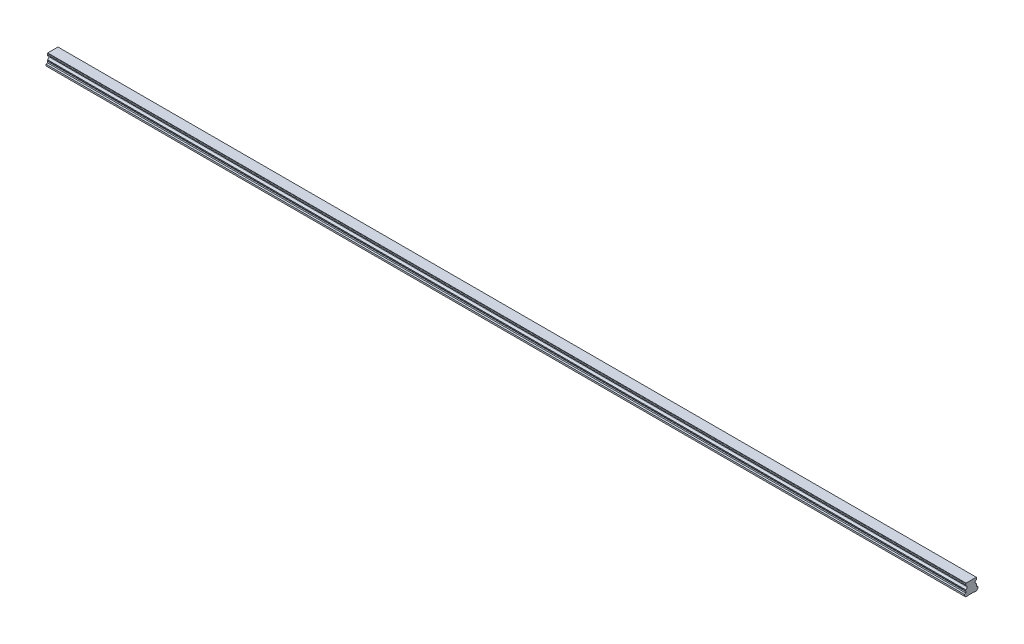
ISO-10303-21;
HEADER;
FILE_DESCRIPTION(('STEP AP214'),'2;1');
FILE_NAME('part.step','',(''),(''),'','','');
FILE_SCHEMA(('AUTOMOTIVE_DESIGN { 1 0 10303 214 1 1 1 1 }'));
ENDSEC;
DATA;
#1=APPLICATION_CONTEXT('core data for automotive mechanical design processes');
#2=APPLICATION_PROTOCOL_DEFINITION('international standard','automotive_design',2000,#1);
#3=PRODUCT_CONTEXT('',#1,'mechanical');
#4=PRODUCT('Part','Part','',(#3));
#5=PRODUCT_RELATED_PRODUCT_CATEGORY('part','',(#4));
#6=PRODUCT_DEFINITION_FORMATION('','',#4);
#7=PRODUCT_DEFINITION_CONTEXT('part definition',#1,'design');
#8=PRODUCT_DEFINITION('design','',#6,#7);
#9=PRODUCT_DEFINITION_SHAPE('','',#8);
#10=(LENGTH_UNIT() NAMED_UNIT(*) SI_UNIT(.MILLI.,.METRE.));
#11=(NAMED_UNIT(*) PLANE_ANGLE_UNIT() SI_UNIT($,.RADIAN.));
#12=(NAMED_UNIT(*) SI_UNIT($,.STERADIAN.) SOLID_ANGLE_UNIT());
#13=UNCERTAINTY_MEASURE_WITH_UNIT(LENGTH_MEASURE(1.E-05),#10,'distance_accuracy_value','');
#14=(GEOMETRIC_REPRESENTATION_CONTEXT(3) GLOBAL_UNCERTAINTY_ASSIGNED_CONTEXT((#13)) GLOBAL_UNIT_ASSIGNED_CONTEXT((#10,
#11,#12)) REPRESENTATION_CONTEXT('',''));
#15=CARTESIAN_POINT('',(0.,0.,0.));
#16=DIRECTION('',(0.,0.,1.));
#17=DIRECTION('',(1.,0.,0.));
#18=AXIS2_PLACEMENT_3D('',#15,#16,#17);
#19=CARTESIAN_POINT('',(1650.,0.499999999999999,0.));
#20=DIRECTION('',(0.,-1.,0.));
#21=DIRECTION('',(0.,0.,-1.));
#22=AXIS2_PLACEMENT_3D('',#19,#20,#21);
#23=CONICAL_SURFACE('',#22,3.5,0.785398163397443);
#24=CARTESIAN_POINT('',(1650.,1.00000000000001,0.));
#25=DIRECTION('',(0.,1.,0.));
#26=DIRECTION('',(0.,0.,1.));
#27=AXIS2_PLACEMENT_3D('',#24,#25,#26);
#28=CIRCLE('',#27,3.);
#29=CARTESIAN_POINT('',(1650.,1.00000000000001,3.));
#30=VERTEX_POINT('',#29);
#31=EDGE_CURVE('E11',#30,#30,#28,.F.);
#32=ORIENTED_EDGE('',*,*,#31,.F.);
#33=EDGE_LOOP('',(#32));
#34=FACE_BOUND('',#33,.T.);
#35=CARTESIAN_POINT('',(1650.,0.499999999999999,0.));
#36=DIRECTION('',(0.,1.,0.));
#37=DIRECTION('',(0.,0.,1.));
#38=AXIS2_PLACEMENT_3D('',#35,#36,#37);
#39=CIRCLE('',#38,3.5);
#40=CARTESIAN_POINT('',(1650.,0.5,3.5));
#41=VERTEX_POINT('',#40);
#42=EDGE_CURVE('E734',#41,#41,#39,.T.);
#43=ORIENTED_EDGE('',*,*,#42,.F.);
#44=EDGE_LOOP('',(#43));
#45=FACE_BOUND('',#44,.T.);
#46=ADVANCED_FACE('F39',(#34,#45),#23,.F.);
#47=CARTESIAN_POINT('',(1650.,12.,0.));
#48=DIRECTION('',(0.,-1.,0.));
#49=DIRECTION('',(0.,0.,-1.));
#50=AXIS2_PLACEMENT_3D('',#47,#48,#49);
#51=CYLINDRICAL_SURFACE('',#50,3.);
#52=ORIENTED_EDGE('',*,*,#31,.T.);
#53=EDGE_LOOP('',(#52));
#54=FACE_BOUND('',#53,.T.);
#55=CARTESIAN_POINT('',(1650.,12.,0.));
#56=DIRECTION('',(0.,-1.,0.));
#57=DIRECTION('',(0.,0.,-1.));
#58=AXIS2_PLACEMENT_3D('',#55,#56,#57);
#59=CIRCLE('',#58,3.);
#60=CARTESIAN_POINT('',(1650.,12.,-3.));
#61=VERTEX_POINT('',#60);
#62=EDGE_CURVE('E49',#61,#61,#59,.T.);
#63=ORIENTED_EDGE('',*,*,#62,.F.);
#64=EDGE_LOOP('',(#63));
#65=FACE_BOUND('',#64,.T.);
#66=ADVANCED_FACE('F1064',(#54,#65),#51,.F.);
#67=CARTESIAN_POINT('',(1650.,12.,0.));
#68=DIRECTION('',(0.,-1.,0.));
#69=DIRECTION('',(0.,0.,-1.));
#70=AXIS2_PLACEMENT_3D('',#67,#68,#69);
#71=PLANE('',#70);
#72=CARTESIAN_POINT('',(1650.,12.,0.));
#73=DIRECTION('',(0.,-1.,0.));
#74=DIRECTION('',(0.,0.,-1.));
#75=AXIS2_PLACEMENT_3D('',#72,#73,#74);
#76=CIRCLE('',#75,2.5);
#77=CARTESIAN_POINT('',(1650.,12.,-2.5));
#78=VERTEX_POINT('',#77);
#79=EDGE_CURVE('E42',#78,#78,#76,.T.);
#80=ORIENTED_EDGE('',*,*,#79,.F.);
#81=EDGE_LOOP('',(#80));
#82=FACE_BOUND('',#81,.T.);
#83=ORIENTED_EDGE('',*,*,#62,.T.);
#84=EDGE_LOOP('',(#83));
#85=FACE_BOUND('',#84,.T.);
#86=ADVANCED_FACE('F1069',(#82,#85),#71,.T.);
#87=CARTESIAN_POINT('',(1590.,0.499999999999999,0.));
#88=DIRECTION('',(0.,-1.,0.));
#89=DIRECTION('',(0.,0.,-1.));
#90=AXIS2_PLACEMENT_3D('',#87,#88,#89);
#91=CONICAL_SURFACE('',#90,3.5,0.785398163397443);
#92=CARTESIAN_POINT('',(1590.,1.00000000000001,0.));
#93=DIRECTION('',(0.,1.,0.));
#94=DIRECTION('',(0.,0.,1.));
#95=AXIS2_PLACEMENT_3D('',#92,#93,#94);
#96=CIRCLE('',#95,3.);
#97=CARTESIAN_POINT('',(1590.,1.00000000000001,3.));
#98=VERTEX_POINT('',#97);
#99=EDGE_CURVE('E730',#98,#98,#96,.F.);
#100=ORIENTED_EDGE('',*,*,#99,.F.);
#101=EDGE_LOOP('',(#100));
#102=FACE_BOUND('',#101,.T.);
#103=CARTESIAN_POINT('',(1590.,0.499999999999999,0.));
#104=DIRECTION('',(0.,1.,0.));
#105=DIRECTION('',(0.,0.,1.));
#106=AXIS2_PLACEMENT_3D('',#103,#104,#105);
#107=CIRCLE('',#106,3.5);
#108=CARTESIAN_POINT('',(1590.,0.5,3.5));
#109=VERTEX_POINT('',#108);
#110=EDGE_CURVE('E722',#109,#109,#107,.T.);
#111=ORIENTED_EDGE('',*,*,#110,.F.);
#112=EDGE_LOOP('',(#111));
#113=FACE_BOUND('',#112,.T.);
#114=ADVANCED_FACE('F1444',(#102,#113),#91,.F.);
#115=CARTESIAN_POINT('',(1590.,12.,0.));
#116=DIRECTION('',(0.,-1.,0.));
#117=DIRECTION('',(0.,0.,-1.));
#118=AXIS2_PLACEMENT_3D('',#115,#116,#117);
#119=CYLINDRICAL_SURFACE('',#118,3.);
#120=ORIENTED_EDGE('',*,*,#99,.T.);
#121=EDGE_LOOP('',(#120));
#122=FACE_BOUND('',#121,.T.);
#123=CARTESIAN_POINT('',(1590.,12.,0.));
#124=DIRECTION('',(0.,-1.,0.));
#125=DIRECTION('',(0.,0.,-1.));
#126=AXIS2_PLACEMENT_3D('',#123,#124,#125);
#127=CIRCLE('',#126,3.);
#128=CARTESIAN_POINT('',(1590.,12.,-3.));
#129=VERTEX_POINT('',#128);
#130=EDGE_CURVE('E726',#129,#129,#127,.T.);
#131=ORIENTED_EDGE('',*,*,#130,.F.);
#132=EDGE_LOOP('',(#131));
#133=FACE_BOUND('',#132,.T.);
#134=ADVANCED_FACE('F1440',(#122,#133),#119,.F.);
#135=CARTESIAN_POINT('',(1590.,12.,0.));
#136=DIRECTION('',(0.,-1.,0.));
#137=DIRECTION('',(0.,0.,-1.));
#138=AXIS2_PLACEMENT_3D('',#135,#136,#137);
#139=PLANE('',#138);
#140=CARTESIAN_POINT('',(1590.,12.,0.));
#141=DIRECTION('',(0.,-1.,0.));
#142=DIRECTION('',(0.,0.,-1.));
#143=AXIS2_PLACEMENT_3D('',#140,#141,#142);
#144=CIRCLE('',#143,2.5);
#145=CARTESIAN_POINT('',(1590.,12.,-2.5));
#146=VERTEX_POINT('',#145);
#147=EDGE_CURVE('E841',#146,#146,#144,.T.);
#148=ORIENTED_EDGE('',*,*,#147,.F.);
#149=EDGE_LOOP('',(#148));
#150=FACE_BOUND('',#149,.T.);
#151=ORIENTED_EDGE('',*,*,#130,.T.);
#152=EDGE_LOOP('',(#151));
#153=FACE_BOUND('',#152,.T.);
#154=ADVANCED_FACE('F1436',(#150,#153),#139,.T.);
#155=CARTESIAN_POINT('',(1530.,0.499999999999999,0.));
#156=DIRECTION('',(0.,-1.,0.));
#157=DIRECTION('',(0.,0.,-1.));
#158=AXIS2_PLACEMENT_3D('',#155,#156,#157);
#159=CONICAL_SURFACE('',#158,3.5,0.785398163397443);
#160=CARTESIAN_POINT('',(1530.,1.00000000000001,0.));
#161=DIRECTION('',(0.,1.,0.));
#162=DIRECTION('',(0.,0.,1.));
#163=AXIS2_PLACEMENT_3D('',#160,#161,#162);
#164=CIRCLE('',#163,3.);
#165=CARTESIAN_POINT('',(1530.,1.00000000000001,3.));
#166=VERTEX_POINT('',#165);
#167=EDGE_CURVE('E718',#166,#166,#164,.F.);
#168=ORIENTED_EDGE('',*,*,#167,.F.);
#169=EDGE_LOOP('',(#168));
#170=FACE_BOUND('',#169,.T.);
#171=CARTESIAN_POINT('',(1530.,0.499999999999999,0.));
#172=DIRECTION('',(0.,1.,0.));
#173=DIRECTION('',(0.,0.,1.));
#174=AXIS2_PLACEMENT_3D('',#171,#172,#173);
#175=CIRCLE('',#174,3.5);
#176=CARTESIAN_POINT('',(1530.,0.5,3.5));
#177=VERTEX_POINT('',#176);
#178=EDGE_CURVE('E710',#177,#177,#175,.T.);
#179=ORIENTED_EDGE('',*,*,#178,.F.);
#180=EDGE_LOOP('',(#179));
#181=FACE_BOUND('',#180,.T.);
#182=ADVANCED_FACE('F1432',(#170,#181),#159,.F.);
#183=CARTESIAN_POINT('',(1530.,12.,0.));
#184=DIRECTION('',(0.,-1.,0.));
#185=DIRECTION('',(0.,0.,-1.));
#186=AXIS2_PLACEMENT_3D('',#183,#184,#185);
#187=CYLINDRICAL_SURFACE('',#186,3.);
#188=ORIENTED_EDGE('',*,*,#167,.T.);
#189=EDGE_LOOP('',(#188));
#190=FACE_BOUND('',#189,.T.);
#191=CARTESIAN_POINT('',(1530.,12.,0.));
#192=DIRECTION('',(0.,-1.,0.));
#193=DIRECTION('',(0.,0.,-1.));
#194=AXIS2_PLACEMENT_3D('',#191,#192,#193);
#195=CIRCLE('',#194,3.);
#196=CARTESIAN_POINT('',(1530.,12.,-3.));
#197=VERTEX_POINT('',#196);
#198=EDGE_CURVE('E714',#197,#197,#195,.T.);
#199=ORIENTED_EDGE('',*,*,#198,.F.);
#200=EDGE_LOOP('',(#199));
#201=FACE_BOUND('',#200,.T.);
#202=ADVANCED_FACE('F1428',(#190,#201),#187,.F.);
#203=CARTESIAN_POINT('',(1530.,12.,0.));
#204=DIRECTION('',(0.,-1.,0.));
#205=DIRECTION('',(0.,0.,-1.));
#206=AXIS2_PLACEMENT_3D('',#203,#204,#205);
#207=PLANE('',#206);
#208=CARTESIAN_POINT('',(1530.,12.,0.));
#209=DIRECTION('',(0.,-1.,0.));
#210=DIRECTION('',(0.,0.,-1.));
#211=AXIS2_PLACEMENT_3D('',#208,#209,#210);
#212=CIRCLE('',#211,2.5);
#213=CARTESIAN_POINT('',(1530.,12.,-2.5));
#214=VERTEX_POINT('',#213);
#215=EDGE_CURVE('E838',#214,#214,#212,.T.);
#216=ORIENTED_EDGE('',*,*,#215,.F.);
#217=EDGE_LOOP('',(#216));
#218=FACE_BOUND('',#217,.T.);
#219=ORIENTED_EDGE('',*,*,#198,.T.);
#220=EDGE_LOOP('',(#219));
#221=FACE_BOUND('',#220,.T.);
#222=ADVANCED_FACE('F1424',(#218,#221),#207,.T.);
#223=CARTESIAN_POINT('',(1470.,0.499999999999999,0.));
#224=DIRECTION('',(0.,-1.,0.));
#225=DIRECTION('',(0.,0.,-1.));
#226=AXIS2_PLACEMENT_3D('',#223,#224,#225);
#227=CONICAL_SURFACE('',#226,3.5,0.785398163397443);
#228=CARTESIAN_POINT('',(1470.,1.00000000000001,0.));
#229=DIRECTION('',(0.,1.,0.));
#230=DIRECTION('',(0.,0.,1.));
#231=AXIS2_PLACEMENT_3D('',#228,#229,#230);
#232=CIRCLE('',#231,3.);
#233=CARTESIAN_POINT('',(1470.,1.00000000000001,3.));
#234=VERTEX_POINT('',#233);
#235=EDGE_CURVE('E706',#234,#234,#232,.F.);
#236=ORIENTED_EDGE('',*,*,#235,.F.);
#237=EDGE_LOOP('',(#236));
#238=FACE_BOUND('',#237,.T.);
#239=CARTESIAN_POINT('',(1470.,0.499999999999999,0.));
#240=DIRECTION('',(0.,1.,0.));
#241=DIRECTION('',(0.,0.,1.));
#242=AXIS2_PLACEMENT_3D('',#239,#240,#241);
#243=CIRCLE('',#242,3.5);
#244=CARTESIAN_POINT('',(1470.,0.5,3.5));
#245=VERTEX_POINT('',#244);
#246=EDGE_CURVE('E698',#245,#245,#243,.T.);
#247=ORIENTED_EDGE('',*,*,#246,.F.);
#248=EDGE_LOOP('',(#247));
#249=FACE_BOUND('',#248,.T.);
#250=ADVANCED_FACE('F1420',(#238,#249),#227,.F.);
#251=CARTESIAN_POINT('',(1470.,12.,0.));
#252=DIRECTION('',(0.,-1.,0.));
#253=DIRECTION('',(0.,0.,-1.));
#254=AXIS2_PLACEMENT_3D('',#251,#252,#253);
#255=CYLINDRICAL_SURFACE('',#254,3.);
#256=ORIENTED_EDGE('',*,*,#235,.T.);
#257=EDGE_LOOP('',(#256));
#258=FACE_BOUND('',#257,.T.);
#259=CARTESIAN_POINT('',(1470.,12.,0.));
#260=DIRECTION('',(0.,-1.,0.));
#261=DIRECTION('',(0.,0.,-1.));
#262=AXIS2_PLACEMENT_3D('',#259,#260,#261);
#263=CIRCLE('',#262,3.);
#264=CARTESIAN_POINT('',(1470.,12.,-3.));
#265=VERTEX_POINT('',#264);
#266=EDGE_CURVE('E702',#265,#265,#263,.T.);
#267=ORIENTED_EDGE('',*,*,#266,.F.);
#268=EDGE_LOOP('',(#267));
#269=FACE_BOUND('',#268,.T.);
#270=ADVANCED_FACE('F1416',(#258,#269),#255,.F.);
#271=CARTESIAN_POINT('',(1470.,12.,0.));
#272=DIRECTION('',(0.,-1.,0.));
#273=DIRECTION('',(0.,0.,-1.));
#274=AXIS2_PLACEMENT_3D('',#271,#272,#273);
#275=PLANE('',#274);
#276=CARTESIAN_POINT('',(1470.,12.,0.));
#277=DIRECTION('',(0.,-1.,0.));
#278=DIRECTION('',(0.,0.,-1.));
#279=AXIS2_PLACEMENT_3D('',#276,#277,#278);
#280=CIRCLE('',#279,2.5);
#281=CARTESIAN_POINT('',(1470.,12.,-2.5));
#282=VERTEX_POINT('',#281);
#283=EDGE_CURVE('E834',#282,#282,#280,.T.);
#284=ORIENTED_EDGE('',*,*,#283,.F.);
#285=EDGE_LOOP('',(#284));
#286=FACE_BOUND('',#285,.T.);
#287=ORIENTED_EDGE('',*,*,#266,.T.);
#288=EDGE_LOOP('',(#287));
#289=FACE_BOUND('',#288,.T.);
#290=ADVANCED_FACE('F1412',(#286,#289),#275,.T.);
#291=CARTESIAN_POINT('',(1410.,0.499999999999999,0.));
#292=DIRECTION('',(0.,-1.,0.));
#293=DIRECTION('',(0.,0.,-1.));
#294=AXIS2_PLACEMENT_3D('',#291,#292,#293);
#295=CONICAL_SURFACE('',#294,3.5,0.785398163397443);
#296=CARTESIAN_POINT('',(1410.,1.00000000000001,0.));
#297=DIRECTION('',(0.,1.,0.));
#298=DIRECTION('',(0.,0.,1.));
#299=AXIS2_PLACEMENT_3D('',#296,#297,#298);
#300=CIRCLE('',#299,3.);
#301=CARTESIAN_POINT('',(1410.,1.00000000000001,3.));
#302=VERTEX_POINT('',#301);
#303=EDGE_CURVE('E694',#302,#302,#300,.F.);
#304=ORIENTED_EDGE('',*,*,#303,.F.);
#305=EDGE_LOOP('',(#304));
#306=FACE_BOUND('',#305,.T.);
#307=CARTESIAN_POINT('',(1410.,0.499999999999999,0.));
#308=DIRECTION('',(0.,1.,0.));
#309=DIRECTION('',(0.,0.,1.));
#310=AXIS2_PLACEMENT_3D('',#307,#308,#309);
#311=CIRCLE('',#310,3.5);
#312=CARTESIAN_POINT('',(1410.,0.5,3.5));
#313=VERTEX_POINT('',#312);
#314=EDGE_CURVE('E686',#313,#313,#311,.T.);
#315=ORIENTED_EDGE('',*,*,#314,.F.);
#316=EDGE_LOOP('',(#315));
#317=FACE_BOUND('',#316,.T.);
#318=ADVANCED_FACE('F1408',(#306,#317),#295,.F.);
#319=CARTESIAN_POINT('',(1410.,12.,0.));
#320=DIRECTION('',(0.,-1.,0.));
#321=DIRECTION('',(0.,0.,-1.));
#322=AXIS2_PLACEMENT_3D('',#319,#320,#321);
#323=CYLINDRICAL_SURFACE('',#322,3.);
#324=ORIENTED_EDGE('',*,*,#303,.T.);
#325=EDGE_LOOP('',(#324));
#326=FACE_BOUND('',#325,.T.);
#327=CARTESIAN_POINT('',(1410.,12.,0.));
#328=DIRECTION('',(0.,-1.,0.));
#329=DIRECTION('',(0.,0.,-1.));
#330=AXIS2_PLACEMENT_3D('',#327,#328,#329);
#331=CIRCLE('',#330,3.);
#332=CARTESIAN_POINT('',(1410.,12.,-3.));
#333=VERTEX_POINT('',#332);
#334=EDGE_CURVE('E690',#333,#333,#331,.T.);
#335=ORIENTED_EDGE('',*,*,#334,.F.);
#336=EDGE_LOOP('',(#335));
#337=FACE_BOUND('',#336,.T.);
#338=ADVANCED_FACE('F1404',(#326,#337),#323,.F.);
#339=CARTESIAN_POINT('',(1410.,12.,0.));
#340=DIRECTION('',(0.,-1.,0.));
#341=DIRECTION('',(0.,0.,-1.));
#342=AXIS2_PLACEMENT_3D('',#339,#340,#341);
#343=PLANE('',#342);
#344=CARTESIAN_POINT('',(1410.,12.,0.));
#345=DIRECTION('',(0.,-1.,0.));
#346=DIRECTION('',(0.,0.,-1.));
#347=AXIS2_PLACEMENT_3D('',#344,#345,#346);
#348=CIRCLE('',#347,2.5);
#349=CARTESIAN_POINT('',(1410.,12.,-2.5));
#350=VERTEX_POINT('',#349);
#351=EDGE_CURVE('E830',#350,#350,#348,.T.);
#352=ORIENTED_EDGE('',*,*,#351,.F.);
#353=EDGE_LOOP('',(#352));
#354=FACE_BOUND('',#353,.T.);
#355=ORIENTED_EDGE('',*,*,#334,.T.);
#356=EDGE_LOOP('',(#355));
#357=FACE_BOUND('',#356,.T.);
#358=ADVANCED_FACE('F1400',(#354,#357),#343,.T.);
#359=CARTESIAN_POINT('',(1350.,0.499999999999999,0.));
#360=DIRECTION('',(0.,-1.,0.));
#361=DIRECTION('',(0.,0.,-1.));
#362=AXIS2_PLACEMENT_3D('',#359,#360,#361);
#363=CONICAL_SURFACE('',#362,3.5,0.785398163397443);
#364=CARTESIAN_POINT('',(1350.,1.00000000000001,0.));
#365=DIRECTION('',(0.,1.,0.));
#366=DIRECTION('',(0.,0.,1.));
#367=AXIS2_PLACEMENT_3D('',#364,#365,#366);
#368=CIRCLE('',#367,3.);
#369=CARTESIAN_POINT('',(1350.,1.00000000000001,3.));
#370=VERTEX_POINT('',#369);
#371=EDGE_CURVE('E682',#370,#370,#368,.F.);
#372=ORIENTED_EDGE('',*,*,#371,.F.);
#373=EDGE_LOOP('',(#372));
#374=FACE_BOUND('',#373,.T.);
#375=CARTESIAN_POINT('',(1350.,0.499999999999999,0.));
#376=DIRECTION('',(0.,1.,0.));
#377=DIRECTION('',(0.,0.,1.));
#378=AXIS2_PLACEMENT_3D('',#375,#376,#377);
#379=CIRCLE('',#378,3.5);
#380=CARTESIAN_POINT('',(1350.,0.5,3.5));
#381=VERTEX_POINT('',#380);
#382=EDGE_CURVE('E674',#381,#381,#379,.T.);
#383=ORIENTED_EDGE('',*,*,#382,.F.);
#384=EDGE_LOOP('',(#383));
#385=FACE_BOUND('',#384,.T.);
#386=ADVANCED_FACE('F1396',(#374,#385),#363,.F.);
#387=CARTESIAN_POINT('',(1350.,12.,0.));
#388=DIRECTION('',(0.,-1.,0.));
#389=DIRECTION('',(0.,0.,-1.));
#390=AXIS2_PLACEMENT_3D('',#387,#388,#389);
#391=CYLINDRICAL_SURFACE('',#390,3.);
#392=ORIENTED_EDGE('',*,*,#371,.T.);
#393=EDGE_LOOP('',(#392));
#394=FACE_BOUND('',#393,.T.);
#395=CARTESIAN_POINT('',(1350.,12.,0.));
#396=DIRECTION('',(0.,-1.,0.));
#397=DIRECTION('',(0.,0.,-1.));
#398=AXIS2_PLACEMENT_3D('',#395,#396,#397);
#399=CIRCLE('',#398,3.);
#400=CARTESIAN_POINT('',(1350.,12.,-3.));
#401=VERTEX_POINT('',#400);
#402=EDGE_CURVE('E678',#401,#401,#399,.T.);
#403=ORIENTED_EDGE('',*,*,#402,.F.);
#404=EDGE_LOOP('',(#403));
#405=FACE_BOUND('',#404,.T.);
#406=ADVANCED_FACE('F1392',(#394,#405),#391,.F.);
#407=CARTESIAN_POINT('',(1350.,12.,0.));
#408=DIRECTION('',(0.,-1.,0.));
#409=DIRECTION('',(0.,0.,-1.));
#410=AXIS2_PLACEMENT_3D('',#407,#408,#409);
#411=PLANE('',#410);
#412=CARTESIAN_POINT('',(1350.,12.,0.));
#413=DIRECTION('',(0.,-1.,0.));
#414=DIRECTION('',(0.,0.,-1.));
#415=AXIS2_PLACEMENT_3D('',#412,#413,#414);
#416=CIRCLE('',#415,2.5);
#417=CARTESIAN_POINT('',(1350.,12.,-2.5));
#418=VERTEX_POINT('',#417);
#419=EDGE_CURVE('E826',#418,#418,#416,.T.);
#420=ORIENTED_EDGE('',*,*,#419,.F.);
#421=EDGE_LOOP('',(#420));
#422=FACE_BOUND('',#421,.T.);
#423=ORIENTED_EDGE('',*,*,#402,.T.);
#424=EDGE_LOOP('',(#423));
#425=FACE_BOUND('',#424,.T.);
#426=ADVANCED_FACE('F1388',(#422,#425),#411,.T.);
#427=CARTESIAN_POINT('',(1290.,0.499999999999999,0.));
#428=DIRECTION('',(0.,-1.,0.));
#429=DIRECTION('',(0.,0.,-1.));
#430=AXIS2_PLACEMENT_3D('',#427,#428,#429);
#431=CONICAL_SURFACE('',#430,3.5,0.785398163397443);
#432=CARTESIAN_POINT('',(1290.,1.00000000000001,0.));
#433=DIRECTION('',(0.,1.,0.));
#434=DIRECTION('',(0.,0.,1.));
#435=AXIS2_PLACEMENT_3D('',#432,#433,#434);
#436=CIRCLE('',#435,3.);
#437=CARTESIAN_POINT('',(1290.,1.00000000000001,3.));
#438=VERTEX_POINT('',#437);
#439=EDGE_CURVE('E670',#438,#438,#436,.F.);
#440=ORIENTED_EDGE('',*,*,#439,.F.);
#441=EDGE_LOOP('',(#440));
#442=FACE_BOUND('',#441,.T.);
#443=CARTESIAN_POINT('',(1290.,0.499999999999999,0.));
#444=DIRECTION('',(0.,1.,0.));
#445=DIRECTION('',(0.,0.,1.));
#446=AXIS2_PLACEMENT_3D('',#443,#444,#445);
#447=CIRCLE('',#446,3.5);
#448=CARTESIAN_POINT('',(1290.,0.5,3.5));
#449=VERTEX_POINT('',#448);
#450=EDGE_CURVE('E662',#449,#449,#447,.T.);
#451=ORIENTED_EDGE('',*,*,#450,.F.);
#452=EDGE_LOOP('',(#451));
#453=FACE_BOUND('',#452,.T.);
#454=ADVANCED_FACE('F1384',(#442,#453),#431,.F.);
#455=CARTESIAN_POINT('',(1290.,12.,0.));
#456=DIRECTION('',(0.,-1.,0.));
#457=DIRECTION('',(0.,0.,-1.));
#458=AXIS2_PLACEMENT_3D('',#455,#456,#457);
#459=CYLINDRICAL_SURFACE('',#458,3.);
#460=ORIENTED_EDGE('',*,*,#439,.T.);
#461=EDGE_LOOP('',(#460));
#462=FACE_BOUND('',#461,.T.);
#463=CARTESIAN_POINT('',(1290.,12.,0.));
#464=DIRECTION('',(0.,-1.,0.));
#465=DIRECTION('',(0.,0.,-1.));
#466=AXIS2_PLACEMENT_3D('',#463,#464,#465);
#467=CIRCLE('',#466,3.);
#468=CARTESIAN_POINT('',(1290.,12.,-3.));
#469=VERTEX_POINT('',#468);
#470=EDGE_CURVE('E666',#469,#469,#467,.T.);
#471=ORIENTED_EDGE('',*,*,#470,.F.);
#472=EDGE_LOOP('',(#471));
#473=FACE_BOUND('',#472,.T.);
#474=ADVANCED_FACE('F1380',(#462,#473),#459,.F.);
#475=CARTESIAN_POINT('',(1290.,12.,0.));
#476=DIRECTION('',(0.,-1.,0.));
#477=DIRECTION('',(0.,0.,-1.));
#478=AXIS2_PLACEMENT_3D('',#475,#476,#477);
#479=PLANE('',#478);
#480=CARTESIAN_POINT('',(1290.,12.,0.));
#481=DIRECTION('',(0.,-1.,0.));
#482=DIRECTION('',(0.,0.,-1.));
#483=AXIS2_PLACEMENT_3D('',#480,#481,#482);
#484=CIRCLE('',#483,2.5);
#485=CARTESIAN_POINT('',(1290.,12.,-2.5));
#486=VERTEX_POINT('',#485);
#487=EDGE_CURVE('E822',#486,#486,#484,.T.);
#488=ORIENTED_EDGE('',*,*,#487,.F.);
#489=EDGE_LOOP('',(#488));
#490=FACE_BOUND('',#489,.T.);
#491=ORIENTED_EDGE('',*,*,#470,.T.);
#492=EDGE_LOOP('',(#491));
#493=FACE_BOUND('',#492,.T.);
#494=ADVANCED_FACE('F1376',(#490,#493),#479,.T.);
#495=CARTESIAN_POINT('',(1230.,0.499999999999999,0.));
#496=DIRECTION('',(0.,-1.,0.));
#497=DIRECTION('',(0.,0.,-1.));
#498=AXIS2_PLACEMENT_3D('',#495,#496,#497);
#499=CONICAL_SURFACE('',#498,3.5,0.785398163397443);
#500=CARTESIAN_POINT('',(1230.,1.00000000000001,0.));
#501=DIRECTION('',(0.,1.,0.));
#502=DIRECTION('',(0.,0.,1.));
#503=AXIS2_PLACEMENT_3D('',#500,#501,#502);
#504=CIRCLE('',#503,3.);
#505=CARTESIAN_POINT('',(1230.,1.00000000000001,3.));
#506=VERTEX_POINT('',#505);
#507=EDGE_CURVE('E658',#506,#506,#504,.F.);
#508=ORIENTED_EDGE('',*,*,#507,.F.);
#509=EDGE_LOOP('',(#508));
#510=FACE_BOUND('',#509,.T.);
#511=CARTESIAN_POINT('',(1230.,0.499999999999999,0.));
#512=DIRECTION('',(0.,1.,0.));
#513=DIRECTION('',(0.,0.,1.));
#514=AXIS2_PLACEMENT_3D('',#511,#512,#513);
#515=CIRCLE('',#514,3.5);
#516=CARTESIAN_POINT('',(1230.,0.5,3.5));
#517=VERTEX_POINT('',#516);
#518=EDGE_CURVE('E650',#517,#517,#515,.T.);
#519=ORIENTED_EDGE('',*,*,#518,.F.);
#520=EDGE_LOOP('',(#519));
#521=FACE_BOUND('',#520,.T.);
#522=ADVANCED_FACE('F1372',(#510,#521),#499,.F.);
#523=CARTESIAN_POINT('',(1230.,12.,0.));
#524=DIRECTION('',(0.,-1.,0.));
#525=DIRECTION('',(0.,0.,-1.));
#526=AXIS2_PLACEMENT_3D('',#523,#524,#525);
#527=CYLINDRICAL_SURFACE('',#526,3.);
#528=ORIENTED_EDGE('',*,*,#507,.T.);
#529=EDGE_LOOP('',(#528));
#530=FACE_BOUND('',#529,.T.);
#531=CARTESIAN_POINT('',(1230.,12.,0.));
#532=DIRECTION('',(0.,-1.,0.));
#533=DIRECTION('',(0.,0.,-1.));
#534=AXIS2_PLACEMENT_3D('',#531,#532,#533);
#535=CIRCLE('',#534,3.);
#536=CARTESIAN_POINT('',(1230.,12.,-3.));
#537=VERTEX_POINT('',#536);
#538=EDGE_CURVE('E654',#537,#537,#535,.T.);
#539=ORIENTED_EDGE('',*,*,#538,.F.);
#540=EDGE_LOOP('',(#539));
#541=FACE_BOUND('',#540,.T.);
#542=ADVANCED_FACE('F1368',(#530,#541),#527,.F.);
#543=CARTESIAN_POINT('',(1230.,12.,0.));
#544=DIRECTION('',(0.,-1.,0.));
#545=DIRECTION('',(0.,0.,-1.));
#546=AXIS2_PLACEMENT_3D('',#543,#544,#545);
#547=PLANE('',#546);
#548=CARTESIAN_POINT('',(1230.,12.,0.));
#549=DIRECTION('',(0.,-1.,0.));
#550=DIRECTION('',(0.,0.,-1.));
#551=AXIS2_PLACEMENT_3D('',#548,#549,#550);
#552=CIRCLE('',#551,2.5);
#553=CARTESIAN_POINT('',(1230.,12.,-2.5));
#554=VERTEX_POINT('',#553);
#555=EDGE_CURVE('E818',#554,#554,#552,.T.);
#556=ORIENTED_EDGE('',*,*,#555,.F.);
#557=EDGE_LOOP('',(#556));
#558=FACE_BOUND('',#557,.T.);
#559=ORIENTED_EDGE('',*,*,#538,.T.);
#560=EDGE_LOOP('',(#559));
#561=FACE_BOUND('',#560,.T.);
#562=ADVANCED_FACE('F1364',(#558,#561),#547,.T.);
#563=CARTESIAN_POINT('',(1170.,0.499999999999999,0.));
#564=DIRECTION('',(0.,-1.,0.));
#565=DIRECTION('',(0.,0.,-1.));
#566=AXIS2_PLACEMENT_3D('',#563,#564,#565);
#567=CONICAL_SURFACE('',#566,3.5,0.785398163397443);
#568=CARTESIAN_POINT('',(1170.,1.00000000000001,0.));
#569=DIRECTION('',(0.,1.,0.));
#570=DIRECTION('',(0.,0.,1.));
#571=AXIS2_PLACEMENT_3D('',#568,#569,#570);
#572=CIRCLE('',#571,3.);
#573=CARTESIAN_POINT('',(1170.,1.00000000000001,3.));
#574=VERTEX_POINT('',#573);
#575=EDGE_CURVE('E646',#574,#574,#572,.F.);
#576=ORIENTED_EDGE('',*,*,#575,.F.);
#577=EDGE_LOOP('',(#576));
#578=FACE_BOUND('',#577,.T.);
#579=CARTESIAN_POINT('',(1170.,0.499999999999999,0.));
#580=DIRECTION('',(0.,1.,0.));
#581=DIRECTION('',(0.,0.,1.));
#582=AXIS2_PLACEMENT_3D('',#579,#580,#581);
#583=CIRCLE('',#582,3.5);
#584=CARTESIAN_POINT('',(1170.,0.5,3.5));
#585=VERTEX_POINT('',#584);
#586=EDGE_CURVE('E638',#585,#585,#583,.T.);
#587=ORIENTED_EDGE('',*,*,#586,.F.);
#588=EDGE_LOOP('',(#587));
#589=FACE_BOUND('',#588,.T.);
#590=ADVANCED_FACE('F1360',(#578,#589),#567,.F.);
#591=CARTESIAN_POINT('',(1170.,12.,0.));
#592=DIRECTION('',(0.,-1.,0.));
#593=DIRECTION('',(0.,0.,-1.));
#594=AXIS2_PLACEMENT_3D('',#591,#592,#593);
#595=CYLINDRICAL_SURFACE('',#594,3.);
#596=ORIENTED_EDGE('',*,*,#575,.T.);
#597=EDGE_LOOP('',(#596));
#598=FACE_BOUND('',#597,.T.);
#599=CARTESIAN_POINT('',(1170.,12.,0.));
#600=DIRECTION('',(0.,-1.,0.));
#601=DIRECTION('',(0.,0.,-1.));
#602=AXIS2_PLACEMENT_3D('',#599,#600,#601);
#603=CIRCLE('',#602,3.);
#604=CARTESIAN_POINT('',(1170.,12.,-3.));
#605=VERTEX_POINT('',#604);
#606=EDGE_CURVE('E642',#605,#605,#603,.T.);
#607=ORIENTED_EDGE('',*,*,#606,.F.);
#608=EDGE_LOOP('',(#607));
#609=FACE_BOUND('',#608,.T.);
#610=ADVANCED_FACE('F1356',(#598,#609),#595,.F.);
#611=CARTESIAN_POINT('',(1170.,12.,0.));
#612=DIRECTION('',(0.,-1.,0.));
#613=DIRECTION('',(0.,0.,-1.));
#614=AXIS2_PLACEMENT_3D('',#611,#612,#613);
#615=PLANE('',#614);
#616=CARTESIAN_POINT('',(1170.,12.,0.));
#617=DIRECTION('',(0.,-1.,0.));
#618=DIRECTION('',(0.,0.,-1.));
#619=AXIS2_PLACEMENT_3D('',#616,#617,#618);
#620=CIRCLE('',#619,2.5);
#621=CARTESIAN_POINT('',(1170.,12.,-2.5));
#622=VERTEX_POINT('',#621);
#623=EDGE_CURVE('E814',#622,#622,#620,.T.);
#624=ORIENTED_EDGE('',*,*,#623,.F.);
#625=EDGE_LOOP('',(#624));
#626=FACE_BOUND('',#625,.T.);
#627=ORIENTED_EDGE('',*,*,#606,.T.);
#628=EDGE_LOOP('',(#627));
#629=FACE_BOUND('',#628,.T.);
#630=ADVANCED_FACE('F1352',(#626,#629),#615,.T.);
#631=CARTESIAN_POINT('',(1110.,0.499999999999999,0.));
#632=DIRECTION('',(0.,-1.,0.));
#633=DIRECTION('',(0.,0.,-1.));
#634=AXIS2_PLACEMENT_3D('',#631,#632,#633);
#635=CONICAL_SURFACE('',#634,3.5,0.785398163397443);
#636=CARTESIAN_POINT('',(1110.,1.00000000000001,0.));
#637=DIRECTION('',(0.,1.,0.));
#638=DIRECTION('',(0.,0.,1.));
#639=AXIS2_PLACEMENT_3D('',#636,#637,#638);
#640=CIRCLE('',#639,3.);
#641=CARTESIAN_POINT('',(1110.,1.00000000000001,3.));
#642=VERTEX_POINT('',#641);
#643=EDGE_CURVE('E634',#642,#642,#640,.F.);
#644=ORIENTED_EDGE('',*,*,#643,.F.);
#645=EDGE_LOOP('',(#644));
#646=FACE_BOUND('',#645,.T.);
#647=CARTESIAN_POINT('',(1110.,0.499999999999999,0.));
#648=DIRECTION('',(0.,1.,0.));
#649=DIRECTION('',(0.,0.,1.));
#650=AXIS2_PLACEMENT_3D('',#647,#648,#649);
#651=CIRCLE('',#650,3.5);
#652=CARTESIAN_POINT('',(1110.,0.5,3.5));
#653=VERTEX_POINT('',#652);
#654=EDGE_CURVE('E626',#653,#653,#651,.T.);
#655=ORIENTED_EDGE('',*,*,#654,.F.);
#656=EDGE_LOOP('',(#655));
#657=FACE_BOUND('',#656,.T.);
#658=ADVANCED_FACE('F1348',(#646,#657),#635,.F.);
#659=CARTESIAN_POINT('',(1110.,12.,0.));
#660=DIRECTION('',(0.,-1.,0.));
#661=DIRECTION('',(0.,0.,-1.));
#662=AXIS2_PLACEMENT_3D('',#659,#660,#661);
#663=CYLINDRICAL_SURFACE('',#662,3.);
#664=ORIENTED_EDGE('',*,*,#643,.T.);
#665=EDGE_LOOP('',(#664));
#666=FACE_BOUND('',#665,.T.);
#667=CARTESIAN_POINT('',(1110.,12.,0.));
#668=DIRECTION('',(0.,-1.,0.));
#669=DIRECTION('',(0.,0.,-1.));
#670=AXIS2_PLACEMENT_3D('',#667,#668,#669);
#671=CIRCLE('',#670,3.);
#672=CARTESIAN_POINT('',(1110.,12.,-3.));
#673=VERTEX_POINT('',#672);
#674=EDGE_CURVE('E630',#673,#673,#671,.T.);
#675=ORIENTED_EDGE('',*,*,#674,.F.);
#676=EDGE_LOOP('',(#675));
#677=FACE_BOUND('',#676,.T.);
#678=ADVANCED_FACE('F1344',(#666,#677),#663,.F.);
#679=CARTESIAN_POINT('',(1110.,12.,0.));
#680=DIRECTION('',(0.,-1.,0.));
#681=DIRECTION('',(0.,0.,-1.));
#682=AXIS2_PLACEMENT_3D('',#679,#680,#681);
#683=PLANE('',#682);
#684=CARTESIAN_POINT('',(1110.,12.,0.));
#685=DIRECTION('',(0.,-1.,0.));
#686=DIRECTION('',(0.,0.,-1.));
#687=AXIS2_PLACEMENT_3D('',#684,#685,#686);
#688=CIRCLE('',#687,2.5);
#689=CARTESIAN_POINT('',(1110.,12.,-2.5));
#690=VERTEX_POINT('',#689);
#691=EDGE_CURVE('E810',#690,#690,#688,.T.);
#692=ORIENTED_EDGE('',*,*,#691,.F.);
#693=EDGE_LOOP('',(#692));
#694=FACE_BOUND('',#693,.T.);
#695=ORIENTED_EDGE('',*,*,#674,.T.);
#696=EDGE_LOOP('',(#695));
#697=FACE_BOUND('',#696,.T.);
#698=ADVANCED_FACE('F1340',(#694,#697),#683,.T.);
#699=CARTESIAN_POINT('',(1050.,0.499999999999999,0.));
#700=DIRECTION('',(0.,-1.,0.));
#701=DIRECTION('',(0.,0.,-1.));
#702=AXIS2_PLACEMENT_3D('',#699,#700,#701);
#703=CONICAL_SURFACE('',#702,3.5,0.785398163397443);
#704=CARTESIAN_POINT('',(1050.,1.00000000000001,0.));
#705=DIRECTION('',(0.,1.,0.));
#706=DIRECTION('',(0.,0.,1.));
#707=AXIS2_PLACEMENT_3D('',#704,#705,#706);
#708=CIRCLE('',#707,3.);
#709=CARTESIAN_POINT('',(1050.,1.00000000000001,3.));
#710=VERTEX_POINT('',#709);
#711=EDGE_CURVE('E622',#710,#710,#708,.F.);
#712=ORIENTED_EDGE('',*,*,#711,.F.);
#713=EDGE_LOOP('',(#712));
#714=FACE_BOUND('',#713,.T.);
#715=CARTESIAN_POINT('',(1050.,0.499999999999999,0.));
#716=DIRECTION('',(0.,1.,0.));
#717=DIRECTION('',(0.,0.,1.));
#718=AXIS2_PLACEMENT_3D('',#715,#716,#717);
#719=CIRCLE('',#718,3.5);
#720=CARTESIAN_POINT('',(1050.,0.5,3.5));
#721=VERTEX_POINT('',#720);
#722=EDGE_CURVE('E614',#721,#721,#719,.T.);
#723=ORIENTED_EDGE('',*,*,#722,.F.);
#724=EDGE_LOOP('',(#723));
#725=FACE_BOUND('',#724,.T.);
#726=ADVANCED_FACE('F1336',(#714,#725),#703,.F.);
#727=CARTESIAN_POINT('',(1050.,12.,0.));
#728=DIRECTION('',(0.,-1.,0.));
#729=DIRECTION('',(0.,0.,-1.));
#730=AXIS2_PLACEMENT_3D('',#727,#728,#729);
#731=CYLINDRICAL_SURFACE('',#730,3.);
#732=ORIENTED_EDGE('',*,*,#711,.T.);
#733=EDGE_LOOP('',(#732));
#734=FACE_BOUND('',#733,.T.);
#735=CARTESIAN_POINT('',(1050.,12.,0.));
#736=DIRECTION('',(0.,-1.,0.));
#737=DIRECTION('',(0.,0.,-1.));
#738=AXIS2_PLACEMENT_3D('',#735,#736,#737);
#739=CIRCLE('',#738,3.);
#740=CARTESIAN_POINT('',(1050.,12.,-3.));
#741=VERTEX_POINT('',#740);
#742=EDGE_CURVE('E618',#741,#741,#739,.T.);
#743=ORIENTED_EDGE('',*,*,#742,.F.);
#744=EDGE_LOOP('',(#743));
#745=FACE_BOUND('',#744,.T.);
#746=ADVANCED_FACE('F1332',(#734,#745),#731,.F.);
#747=CARTESIAN_POINT('',(1050.,12.,0.));
#748=DIRECTION('',(0.,-1.,0.));
#749=DIRECTION('',(0.,0.,-1.));
#750=AXIS2_PLACEMENT_3D('',#747,#748,#749);
#751=PLANE('',#750);
#752=CARTESIAN_POINT('',(1050.,12.,0.));
#753=DIRECTION('',(0.,-1.,0.));
#754=DIRECTION('',(0.,0.,-1.));
#755=AXIS2_PLACEMENT_3D('',#752,#753,#754);
#756=CIRCLE('',#755,2.5);
#757=CARTESIAN_POINT('',(1050.,12.,-2.5));
#758=VERTEX_POINT('',#757);
#759=EDGE_CURVE('E806',#758,#758,#756,.T.);
#760=ORIENTED_EDGE('',*,*,#759,.F.);
#761=EDGE_LOOP('',(#760));
#762=FACE_BOUND('',#761,.T.);
#763=ORIENTED_EDGE('',*,*,#742,.T.);
#764=EDGE_LOOP('',(#763));
#765=FACE_BOUND('',#764,.T.);
#766=ADVANCED_FACE('F1328',(#762,#765),#751,.T.);
#767=CARTESIAN_POINT('',(990.,0.499999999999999,0.));
#768=DIRECTION('',(0.,-1.,0.));
#769=DIRECTION('',(0.,0.,-1.));
#770=AXIS2_PLACEMENT_3D('',#767,#768,#769);
#771=CONICAL_SURFACE('',#770,3.5,0.785398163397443);
#772=CARTESIAN_POINT('',(990.,1.00000000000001,0.));
#773=DIRECTION('',(0.,1.,0.));
#774=DIRECTION('',(0.,0.,1.));
#775=AXIS2_PLACEMENT_3D('',#772,#773,#774);
#776=CIRCLE('',#775,3.);
#777=CARTESIAN_POINT('',(990.,1.00000000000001,3.));
#778=VERTEX_POINT('',#777);
#779=EDGE_CURVE('E610',#778,#778,#776,.F.);
#780=ORIENTED_EDGE('',*,*,#779,.F.);
#781=EDGE_LOOP('',(#780));
#782=FACE_BOUND('',#781,.T.);
#783=CARTESIAN_POINT('',(990.,0.499999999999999,0.));
#784=DIRECTION('',(0.,1.,0.));
#785=DIRECTION('',(0.,0.,1.));
#786=AXIS2_PLACEMENT_3D('',#783,#784,#785);
#787=CIRCLE('',#786,3.5);
#788=CARTESIAN_POINT('',(990.,0.5,3.5));
#789=VERTEX_POINT('',#788);
#790=EDGE_CURVE('E602',#789,#789,#787,.T.);
#791=ORIENTED_EDGE('',*,*,#790,.F.);
#792=EDGE_LOOP('',(#791));
#793=FACE_BOUND('',#792,.T.);
#794=ADVANCED_FACE('F1324',(#782,#793),#771,.F.);
#795=CARTESIAN_POINT('',(990.,12.,0.));
#796=DIRECTION('',(0.,-1.,0.));
#797=DIRECTION('',(0.,0.,-1.));
#798=AXIS2_PLACEMENT_3D('',#795,#796,#797);
#799=CYLINDRICAL_SURFACE('',#798,3.);
#800=ORIENTED_EDGE('',*,*,#779,.T.);
#801=EDGE_LOOP('',(#800));
#802=FACE_BOUND('',#801,.T.);
#803=CARTESIAN_POINT('',(990.,12.,0.));
#804=DIRECTION('',(0.,-1.,0.));
#805=DIRECTION('',(0.,0.,-1.));
#806=AXIS2_PLACEMENT_3D('',#803,#804,#805);
#807=CIRCLE('',#806,3.);
#808=CARTESIAN_POINT('',(990.,12.,-3.));
#809=VERTEX_POINT('',#808);
#810=EDGE_CURVE('E606',#809,#809,#807,.T.);
#811=ORIENTED_EDGE('',*,*,#810,.F.);
#812=EDGE_LOOP('',(#811));
#813=FACE_BOUND('',#812,.T.);
#814=ADVANCED_FACE('F1320',(#802,#813),#799,.F.);
#815=CARTESIAN_POINT('',(990.,12.,0.));
#816=DIRECTION('',(0.,-1.,0.));
#817=DIRECTION('',(0.,0.,-1.));
#818=AXIS2_PLACEMENT_3D('',#815,#816,#817);
#819=PLANE('',#818);
#820=CARTESIAN_POINT('',(990.,12.,0.));
#821=DIRECTION('',(0.,-1.,0.));
#822=DIRECTION('',(0.,0.,-1.));
#823=AXIS2_PLACEMENT_3D('',#820,#821,#822);
#824=CIRCLE('',#823,2.5);
#825=CARTESIAN_POINT('',(990.,12.,-2.5));
#826=VERTEX_POINT('',#825);
#827=EDGE_CURVE('E802',#826,#826,#824,.T.);
#828=ORIENTED_EDGE('',*,*,#827,.F.);
#829=EDGE_LOOP('',(#828));
#830=FACE_BOUND('',#829,.T.);
#831=ORIENTED_EDGE('',*,*,#810,.T.);
#832=EDGE_LOOP('',(#831));
#833=FACE_BOUND('',#832,.T.);
#834=ADVANCED_FACE('F1316',(#830,#833),#819,.T.);
#835=CARTESIAN_POINT('',(930.,0.499999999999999,0.));
#836=DIRECTION('',(0.,-1.,0.));
#837=DIRECTION('',(0.,0.,-1.));
#838=AXIS2_PLACEMENT_3D('',#835,#836,#837);
#839=CONICAL_SURFACE('',#838,3.5,0.785398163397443);
#840=CARTESIAN_POINT('',(930.,1.00000000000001,0.));
#841=DIRECTION('',(0.,1.,0.));
#842=DIRECTION('',(0.,0.,1.));
#843=AXIS2_PLACEMENT_3D('',#840,#841,#842);
#844=CIRCLE('',#843,3.);
#845=CARTESIAN_POINT('',(930.,1.00000000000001,3.));
#846=VERTEX_POINT('',#845);
#847=EDGE_CURVE('E598',#846,#846,#844,.F.);
#848=ORIENTED_EDGE('',*,*,#847,.F.);
#849=EDGE_LOOP('',(#848));
#850=FACE_BOUND('',#849,.T.);
#851=CARTESIAN_POINT('',(930.,0.499999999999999,0.));
#852=DIRECTION('',(0.,1.,0.));
#853=DIRECTION('',(0.,0.,1.));
#854=AXIS2_PLACEMENT_3D('',#851,#852,#853);
#855=CIRCLE('',#854,3.5);
#856=CARTESIAN_POINT('',(930.,0.5,3.5));
#857=VERTEX_POINT('',#856);
#858=EDGE_CURVE('E590',#857,#857,#855,.T.);
#859=ORIENTED_EDGE('',*,*,#858,.F.);
#860=EDGE_LOOP('',(#859));
#861=FACE_BOUND('',#860,.T.);
#862=ADVANCED_FACE('F1312',(#850,#861),#839,.F.);
#863=CARTESIAN_POINT('',(930.,12.,0.));
#864=DIRECTION('',(0.,-1.,0.));
#865=DIRECTION('',(0.,0.,-1.));
#866=AXIS2_PLACEMENT_3D('',#863,#864,#865);
#867=CYLINDRICAL_SURFACE('',#866,3.);
#868=ORIENTED_EDGE('',*,*,#847,.T.);
#869=EDGE_LOOP('',(#868));
#870=FACE_BOUND('',#869,.T.);
#871=CARTESIAN_POINT('',(930.,12.,0.));
#872=DIRECTION('',(0.,-1.,0.));
#873=DIRECTION('',(0.,0.,-1.));
#874=AXIS2_PLACEMENT_3D('',#871,#872,#873);
#875=CIRCLE('',#874,3.);
#876=CARTESIAN_POINT('',(930.,12.,-3.));
#877=VERTEX_POINT('',#876);
#878=EDGE_CURVE('E594',#877,#877,#875,.T.);
#879=ORIENTED_EDGE('',*,*,#878,.F.);
#880=EDGE_LOOP('',(#879));
#881=FACE_BOUND('',#880,.T.);
#882=ADVANCED_FACE('F1308',(#870,#881),#867,.F.);
#883=CARTESIAN_POINT('',(930.,12.,0.));
#884=DIRECTION('',(0.,-1.,0.));
#885=DIRECTION('',(0.,0.,-1.));
#886=AXIS2_PLACEMENT_3D('',#883,#884,#885);
#887=PLANE('',#886);
#888=CARTESIAN_POINT('',(930.,12.,0.));
#889=DIRECTION('',(0.,-1.,0.));
#890=DIRECTION('',(0.,0.,-1.));
#891=AXIS2_PLACEMENT_3D('',#888,#889,#890);
#892=CIRCLE('',#891,2.5);
#893=CARTESIAN_POINT('',(930.,12.,-2.5));
#894=VERTEX_POINT('',#893);
#895=EDGE_CURVE('E798',#894,#894,#892,.T.);
#896=ORIENTED_EDGE('',*,*,#895,.F.);
#897=EDGE_LOOP('',(#896));
#898=FACE_BOUND('',#897,.T.);
#899=ORIENTED_EDGE('',*,*,#878,.T.);
#900=EDGE_LOOP('',(#899));
#901=FACE_BOUND('',#900,.T.);
#902=ADVANCED_FACE('F1304',(#898,#901),#887,.T.);
#903=CARTESIAN_POINT('',(870.,0.499999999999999,0.));
#904=DIRECTION('',(0.,-1.,0.));
#905=DIRECTION('',(0.,0.,-1.));
#906=AXIS2_PLACEMENT_3D('',#903,#904,#905);
#907=CONICAL_SURFACE('',#906,3.5,0.785398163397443);
#908=CARTESIAN_POINT('',(870.,1.00000000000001,0.));
#909=DIRECTION('',(0.,1.,0.));
#910=DIRECTION('',(0.,0.,1.));
#911=AXIS2_PLACEMENT_3D('',#908,#909,#910);
#912=CIRCLE('',#911,3.);
#913=CARTESIAN_POINT('',(870.,1.00000000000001,3.));
#914=VERTEX_POINT('',#913);
#915=EDGE_CURVE('E586',#914,#914,#912,.F.);
#916=ORIENTED_EDGE('',*,*,#915,.F.);
#917=EDGE_LOOP('',(#916));
#918=FACE_BOUND('',#917,.T.);
#919=CARTESIAN_POINT('',(870.,0.499999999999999,0.));
#920=DIRECTION('',(0.,1.,0.));
#921=DIRECTION('',(0.,0.,1.));
#922=AXIS2_PLACEMENT_3D('',#919,#920,#921);
#923=CIRCLE('',#922,3.5);
#924=CARTESIAN_POINT('',(870.,0.5,3.5));
#925=VERTEX_POINT('',#924);
#926=EDGE_CURVE('E578',#925,#925,#923,.T.);
#927=ORIENTED_EDGE('',*,*,#926,.F.);
#928=EDGE_LOOP('',(#927));
#929=FACE_BOUND('',#928,.T.);
#930=ADVANCED_FACE('F1300',(#918,#929),#907,.F.);
#931=CARTESIAN_POINT('',(870.,12.,0.));
#932=DIRECTION('',(0.,-1.,0.));
#933=DIRECTION('',(0.,0.,-1.));
#934=AXIS2_PLACEMENT_3D('',#931,#932,#933);
#935=CYLINDRICAL_SURFACE('',#934,3.);
#936=ORIENTED_EDGE('',*,*,#915,.T.);
#937=EDGE_LOOP('',(#936));
#938=FACE_BOUND('',#937,.T.);
#939=CARTESIAN_POINT('',(870.,12.,0.));
#940=DIRECTION('',(0.,-1.,0.));
#941=DIRECTION('',(0.,0.,-1.));
#942=AXIS2_PLACEMENT_3D('',#939,#940,#941);
#943=CIRCLE('',#942,3.);
#944=CARTESIAN_POINT('',(870.,12.,-3.));
#945=VERTEX_POINT('',#944);
#946=EDGE_CURVE('E582',#945,#945,#943,.T.);
#947=ORIENTED_EDGE('',*,*,#946,.F.);
#948=EDGE_LOOP('',(#947));
#949=FACE_BOUND('',#948,.T.);
#950=ADVANCED_FACE('F1296',(#938,#949),#935,.F.);
#951=CARTESIAN_POINT('',(870.,12.,0.));
#952=DIRECTION('',(0.,-1.,0.));
#953=DIRECTION('',(0.,0.,-1.));
#954=AXIS2_PLACEMENT_3D('',#951,#952,#953);
#955=PLANE('',#954);
#956=CARTESIAN_POINT('',(870.,12.,0.));
#957=DIRECTION('',(0.,-1.,0.));
#958=DIRECTION('',(0.,0.,-1.));
#959=AXIS2_PLACEMENT_3D('',#956,#957,#958);
#960=CIRCLE('',#959,2.5);
#961=CARTESIAN_POINT('',(870.,12.,-2.5));
#962=VERTEX_POINT('',#961);
#963=EDGE_CURVE('E794',#962,#962,#960,.T.);
#964=ORIENTED_EDGE('',*,*,#963,.F.);
#965=EDGE_LOOP('',(#964));
#966=FACE_BOUND('',#965,.T.);
#967=ORIENTED_EDGE('',*,*,#946,.T.);
#968=EDGE_LOOP('',(#967));
#969=FACE_BOUND('',#968,.T.);
#970=ADVANCED_FACE('F1292',(#966,#969),#955,.T.);
#971=CARTESIAN_POINT('',(810.,0.499999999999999,0.));
#972=DIRECTION('',(0.,-1.,0.));
#973=DIRECTION('',(0.,0.,-1.));
#974=AXIS2_PLACEMENT_3D('',#971,#972,#973);
#975=CONICAL_SURFACE('',#974,3.5,0.785398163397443);
#976=CARTESIAN_POINT('',(810.,1.00000000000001,0.));
#977=DIRECTION('',(0.,1.,0.));
#978=DIRECTION('',(0.,0.,1.));
#979=AXIS2_PLACEMENT_3D('',#976,#977,#978);
#980=CIRCLE('',#979,3.);
#981=CARTESIAN_POINT('',(810.,1.00000000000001,3.));
#982=VERTEX_POINT('',#981);
#983=EDGE_CURVE('E574',#982,#982,#980,.F.);
#984=ORIENTED_EDGE('',*,*,#983,.F.);
#985=EDGE_LOOP('',(#984));
#986=FACE_BOUND('',#985,.T.);
#987=CARTESIAN_POINT('',(810.,0.499999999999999,0.));
#988=DIRECTION('',(0.,1.,0.));
#989=DIRECTION('',(0.,0.,1.));
#990=AXIS2_PLACEMENT_3D('',#987,#988,#989);
#991=CIRCLE('',#990,3.5);
#992=CARTESIAN_POINT('',(810.,0.5,3.5));
#993=VERTEX_POINT('',#992);
#994=EDGE_CURVE('E566',#993,#993,#991,.T.);
#995=ORIENTED_EDGE('',*,*,#994,.F.);
#996=EDGE_LOOP('',(#995));
#997=FACE_BOUND('',#996,.T.);
#998=ADVANCED_FACE('F1288',(#986,#997),#975,.F.);
#999=CARTESIAN_POINT('',(810.,12.,0.));
#1000=DIRECTION('',(0.,-1.,0.));
#1001=DIRECTION('',(0.,0.,-1.));
#1002=AXIS2_PLACEMENT_3D('',#999,#1000,#1001);
#1003=CYLINDRICAL_SURFACE('',#1002,3.);
#1004=ORIENTED_EDGE('',*,*,#983,.T.);
#1005=EDGE_LOOP('',(#1004));
#1006=FACE_BOUND('',#1005,.T.);
#1007=CARTESIAN_POINT('',(810.,12.,0.));
#1008=DIRECTION('',(0.,-1.,0.));
#1009=DIRECTION('',(0.,0.,-1.));
#1010=AXIS2_PLACEMENT_3D('',#1007,#1008,#1009);
#1011=CIRCLE('',#1010,3.);
#1012=CARTESIAN_POINT('',(810.,12.,-3.));
#1013=VERTEX_POINT('',#1012);
#1014=EDGE_CURVE('E570',#1013,#1013,#1011,.T.);
#1015=ORIENTED_EDGE('',*,*,#1014,.F.);
#1016=EDGE_LOOP('',(#1015));
#1017=FACE_BOUND('',#1016,.T.);
#1018=ADVANCED_FACE('F1284',(#1006,#1017),#1003,.F.);
#1019=CARTESIAN_POINT('',(810.,12.,0.));
#1020=DIRECTION('',(0.,-1.,0.));
#1021=DIRECTION('',(0.,0.,-1.));
#1022=AXIS2_PLACEMENT_3D('',#1019,#1020,#1021);
#1023=PLANE('',#1022);
#1024=CARTESIAN_POINT('',(810.,12.,0.));
#1025=DIRECTION('',(0.,-1.,0.));
#1026=DIRECTION('',(0.,0.,-1.));
#1027=AXIS2_PLACEMENT_3D('',#1024,#1025,#1026);
#1028=CIRCLE('',#1027,2.5);
#1029=CARTESIAN_POINT('',(810.,12.,-2.5));
#1030=VERTEX_POINT('',#1029);
#1031=EDGE_CURVE('E790',#1030,#1030,#1028,.T.);
#1032=ORIENTED_EDGE('',*,*,#1031,.F.);
#1033=EDGE_LOOP('',(#1032));
#1034=FACE_BOUND('',#1033,.T.);
#1035=ORIENTED_EDGE('',*,*,#1014,.T.);
#1036=EDGE_LOOP('',(#1035));
#1037=FACE_BOUND('',#1036,.T.);
#1038=ADVANCED_FACE('F1280',(#1034,#1037),#1023,.T.);
#1039=CARTESIAN_POINT('',(750.,0.499999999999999,0.));
#1040=DIRECTION('',(0.,-1.,0.));
#1041=DIRECTION('',(0.,0.,-1.));
#1042=AXIS2_PLACEMENT_3D('',#1039,#1040,#1041);
#1043=CONICAL_SURFACE('',#1042,3.5,0.785398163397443);
#1044=CARTESIAN_POINT('',(750.,1.00000000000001,0.));
#1045=DIRECTION('',(0.,1.,0.));
#1046=DIRECTION('',(0.,0.,1.));
#1047=AXIS2_PLACEMENT_3D('',#1044,#1045,#1046);
#1048=CIRCLE('',#1047,3.);
#1049=CARTESIAN_POINT('',(750.,1.00000000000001,3.));
#1050=VERTEX_POINT('',#1049);
#1051=EDGE_CURVE('E562',#1050,#1050,#1048,.F.);
#1052=ORIENTED_EDGE('',*,*,#1051,.F.);
#1053=EDGE_LOOP('',(#1052));
#1054=FACE_BOUND('',#1053,.T.);
#1055=CARTESIAN_POINT('',(750.,0.499999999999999,0.));
#1056=DIRECTION('',(0.,1.,0.));
#1057=DIRECTION('',(0.,0.,1.));
#1058=AXIS2_PLACEMENT_3D('',#1055,#1056,#1057);
#1059=CIRCLE('',#1058,3.5);
#1060=CARTESIAN_POINT('',(750.,0.5,3.5));
#1061=VERTEX_POINT('',#1060);
#1062=EDGE_CURVE('E554',#1061,#1061,#1059,.T.);
#1063=ORIENTED_EDGE('',*,*,#1062,.F.);
#1064=EDGE_LOOP('',(#1063));
#1065=FACE_BOUND('',#1064,.T.);
#1066=ADVANCED_FACE('F1276',(#1054,#1065),#1043,.F.);
#1067=CARTESIAN_POINT('',(750.,12.,0.));
#1068=DIRECTION('',(0.,-1.,0.));
#1069=DIRECTION('',(0.,0.,-1.));
#1070=AXIS2_PLACEMENT_3D('',#1067,#1068,#1069);
#1071=CYLINDRICAL_SURFACE('',#1070,3.);
#1072=ORIENTED_EDGE('',*,*,#1051,.T.);
#1073=EDGE_LOOP('',(#1072));
#1074=FACE_BOUND('',#1073,.T.);
#1075=CARTESIAN_POINT('',(750.,12.,0.));
#1076=DIRECTION('',(0.,-1.,0.));
#1077=DIRECTION('',(0.,0.,-1.));
#1078=AXIS2_PLACEMENT_3D('',#1075,#1076,#1077);
#1079=CIRCLE('',#1078,3.);
#1080=CARTESIAN_POINT('',(750.,12.,-3.));
#1081=VERTEX_POINT('',#1080);
#1082=EDGE_CURVE('E558',#1081,#1081,#1079,.T.);
#1083=ORIENTED_EDGE('',*,*,#1082,.F.);
#1084=EDGE_LOOP('',(#1083));
#1085=FACE_BOUND('',#1084,.T.);
#1086=ADVANCED_FACE('F1272',(#1074,#1085),#1071,.F.);
#1087=CARTESIAN_POINT('',(750.,12.,0.));
#1088=DIRECTION('',(0.,-1.,0.));
#1089=DIRECTION('',(0.,0.,-1.));
#1090=AXIS2_PLACEMENT_3D('',#1087,#1088,#1089);
#1091=PLANE('',#1090);
#1092=CARTESIAN_POINT('',(750.,12.,0.));
#1093=DIRECTION('',(0.,-1.,0.));
#1094=DIRECTION('',(0.,0.,-1.));
#1095=AXIS2_PLACEMENT_3D('',#1092,#1093,#1094);
#1096=CIRCLE('',#1095,2.5);
#1097=CARTESIAN_POINT('',(750.,12.,-2.5));
#1098=VERTEX_POINT('',#1097);
#1099=EDGE_CURVE('E786',#1098,#1098,#1096,.T.);
#1100=ORIENTED_EDGE('',*,*,#1099,.F.);
#1101=EDGE_LOOP('',(#1100));
#1102=FACE_BOUND('',#1101,.T.);
#1103=ORIENTED_EDGE('',*,*,#1082,.T.);
#1104=EDGE_LOOP('',(#1103));
#1105=FACE_BOUND('',#1104,.T.);
#1106=ADVANCED_FACE('F1268',(#1102,#1105),#1091,.T.);
#1107=CARTESIAN_POINT('',(690.,0.499999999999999,0.));
#1108=DIRECTION('',(0.,-1.,0.));
#1109=DIRECTION('',(0.,0.,-1.));
#1110=AXIS2_PLACEMENT_3D('',#1107,#1108,#1109);
#1111=CONICAL_SURFACE('',#1110,3.5,0.785398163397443);
#1112=CARTESIAN_POINT('',(690.,1.00000000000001,0.));
#1113=DIRECTION('',(0.,1.,0.));
#1114=DIRECTION('',(0.,0.,1.));
#1115=AXIS2_PLACEMENT_3D('',#1112,#1113,#1114);
#1116=CIRCLE('',#1115,3.);
#1117=CARTESIAN_POINT('',(690.,1.00000000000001,3.));
#1118=VERTEX_POINT('',#1117);
#1119=EDGE_CURVE('E550',#1118,#1118,#1116,.F.);
#1120=ORIENTED_EDGE('',*,*,#1119,.F.);
#1121=EDGE_LOOP('',(#1120));
#1122=FACE_BOUND('',#1121,.T.);
#1123=CARTESIAN_POINT('',(690.,0.499999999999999,0.));
#1124=DIRECTION('',(0.,1.,0.));
#1125=DIRECTION('',(0.,0.,1.));
#1126=AXIS2_PLACEMENT_3D('',#1123,#1124,#1125);
#1127=CIRCLE('',#1126,3.5);
#1128=CARTESIAN_POINT('',(690.,0.5,3.5));
#1129=VERTEX_POINT('',#1128);
#1130=EDGE_CURVE('E542',#1129,#1129,#1127,.T.);
#1131=ORIENTED_EDGE('',*,*,#1130,.F.);
#1132=EDGE_LOOP('',(#1131));
#1133=FACE_BOUND('',#1132,.T.);
#1134=ADVANCED_FACE('F1264',(#1122,#1133),#1111,.F.);
#1135=CARTESIAN_POINT('',(690.,12.,0.));
#1136=DIRECTION('',(0.,-1.,0.));
#1137=DIRECTION('',(0.,0.,-1.));
#1138=AXIS2_PLACEMENT_3D('',#1135,#1136,#1137);
#1139=CYLINDRICAL_SURFACE('',#1138,3.);
#1140=ORIENTED_EDGE('',*,*,#1119,.T.);
#1141=EDGE_LOOP('',(#1140));
#1142=FACE_BOUND('',#1141,.T.);
#1143=CARTESIAN_POINT('',(690.,12.,0.));
#1144=DIRECTION('',(0.,-1.,0.));
#1145=DIRECTION('',(0.,0.,-1.));
#1146=AXIS2_PLACEMENT_3D('',#1143,#1144,#1145);
#1147=CIRCLE('',#1146,3.);
#1148=CARTESIAN_POINT('',(690.,12.,-3.));
#1149=VERTEX_POINT('',#1148);
#1150=EDGE_CURVE('E546',#1149,#1149,#1147,.T.);
#1151=ORIENTED_EDGE('',*,*,#1150,.F.);
#1152=EDGE_LOOP('',(#1151));
#1153=FACE_BOUND('',#1152,.T.);
#1154=ADVANCED_FACE('F1260',(#1142,#1153),#1139,.F.);
#1155=CARTESIAN_POINT('',(690.,12.,0.));
#1156=DIRECTION('',(0.,-1.,0.));
#1157=DIRECTION('',(0.,0.,-1.));
#1158=AXIS2_PLACEMENT_3D('',#1155,#1156,#1157);
#1159=PLANE('',#1158);
#1160=CARTESIAN_POINT('',(690.,12.,0.));
#1161=DIRECTION('',(0.,-1.,0.));
#1162=DIRECTION('',(0.,0.,-1.));
#1163=AXIS2_PLACEMENT_3D('',#1160,#1161,#1162);
#1164=CIRCLE('',#1163,2.5);
#1165=CARTESIAN_POINT('',(690.,12.,-2.5));
#1166=VERTEX_POINT('',#1165);
#1167=EDGE_CURVE('E782',#1166,#1166,#1164,.T.);
#1168=ORIENTED_EDGE('',*,*,#1167,.F.);
#1169=EDGE_LOOP('',(#1168));
#1170=FACE_BOUND('',#1169,.T.);
#1171=ORIENTED_EDGE('',*,*,#1150,.T.);
#1172=EDGE_LOOP('',(#1171));
#1173=FACE_BOUND('',#1172,.T.);
#1174=ADVANCED_FACE('F1256',(#1170,#1173),#1159,.T.);
#1175=CARTESIAN_POINT('',(630.,0.499999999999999,0.));
#1176=DIRECTION('',(0.,-1.,0.));
#1177=DIRECTION('',(0.,0.,-1.));
#1178=AXIS2_PLACEMENT_3D('',#1175,#1176,#1177);
#1179=CONICAL_SURFACE('',#1178,3.5,0.785398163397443);
#1180=CARTESIAN_POINT('',(630.,1.00000000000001,0.));
#1181=DIRECTION('',(0.,1.,0.));
#1182=DIRECTION('',(0.,0.,1.));
#1183=AXIS2_PLACEMENT_3D('',#1180,#1181,#1182);
#1184=CIRCLE('',#1183,3.);
#1185=CARTESIAN_POINT('',(630.,1.00000000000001,3.));
#1186=VERTEX_POINT('',#1185);
#1187=EDGE_CURVE('E538',#1186,#1186,#1184,.F.);
#1188=ORIENTED_EDGE('',*,*,#1187,.F.);
#1189=EDGE_LOOP('',(#1188));
#1190=FACE_BOUND('',#1189,.T.);
#1191=CARTESIAN_POINT('',(630.,0.499999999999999,0.));
#1192=DIRECTION('',(0.,1.,0.));
#1193=DIRECTION('',(0.,0.,1.));
#1194=AXIS2_PLACEMENT_3D('',#1191,#1192,#1193);
#1195=CIRCLE('',#1194,3.5);
#1196=CARTESIAN_POINT('',(630.,0.5,3.5));
#1197=VERTEX_POINT('',#1196);
#1198=EDGE_CURVE('E530',#1197,#1197,#1195,.T.);
#1199=ORIENTED_EDGE('',*,*,#1198,.F.);
#1200=EDGE_LOOP('',(#1199));
#1201=FACE_BOUND('',#1200,.T.);
#1202=ADVANCED_FACE('F1252',(#1190,#1201),#1179,.F.);
#1203=CARTESIAN_POINT('',(630.,12.,0.));
#1204=DIRECTION('',(0.,-1.,0.));
#1205=DIRECTION('',(0.,0.,-1.));
#1206=AXIS2_PLACEMENT_3D('',#1203,#1204,#1205);
#1207=CYLINDRICAL_SURFACE('',#1206,3.);
#1208=ORIENTED_EDGE('',*,*,#1187,.T.);
#1209=EDGE_LOOP('',(#1208));
#1210=FACE_BOUND('',#1209,.T.);
#1211=CARTESIAN_POINT('',(630.,12.,0.));
#1212=DIRECTION('',(0.,-1.,0.));
#1213=DIRECTION('',(0.,0.,-1.));
#1214=AXIS2_PLACEMENT_3D('',#1211,#1212,#1213);
#1215=CIRCLE('',#1214,3.);
#1216=CARTESIAN_POINT('',(630.,12.,-3.));
#1217=VERTEX_POINT('',#1216);
#1218=EDGE_CURVE('E534',#1217,#1217,#1215,.T.);
#1219=ORIENTED_EDGE('',*,*,#1218,.F.);
#1220=EDGE_LOOP('',(#1219));
#1221=FACE_BOUND('',#1220,.T.);
#1222=ADVANCED_FACE('F1248',(#1210,#1221),#1207,.F.);
#1223=CARTESIAN_POINT('',(630.,12.,0.));
#1224=DIRECTION('',(0.,-1.,0.));
#1225=DIRECTION('',(0.,0.,-1.));
#1226=AXIS2_PLACEMENT_3D('',#1223,#1224,#1225);
#1227=PLANE('',#1226);
#1228=CARTESIAN_POINT('',(630.,12.,0.));
#1229=DIRECTION('',(0.,-1.,0.));
#1230=DIRECTION('',(0.,0.,-1.));
#1231=AXIS2_PLACEMENT_3D('',#1228,#1229,#1230);
#1232=CIRCLE('',#1231,2.5);
#1233=CARTESIAN_POINT('',(630.,12.,-2.5));
#1234=VERTEX_POINT('',#1233);
#1235=EDGE_CURVE('E778',#1234,#1234,#1232,.T.);
#1236=ORIENTED_EDGE('',*,*,#1235,.F.);
#1237=EDGE_LOOP('',(#1236));
#1238=FACE_BOUND('',#1237,.T.);
#1239=ORIENTED_EDGE('',*,*,#1218,.T.);
#1240=EDGE_LOOP('',(#1239));
#1241=FACE_BOUND('',#1240,.T.);
#1242=ADVANCED_FACE('F1244',(#1238,#1241),#1227,.T.);
#1243=CARTESIAN_POINT('',(570.,0.499999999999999,0.));
#1244=DIRECTION('',(0.,-1.,0.));
#1245=DIRECTION('',(0.,0.,-1.));
#1246=AXIS2_PLACEMENT_3D('',#1243,#1244,#1245);
#1247=CONICAL_SURFACE('',#1246,3.5,0.785398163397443);
#1248=CARTESIAN_POINT('',(570.,1.00000000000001,0.));
#1249=DIRECTION('',(0.,1.,0.));
#1250=DIRECTION('',(0.,0.,1.));
#1251=AXIS2_PLACEMENT_3D('',#1248,#1249,#1250);
#1252=CIRCLE('',#1251,3.);
#1253=CARTESIAN_POINT('',(570.,1.00000000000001,3.));
#1254=VERTEX_POINT('',#1253);
#1255=EDGE_CURVE('E526',#1254,#1254,#1252,.F.);
#1256=ORIENTED_EDGE('',*,*,#1255,.F.);
#1257=EDGE_LOOP('',(#1256));
#1258=FACE_BOUND('',#1257,.T.);
#1259=CARTESIAN_POINT('',(570.,0.499999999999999,0.));
#1260=DIRECTION('',(0.,1.,0.));
#1261=DIRECTION('',(0.,0.,1.));
#1262=AXIS2_PLACEMENT_3D('',#1259,#1260,#1261);
#1263=CIRCLE('',#1262,3.5);
#1264=CARTESIAN_POINT('',(570.,0.5,3.5));
#1265=VERTEX_POINT('',#1264);
#1266=EDGE_CURVE('E518',#1265,#1265,#1263,.T.);
#1267=ORIENTED_EDGE('',*,*,#1266,.F.);
#1268=EDGE_LOOP('',(#1267));
#1269=FACE_BOUND('',#1268,.T.);
#1270=ADVANCED_FACE('F1240',(#1258,#1269),#1247,.F.);
#1271=CARTESIAN_POINT('',(570.,12.,0.));
#1272=DIRECTION('',(0.,-1.,0.));
#1273=DIRECTION('',(0.,0.,-1.));
#1274=AXIS2_PLACEMENT_3D('',#1271,#1272,#1273);
#1275=CYLINDRICAL_SURFACE('',#1274,3.);
#1276=ORIENTED_EDGE('',*,*,#1255,.T.);
#1277=EDGE_LOOP('',(#1276));
#1278=FACE_BOUND('',#1277,.T.);
#1279=CARTESIAN_POINT('',(570.,12.,0.));
#1280=DIRECTION('',(0.,-1.,0.));
#1281=DIRECTION('',(0.,0.,-1.));
#1282=AXIS2_PLACEMENT_3D('',#1279,#1280,#1281);
#1283=CIRCLE('',#1282,3.);
#1284=CARTESIAN_POINT('',(570.,12.,-3.));
#1285=VERTEX_POINT('',#1284);
#1286=EDGE_CURVE('E522',#1285,#1285,#1283,.T.);
#1287=ORIENTED_EDGE('',*,*,#1286,.F.);
#1288=EDGE_LOOP('',(#1287));
#1289=FACE_BOUND('',#1288,.T.);
#1290=ADVANCED_FACE('F1236',(#1278,#1289),#1275,.F.);
#1291=CARTESIAN_POINT('',(570.,12.,0.));
#1292=DIRECTION('',(0.,-1.,0.));
#1293=DIRECTION('',(0.,0.,-1.));
#1294=AXIS2_PLACEMENT_3D('',#1291,#1292,#1293);
#1295=PLANE('',#1294);
#1296=CARTESIAN_POINT('',(570.,12.,0.));
#1297=DIRECTION('',(0.,-1.,0.));
#1298=DIRECTION('',(0.,0.,-1.));
#1299=AXIS2_PLACEMENT_3D('',#1296,#1297,#1298);
#1300=CIRCLE('',#1299,2.5);
#1301=CARTESIAN_POINT('',(570.,12.,-2.5));
#1302=VERTEX_POINT('',#1301);
#1303=EDGE_CURVE('E774',#1302,#1302,#1300,.T.);
#1304=ORIENTED_EDGE('',*,*,#1303,.F.);
#1305=EDGE_LOOP('',(#1304));
#1306=FACE_BOUND('',#1305,.T.);
#1307=ORIENTED_EDGE('',*,*,#1286,.T.);
#1308=EDGE_LOOP('',(#1307));
#1309=FACE_BOUND('',#1308,.T.);
#1310=ADVANCED_FACE('F1232',(#1306,#1309),#1295,.T.);
#1311=CARTESIAN_POINT('',(510.,0.499999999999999,0.));
#1312=DIRECTION('',(0.,-1.,0.));
#1313=DIRECTION('',(0.,0.,-1.));
#1314=AXIS2_PLACEMENT_3D('',#1311,#1312,#1313);
#1315=CONICAL_SURFACE('',#1314,3.5,0.785398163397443);
#1316=CARTESIAN_POINT('',(510.,1.00000000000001,0.));
#1317=DIRECTION('',(0.,1.,0.));
#1318=DIRECTION('',(0.,0.,1.));
#1319=AXIS2_PLACEMENT_3D('',#1316,#1317,#1318);
#1320=CIRCLE('',#1319,3.);
#1321=CARTESIAN_POINT('',(510.,1.00000000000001,3.));
#1322=VERTEX_POINT('',#1321);
#1323=EDGE_CURVE('E514',#1322,#1322,#1320,.F.);
#1324=ORIENTED_EDGE('',*,*,#1323,.F.);
#1325=EDGE_LOOP('',(#1324));
#1326=FACE_BOUND('',#1325,.T.);
#1327=CARTESIAN_POINT('',(510.,0.499999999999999,0.));
#1328=DIRECTION('',(0.,1.,0.));
#1329=DIRECTION('',(0.,0.,1.));
#1330=AXIS2_PLACEMENT_3D('',#1327,#1328,#1329);
#1331=CIRCLE('',#1330,3.5);
#1332=CARTESIAN_POINT('',(510.,0.5,3.5));
#1333=VERTEX_POINT('',#1332);
#1334=EDGE_CURVE('E506',#1333,#1333,#1331,.T.);
#1335=ORIENTED_EDGE('',*,*,#1334,.F.);
#1336=EDGE_LOOP('',(#1335));
#1337=FACE_BOUND('',#1336,.T.);
#1338=ADVANCED_FACE('F1228',(#1326,#1337),#1315,.F.);
#1339=CARTESIAN_POINT('',(510.,12.,0.));
#1340=DIRECTION('',(0.,-1.,0.));
#1341=DIRECTION('',(0.,0.,-1.));
#1342=AXIS2_PLACEMENT_3D('',#1339,#1340,#1341);
#1343=CYLINDRICAL_SURFACE('',#1342,3.);
#1344=ORIENTED_EDGE('',*,*,#1323,.T.);
#1345=EDGE_LOOP('',(#1344));
#1346=FACE_BOUND('',#1345,.T.);
#1347=CARTESIAN_POINT('',(510.,12.,0.));
#1348=DIRECTION('',(0.,-1.,0.));
#1349=DIRECTION('',(0.,0.,-1.));
#1350=AXIS2_PLACEMENT_3D('',#1347,#1348,#1349);
#1351=CIRCLE('',#1350,3.);
#1352=CARTESIAN_POINT('',(510.,12.,-3.));
#1353=VERTEX_POINT('',#1352);
#1354=EDGE_CURVE('E510',#1353,#1353,#1351,.T.);
#1355=ORIENTED_EDGE('',*,*,#1354,.F.);
#1356=EDGE_LOOP('',(#1355));
#1357=FACE_BOUND('',#1356,.T.);
#1358=ADVANCED_FACE('F1224',(#1346,#1357),#1343,.F.);
#1359=CARTESIAN_POINT('',(510.,12.,0.));
#1360=DIRECTION('',(0.,-1.,0.));
#1361=DIRECTION('',(0.,0.,-1.));
#1362=AXIS2_PLACEMENT_3D('',#1359,#1360,#1361);
#1363=PLANE('',#1362);
#1364=CARTESIAN_POINT('',(510.,12.,0.));
#1365=DIRECTION('',(0.,-1.,0.));
#1366=DIRECTION('',(0.,0.,-1.));
#1367=AXIS2_PLACEMENT_3D('',#1364,#1365,#1366);
#1368=CIRCLE('',#1367,2.5);
#1369=CARTESIAN_POINT('',(510.,12.,-2.5));
#1370=VERTEX_POINT('',#1369);
#1371=EDGE_CURVE('E770',#1370,#1370,#1368,.T.);
#1372=ORIENTED_EDGE('',*,*,#1371,.F.);
#1373=EDGE_LOOP('',(#1372));
#1374=FACE_BOUND('',#1373,.T.);
#1375=ORIENTED_EDGE('',*,*,#1354,.T.);
#1376=EDGE_LOOP('',(#1375));
#1377=FACE_BOUND('',#1376,.T.);
#1378=ADVANCED_FACE('F1220',(#1374,#1377),#1363,.T.);
#1379=CARTESIAN_POINT('',(450.,0.499999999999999,0.));
#1380=DIRECTION('',(0.,-1.,0.));
#1381=DIRECTION('',(0.,0.,-1.));
#1382=AXIS2_PLACEMENT_3D('',#1379,#1380,#1381);
#1383=CONICAL_SURFACE('',#1382,3.5,0.785398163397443);
#1384=CARTESIAN_POINT('',(450.,1.00000000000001,0.));
#1385=DIRECTION('',(0.,1.,0.));
#1386=DIRECTION('',(0.,0.,1.));
#1387=AXIS2_PLACEMENT_3D('',#1384,#1385,#1386);
#1388=CIRCLE('',#1387,3.);
#1389=CARTESIAN_POINT('',(450.,1.00000000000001,3.));
#1390=VERTEX_POINT('',#1389);
#1391=EDGE_CURVE('E502',#1390,#1390,#1388,.F.);
#1392=ORIENTED_EDGE('',*,*,#1391,.F.);
#1393=EDGE_LOOP('',(#1392));
#1394=FACE_BOUND('',#1393,.T.);
#1395=CARTESIAN_POINT('',(450.,0.499999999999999,0.));
#1396=DIRECTION('',(0.,1.,0.));
#1397=DIRECTION('',(0.,0.,1.));
#1398=AXIS2_PLACEMENT_3D('',#1395,#1396,#1397);
#1399=CIRCLE('',#1398,3.5);
#1400=CARTESIAN_POINT('',(450.,0.5,3.5));
#1401=VERTEX_POINT('',#1400);
#1402=EDGE_CURVE('E494',#1401,#1401,#1399,.T.);
#1403=ORIENTED_EDGE('',*,*,#1402,.F.);
#1404=EDGE_LOOP('',(#1403));
#1405=FACE_BOUND('',#1404,.T.);
#1406=ADVANCED_FACE('F1216',(#1394,#1405),#1383,.F.);
#1407=CARTESIAN_POINT('',(450.,12.,0.));
#1408=DIRECTION('',(0.,-1.,0.));
#1409=DIRECTION('',(0.,0.,-1.));
#1410=AXIS2_PLACEMENT_3D('',#1407,#1408,#1409);
#1411=CYLINDRICAL_SURFACE('',#1410,3.);
#1412=ORIENTED_EDGE('',*,*,#1391,.T.);
#1413=EDGE_LOOP('',(#1412));
#1414=FACE_BOUND('',#1413,.T.);
#1415=CARTESIAN_POINT('',(450.,12.,0.));
#1416=DIRECTION('',(0.,-1.,0.));
#1417=DIRECTION('',(0.,0.,-1.));
#1418=AXIS2_PLACEMENT_3D('',#1415,#1416,#1417);
#1419=CIRCLE('',#1418,3.);
#1420=CARTESIAN_POINT('',(450.,12.,-3.));
#1421=VERTEX_POINT('',#1420);
#1422=EDGE_CURVE('E498',#1421,#1421,#1419,.T.);
#1423=ORIENTED_EDGE('',*,*,#1422,.F.);
#1424=EDGE_LOOP('',(#1423));
#1425=FACE_BOUND('',#1424,.T.);
#1426=ADVANCED_FACE('F1212',(#1414,#1425),#1411,.F.);
#1427=CARTESIAN_POINT('',(450.,12.,0.));
#1428=DIRECTION('',(0.,-1.,0.));
#1429=DIRECTION('',(0.,0.,-1.));
#1430=AXIS2_PLACEMENT_3D('',#1427,#1428,#1429);
#1431=PLANE('',#1430);
#1432=CARTESIAN_POINT('',(450.,12.,0.));
#1433=DIRECTION('',(0.,-1.,0.));
#1434=DIRECTION('',(0.,0.,-1.));
#1435=AXIS2_PLACEMENT_3D('',#1432,#1433,#1434);
#1436=CIRCLE('',#1435,2.5);
#1437=CARTESIAN_POINT('',(450.,12.,-2.5));
#1438=VERTEX_POINT('',#1437);
#1439=EDGE_CURVE('E766',#1438,#1438,#1436,.T.);
#1440=ORIENTED_EDGE('',*,*,#1439,.F.);
#1441=EDGE_LOOP('',(#1440));
#1442=FACE_BOUND('',#1441,.T.);
#1443=ORIENTED_EDGE('',*,*,#1422,.T.);
#1444=EDGE_LOOP('',(#1443));
#1445=FACE_BOUND('',#1444,.T.);
#1446=ADVANCED_FACE('F1208',(#1442,#1445),#1431,.T.);
#1447=CARTESIAN_POINT('',(390.,0.499999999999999,0.));
#1448=DIRECTION('',(0.,-1.,0.));
#1449=DIRECTION('',(0.,0.,-1.));
#1450=AXIS2_PLACEMENT_3D('',#1447,#1448,#1449);
#1451=CONICAL_SURFACE('',#1450,3.5,0.785398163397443);
#1452=CARTESIAN_POINT('',(390.,1.00000000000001,0.));
#1453=DIRECTION('',(0.,1.,0.));
#1454=DIRECTION('',(0.,0.,1.));
#1455=AXIS2_PLACEMENT_3D('',#1452,#1453,#1454);
#1456=CIRCLE('',#1455,3.);
#1457=CARTESIAN_POINT('',(390.,1.00000000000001,3.));
#1458=VERTEX_POINT('',#1457);
#1459=EDGE_CURVE('E490',#1458,#1458,#1456,.F.);
#1460=ORIENTED_EDGE('',*,*,#1459,.F.);
#1461=EDGE_LOOP('',(#1460));
#1462=FACE_BOUND('',#1461,.T.);
#1463=CARTESIAN_POINT('',(390.,0.499999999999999,0.));
#1464=DIRECTION('',(0.,1.,0.));
#1465=DIRECTION('',(0.,0.,1.));
#1466=AXIS2_PLACEMENT_3D('',#1463,#1464,#1465);
#1467=CIRCLE('',#1466,3.5);
#1468=CARTESIAN_POINT('',(390.,0.5,3.5));
#1469=VERTEX_POINT('',#1468);
#1470=EDGE_CURVE('E482',#1469,#1469,#1467,.T.);
#1471=ORIENTED_EDGE('',*,*,#1470,.F.);
#1472=EDGE_LOOP('',(#1471));
#1473=FACE_BOUND('',#1472,.T.);
#1474=ADVANCED_FACE('F1204',(#1462,#1473),#1451,.F.);
#1475=CARTESIAN_POINT('',(390.,12.,0.));
#1476=DIRECTION('',(0.,-1.,0.));
#1477=DIRECTION('',(0.,0.,-1.));
#1478=AXIS2_PLACEMENT_3D('',#1475,#1476,#1477);
#1479=CYLINDRICAL_SURFACE('',#1478,3.);
#1480=ORIENTED_EDGE('',*,*,#1459,.T.);
#1481=EDGE_LOOP('',(#1480));
#1482=FACE_BOUND('',#1481,.T.);
#1483=CARTESIAN_POINT('',(390.,12.,0.));
#1484=DIRECTION('',(0.,-1.,0.));
#1485=DIRECTION('',(0.,0.,-1.));
#1486=AXIS2_PLACEMENT_3D('',#1483,#1484,#1485);
#1487=CIRCLE('',#1486,3.);
#1488=CARTESIAN_POINT('',(390.,12.,-3.));
#1489=VERTEX_POINT('',#1488);
#1490=EDGE_CURVE('E486',#1489,#1489,#1487,.T.);
#1491=ORIENTED_EDGE('',*,*,#1490,.F.);
#1492=EDGE_LOOP('',(#1491));
#1493=FACE_BOUND('',#1492,.T.);
#1494=ADVANCED_FACE('F1200',(#1482,#1493),#1479,.F.);
#1495=CARTESIAN_POINT('',(390.,12.,0.));
#1496=DIRECTION('',(0.,-1.,0.));
#1497=DIRECTION('',(0.,0.,-1.));
#1498=AXIS2_PLACEMENT_3D('',#1495,#1496,#1497);
#1499=PLANE('',#1498);
#1500=CARTESIAN_POINT('',(390.,12.,0.));
#1501=DIRECTION('',(0.,-1.,0.));
#1502=DIRECTION('',(0.,0.,-1.));
#1503=AXIS2_PLACEMENT_3D('',#1500,#1501,#1502);
#1504=CIRCLE('',#1503,2.5);
#1505=CARTESIAN_POINT('',(390.,12.,-2.5));
#1506=VERTEX_POINT('',#1505);
#1507=EDGE_CURVE('E762',#1506,#1506,#1504,.T.);
#1508=ORIENTED_EDGE('',*,*,#1507,.F.);
#1509=EDGE_LOOP('',(#1508));
#1510=FACE_BOUND('',#1509,.T.);
#1511=ORIENTED_EDGE('',*,*,#1490,.T.);
#1512=EDGE_LOOP('',(#1511));
#1513=FACE_BOUND('',#1512,.T.);
#1514=ADVANCED_FACE('F1196',(#1510,#1513),#1499,.T.);
#1515=CARTESIAN_POINT('',(330.,0.499999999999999,0.));
#1516=DIRECTION('',(0.,-1.,0.));
#1517=DIRECTION('',(0.,0.,-1.));
#1518=AXIS2_PLACEMENT_3D('',#1515,#1516,#1517);
#1519=CONICAL_SURFACE('',#1518,3.5,0.785398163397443);
#1520=CARTESIAN_POINT('',(330.,1.00000000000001,0.));
#1521=DIRECTION('',(0.,1.,0.));
#1522=DIRECTION('',(0.,0.,1.));
#1523=AXIS2_PLACEMENT_3D('',#1520,#1521,#1522);
#1524=CIRCLE('',#1523,3.);
#1525=CARTESIAN_POINT('',(330.,1.00000000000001,3.));
#1526=VERTEX_POINT('',#1525);
#1527=EDGE_CURVE('E478',#1526,#1526,#1524,.F.);
#1528=ORIENTED_EDGE('',*,*,#1527,.F.);
#1529=EDGE_LOOP('',(#1528));
#1530=FACE_BOUND('',#1529,.T.);
#1531=CARTESIAN_POINT('',(330.,0.499999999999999,0.));
#1532=DIRECTION('',(0.,1.,0.));
#1533=DIRECTION('',(0.,0.,1.));
#1534=AXIS2_PLACEMENT_3D('',#1531,#1532,#1533);
#1535=CIRCLE('',#1534,3.5);
#1536=CARTESIAN_POINT('',(330.,0.5,3.5));
#1537=VERTEX_POINT('',#1536);
#1538=EDGE_CURVE('E470',#1537,#1537,#1535,.T.);
#1539=ORIENTED_EDGE('',*,*,#1538,.F.);
#1540=EDGE_LOOP('',(#1539));
#1541=FACE_BOUND('',#1540,.T.);
#1542=ADVANCED_FACE('F1192',(#1530,#1541),#1519,.F.);
#1543=CARTESIAN_POINT('',(330.,12.,0.));
#1544=DIRECTION('',(0.,-1.,0.));
#1545=DIRECTION('',(0.,0.,-1.));
#1546=AXIS2_PLACEMENT_3D('',#1543,#1544,#1545);
#1547=CYLINDRICAL_SURFACE('',#1546,3.);
#1548=ORIENTED_EDGE('',*,*,#1527,.T.);
#1549=EDGE_LOOP('',(#1548));
#1550=FACE_BOUND('',#1549,.T.);
#1551=CARTESIAN_POINT('',(330.,12.,0.));
#1552=DIRECTION('',(0.,-1.,0.));
#1553=DIRECTION('',(0.,0.,-1.));
#1554=AXIS2_PLACEMENT_3D('',#1551,#1552,#1553);
#1555=CIRCLE('',#1554,3.);
#1556=CARTESIAN_POINT('',(330.,12.,-3.));
#1557=VERTEX_POINT('',#1556);
#1558=EDGE_CURVE('E474',#1557,#1557,#1555,.T.);
#1559=ORIENTED_EDGE('',*,*,#1558,.F.);
#1560=EDGE_LOOP('',(#1559));
#1561=FACE_BOUND('',#1560,.T.);
#1562=ADVANCED_FACE('F1188',(#1550,#1561),#1547,.F.);
#1563=CARTESIAN_POINT('',(330.,12.,0.));
#1564=DIRECTION('',(0.,-1.,0.));
#1565=DIRECTION('',(0.,0.,-1.));
#1566=AXIS2_PLACEMENT_3D('',#1563,#1564,#1565);
#1567=PLANE('',#1566);
#1568=CARTESIAN_POINT('',(330.,12.,0.));
#1569=DIRECTION('',(0.,-1.,0.));
#1570=DIRECTION('',(0.,0.,-1.));
#1571=AXIS2_PLACEMENT_3D('',#1568,#1569,#1570);
#1572=CIRCLE('',#1571,2.5);
#1573=CARTESIAN_POINT('',(330.,12.,-2.5));
#1574=VERTEX_POINT('',#1573);
#1575=EDGE_CURVE('E758',#1574,#1574,#1572,.T.);
#1576=ORIENTED_EDGE('',*,*,#1575,.F.);
#1577=EDGE_LOOP('',(#1576));
#1578=FACE_BOUND('',#1577,.T.);
#1579=ORIENTED_EDGE('',*,*,#1558,.T.);
#1580=EDGE_LOOP('',(#1579));
#1581=FACE_BOUND('',#1580,.T.);
#1582=ADVANCED_FACE('F1184',(#1578,#1581),#1567,.T.);
#1583=CARTESIAN_POINT('',(270.,0.499999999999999,0.));
#1584=DIRECTION('',(0.,-1.,0.));
#1585=DIRECTION('',(0.,0.,-1.));
#1586=AXIS2_PLACEMENT_3D('',#1583,#1584,#1585);
#1587=CONICAL_SURFACE('',#1586,3.5,0.785398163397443);
#1588=CARTESIAN_POINT('',(270.,1.00000000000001,0.));
#1589=DIRECTION('',(0.,1.,0.));
#1590=DIRECTION('',(0.,0.,1.));
#1591=AXIS2_PLACEMENT_3D('',#1588,#1589,#1590);
#1592=CIRCLE('',#1591,3.);
#1593=CARTESIAN_POINT('',(270.,1.00000000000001,3.));
#1594=VERTEX_POINT('',#1593);
#1595=EDGE_CURVE('E466',#1594,#1594,#1592,.F.);
#1596=ORIENTED_EDGE('',*,*,#1595,.F.);
#1597=EDGE_LOOP('',(#1596));
#1598=FACE_BOUND('',#1597,.T.);
#1599=CARTESIAN_POINT('',(270.,0.499999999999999,0.));
#1600=DIRECTION('',(0.,1.,0.));
#1601=DIRECTION('',(0.,0.,1.));
#1602=AXIS2_PLACEMENT_3D('',#1599,#1600,#1601);
#1603=CIRCLE('',#1602,3.5);
#1604=CARTESIAN_POINT('',(270.,0.5,3.5));
#1605=VERTEX_POINT('',#1604);
#1606=EDGE_CURVE('E458',#1605,#1605,#1603,.T.);
#1607=ORIENTED_EDGE('',*,*,#1606,.F.);
#1608=EDGE_LOOP('',(#1607));
#1609=FACE_BOUND('',#1608,.T.);
#1610=ADVANCED_FACE('F1180',(#1598,#1609),#1587,.F.);
#1611=CARTESIAN_POINT('',(270.,12.,0.));
#1612=DIRECTION('',(0.,-1.,0.));
#1613=DIRECTION('',(0.,0.,-1.));
#1614=AXIS2_PLACEMENT_3D('',#1611,#1612,#1613);
#1615=CYLINDRICAL_SURFACE('',#1614,3.);
#1616=ORIENTED_EDGE('',*,*,#1595,.T.);
#1617=EDGE_LOOP('',(#1616));
#1618=FACE_BOUND('',#1617,.T.);
#1619=CARTESIAN_POINT('',(270.,12.,0.));
#1620=DIRECTION('',(0.,-1.,0.));
#1621=DIRECTION('',(0.,0.,-1.));
#1622=AXIS2_PLACEMENT_3D('',#1619,#1620,#1621);
#1623=CIRCLE('',#1622,3.);
#1624=CARTESIAN_POINT('',(270.,12.,-3.));
#1625=VERTEX_POINT('',#1624);
#1626=EDGE_CURVE('E462',#1625,#1625,#1623,.T.);
#1627=ORIENTED_EDGE('',*,*,#1626,.F.);
#1628=EDGE_LOOP('',(#1627));
#1629=FACE_BOUND('',#1628,.T.);
#1630=ADVANCED_FACE('F1176',(#1618,#1629),#1615,.F.);
#1631=CARTESIAN_POINT('',(270.,12.,0.));
#1632=DIRECTION('',(0.,-1.,0.));
#1633=DIRECTION('',(0.,0.,-1.));
#1634=AXIS2_PLACEMENT_3D('',#1631,#1632,#1633);
#1635=PLANE('',#1634);
#1636=CARTESIAN_POINT('',(270.,12.,0.));
#1637=DIRECTION('',(0.,-1.,0.));
#1638=DIRECTION('',(0.,0.,-1.));
#1639=AXIS2_PLACEMENT_3D('',#1636,#1637,#1638);
#1640=CIRCLE('',#1639,2.5);
#1641=CARTESIAN_POINT('',(270.,12.,-2.5));
#1642=VERTEX_POINT('',#1641);
#1643=EDGE_CURVE('E754',#1642,#1642,#1640,.T.);
#1644=ORIENTED_EDGE('',*,*,#1643,.F.);
#1645=EDGE_LOOP('',(#1644));
#1646=FACE_BOUND('',#1645,.T.);
#1647=ORIENTED_EDGE('',*,*,#1626,.T.);
#1648=EDGE_LOOP('',(#1647));
#1649=FACE_BOUND('',#1648,.T.);
#1650=ADVANCED_FACE('F1172',(#1646,#1649),#1635,.T.);
#1651=CARTESIAN_POINT('',(210.,0.499999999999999,0.));
#1652=DIRECTION('',(0.,-1.,0.));
#1653=DIRECTION('',(0.,0.,-1.));
#1654=AXIS2_PLACEMENT_3D('',#1651,#1652,#1653);
#1655=CONICAL_SURFACE('',#1654,3.5,0.785398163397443);
#1656=CARTESIAN_POINT('',(210.,1.00000000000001,0.));
#1657=DIRECTION('',(0.,1.,0.));
#1658=DIRECTION('',(0.,0.,1.));
#1659=AXIS2_PLACEMENT_3D('',#1656,#1657,#1658);
#1660=CIRCLE('',#1659,3.);
#1661=CARTESIAN_POINT('',(210.,1.00000000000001,3.));
#1662=VERTEX_POINT('',#1661);
#1663=EDGE_CURVE('E454',#1662,#1662,#1660,.F.);
#1664=ORIENTED_EDGE('',*,*,#1663,.F.);
#1665=EDGE_LOOP('',(#1664));
#1666=FACE_BOUND('',#1665,.T.);
#1667=CARTESIAN_POINT('',(210.,0.499999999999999,0.));
#1668=DIRECTION('',(0.,1.,0.));
#1669=DIRECTION('',(0.,0.,1.));
#1670=AXIS2_PLACEMENT_3D('',#1667,#1668,#1669);
#1671=CIRCLE('',#1670,3.5);
#1672=CARTESIAN_POINT('',(210.,0.5,3.5));
#1673=VERTEX_POINT('',#1672);
#1674=EDGE_CURVE('E446',#1673,#1673,#1671,.T.);
#1675=ORIENTED_EDGE('',*,*,#1674,.F.);
#1676=EDGE_LOOP('',(#1675));
#1677=FACE_BOUND('',#1676,.T.);
#1678=ADVANCED_FACE('F1168',(#1666,#1677),#1655,.F.);
#1679=CARTESIAN_POINT('',(210.,12.,0.));
#1680=DIRECTION('',(0.,-1.,0.));
#1681=DIRECTION('',(0.,0.,-1.));
#1682=AXIS2_PLACEMENT_3D('',#1679,#1680,#1681);
#1683=CYLINDRICAL_SURFACE('',#1682,3.);
#1684=ORIENTED_EDGE('',*,*,#1663,.T.);
#1685=EDGE_LOOP('',(#1684));
#1686=FACE_BOUND('',#1685,.T.);
#1687=CARTESIAN_POINT('',(210.,12.,0.));
#1688=DIRECTION('',(0.,-1.,0.));
#1689=DIRECTION('',(0.,0.,-1.));
#1690=AXIS2_PLACEMENT_3D('',#1687,#1688,#1689);
#1691=CIRCLE('',#1690,3.);
#1692=CARTESIAN_POINT('',(210.,12.,-3.));
#1693=VERTEX_POINT('',#1692);
#1694=EDGE_CURVE('E450',#1693,#1693,#1691,.T.);
#1695=ORIENTED_EDGE('',*,*,#1694,.F.);
#1696=EDGE_LOOP('',(#1695));
#1697=FACE_BOUND('',#1696,.T.);
#1698=ADVANCED_FACE('F1164',(#1686,#1697),#1683,.F.);
#1699=CARTESIAN_POINT('',(210.,12.,0.));
#1700=DIRECTION('',(0.,-1.,0.));
#1701=DIRECTION('',(0.,0.,-1.));
#1702=AXIS2_PLACEMENT_3D('',#1699,#1700,#1701);
#1703=PLANE('',#1702);
#1704=CARTESIAN_POINT('',(210.,12.,0.));
#1705=DIRECTION('',(0.,-1.,0.));
#1706=DIRECTION('',(0.,0.,-1.));
#1707=AXIS2_PLACEMENT_3D('',#1704,#1705,#1706);
#1708=CIRCLE('',#1707,2.5);
#1709=CARTESIAN_POINT('',(210.,12.,-2.5));
#1710=VERTEX_POINT('',#1709);
#1711=EDGE_CURVE('E750',#1710,#1710,#1708,.T.);
#1712=ORIENTED_EDGE('',*,*,#1711,.F.);
#1713=EDGE_LOOP('',(#1712));
#1714=FACE_BOUND('',#1713,.T.);
#1715=ORIENTED_EDGE('',*,*,#1694,.T.);
#1716=EDGE_LOOP('',(#1715));
#1717=FACE_BOUND('',#1716,.T.);
#1718=ADVANCED_FACE('F1160',(#1714,#1717),#1703,.T.);
#1719=CARTESIAN_POINT('',(150.,0.499999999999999,0.));
#1720=DIRECTION('',(0.,-1.,0.));
#1721=DIRECTION('',(0.,0.,-1.));
#1722=AXIS2_PLACEMENT_3D('',#1719,#1720,#1721);
#1723=CONICAL_SURFACE('',#1722,3.5,0.785398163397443);
#1724=CARTESIAN_POINT('',(150.,1.00000000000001,0.));
#1725=DIRECTION('',(0.,1.,0.));
#1726=DIRECTION('',(0.,0.,1.));
#1727=AXIS2_PLACEMENT_3D('',#1724,#1725,#1726);
#1728=CIRCLE('',#1727,3.);
#1729=CARTESIAN_POINT('',(150.,1.00000000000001,3.));
#1730=VERTEX_POINT('',#1729);
#1731=EDGE_CURVE('E442',#1730,#1730,#1728,.F.);
#1732=ORIENTED_EDGE('',*,*,#1731,.F.);
#1733=EDGE_LOOP('',(#1732));
#1734=FACE_BOUND('',#1733,.T.);
#1735=CARTESIAN_POINT('',(150.,0.499999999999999,0.));
#1736=DIRECTION('',(0.,1.,0.));
#1737=DIRECTION('',(0.,0.,1.));
#1738=AXIS2_PLACEMENT_3D('',#1735,#1736,#1737);
#1739=CIRCLE('',#1738,3.5);
#1740=CARTESIAN_POINT('',(150.,0.5,3.5));
#1741=VERTEX_POINT('',#1740);
#1742=EDGE_CURVE('E434',#1741,#1741,#1739,.T.);
#1743=ORIENTED_EDGE('',*,*,#1742,.F.);
#1744=EDGE_LOOP('',(#1743));
#1745=FACE_BOUND('',#1744,.T.);
#1746=ADVANCED_FACE('F1156',(#1734,#1745),#1723,.F.);
#1747=CARTESIAN_POINT('',(150.,12.,0.));
#1748=DIRECTION('',(0.,-1.,0.));
#1749=DIRECTION('',(0.,0.,-1.));
#1750=AXIS2_PLACEMENT_3D('',#1747,#1748,#1749);
#1751=CYLINDRICAL_SURFACE('',#1750,3.);
#1752=ORIENTED_EDGE('',*,*,#1731,.T.);
#1753=EDGE_LOOP('',(#1752));
#1754=FACE_BOUND('',#1753,.T.);
#1755=CARTESIAN_POINT('',(150.,12.,0.));
#1756=DIRECTION('',(0.,-1.,0.));
#1757=DIRECTION('',(0.,0.,-1.));
#1758=AXIS2_PLACEMENT_3D('',#1755,#1756,#1757);
#1759=CIRCLE('',#1758,3.);
#1760=CARTESIAN_POINT('',(150.,12.,-3.));
#1761=VERTEX_POINT('',#1760);
#1762=EDGE_CURVE('E438',#1761,#1761,#1759,.T.);
#1763=ORIENTED_EDGE('',*,*,#1762,.F.);
#1764=EDGE_LOOP('',(#1763));
#1765=FACE_BOUND('',#1764,.T.);
#1766=ADVANCED_FACE('F1152',(#1754,#1765),#1751,.F.);
#1767=CARTESIAN_POINT('',(150.,12.,0.));
#1768=DIRECTION('',(0.,-1.,0.));
#1769=DIRECTION('',(0.,0.,-1.));
#1770=AXIS2_PLACEMENT_3D('',#1767,#1768,#1769);
#1771=PLANE('',#1770);
#1772=CARTESIAN_POINT('',(150.,12.,0.));
#1773=DIRECTION('',(0.,-1.,0.));
#1774=DIRECTION('',(0.,0.,-1.));
#1775=AXIS2_PLACEMENT_3D('',#1772,#1773,#1774);
#1776=CIRCLE('',#1775,2.5);
#1777=CARTESIAN_POINT('',(150.,12.,-2.5));
#1778=VERTEX_POINT('',#1777);
#1779=EDGE_CURVE('E745',#1778,#1778,#1776,.T.);
#1780=ORIENTED_EDGE('',*,*,#1779,.F.);
#1781=EDGE_LOOP('',(#1780));
#1782=FACE_BOUND('',#1781,.T.);
#1783=ORIENTED_EDGE('',*,*,#1762,.T.);
#1784=EDGE_LOOP('',(#1783));
#1785=FACE_BOUND('',#1784,.T.);
#1786=ADVANCED_FACE('F1142',(#1782,#1785),#1771,.T.);
#1787=CARTESIAN_POINT('',(1680.,21.8,-9.375));
#1788=DIRECTION('',(0.,0.,1.));
#1789=DIRECTION('',(0.,-1.,0.));
#1790=AXIS2_PLACEMENT_3D('',#1787,#1788,#1789);
#1791=PLANE('',#1790);
#1792=DIRECTION('',(0.,1.,0.));
#1793=VECTOR('',#1792,1.);
#1794=CARTESIAN_POINT('',(0.,21.8,-9.375));
#1795=LINE('',#1794,#1793);
#1796=CARTESIAN_POINT('',(0.,20.756,-9.375));
#1797=VERTEX_POINT('',#1796);
#1798=CARTESIAN_POINT('',(0.,21.8,-9.375));
#1799=VERTEX_POINT('',#1798);
#1800=EDGE_CURVE('E255',#1797,#1799,#1795,.T.);
#1801=ORIENTED_EDGE('',*,*,#1800,.T.);
#1802=DIRECTION('',(-1.,0.,0.));
#1803=VECTOR('',#1802,1.);
#1804=CARTESIAN_POINT('',(1680.,21.8,-9.375));
#1805=LINE('',#1804,#1803);
#1806=CARTESIAN_POINT('',(1680.,21.8,-9.375));
#1807=VERTEX_POINT('',#1806);
#1808=EDGE_CURVE('E423',#1807,#1799,#1805,.T.);
#1809=ORIENTED_EDGE('',*,*,#1808,.F.);
#1810=DIRECTION('',(0.,1.,0.));
#1811=VECTOR('',#1810,1.);
#1812=CARTESIAN_POINT('',(1680.,21.8,-9.375));
#1813=LINE('',#1812,#1811);
#1814=CARTESIAN_POINT('',(1680.,20.756,-9.375));
#1815=VERTEX_POINT('',#1814);
#1816=EDGE_CURVE('E332',#1815,#1807,#1813,.T.);
#1817=ORIENTED_EDGE('',*,*,#1816,.F.);
#1818=DIRECTION('',(-1.,0.,0.));
#1819=VECTOR('',#1818,1.);
#1820=CARTESIAN_POINT('',(1680.,20.756,-9.375));
#1821=LINE('',#1820,#1819);
#1822=EDGE_CURVE('E251',#1815,#1797,#1821,.T.);
#1823=ORIENTED_EDGE('',*,*,#1822,.T.);
#1824=EDGE_LOOP('',(#1801,#1809,#1817,#1823));
#1825=FACE_BOUND('',#1824,.T.);
#1826=ADVANCED_FACE('F1139',(#1825),#1791,.F.);
#1827=CARTESIAN_POINT('',(1680.,21.8,-9.375));
#1828=DIRECTION('',(0.,-1.,0.));
#1829=DIRECTION('',(0.,0.,-1.));
#1830=AXIS2_PLACEMENT_3D('',#1827,#1828,#1829);
#1831=PLANE('',#1830);
#1832=DIRECTION('',(0.,0.,1.));
#1833=VECTOR('',#1832,1.);
#1834=CARTESIAN_POINT('',(0.,21.8,-9.375));
#1835=LINE('',#1834,#1833);
#1836=CARTESIAN_POINT('',(0.,21.8,9.375));
#1837=VERTEX_POINT('',#1836);
#1838=EDGE_CURVE('E259',#1799,#1837,#1835,.T.);
#1839=ORIENTED_EDGE('',*,*,#1838,.T.);
#1840=DIRECTION('',(-1.,0.,0.));
#1841=VECTOR('',#1840,1.);
#1842=CARTESIAN_POINT('',(1680.,21.8,9.375));
#1843=LINE('',#1842,#1841);
#1844=CARTESIAN_POINT('',(1680.,21.8,9.375));
#1845=VERTEX_POINT('',#1844);
#1846=EDGE_CURVE('E419',#1845,#1837,#1843,.T.);
#1847=ORIENTED_EDGE('',*,*,#1846,.F.);
#1848=DIRECTION('',(0.,0.,1.));
#1849=VECTOR('',#1848,1.);
#1850=CARTESIAN_POINT('',(1680.,21.8,-9.375));
#1851=LINE('',#1850,#1849);
#1852=EDGE_CURVE('E157',#1807,#1845,#1851,.T.);
#1853=ORIENTED_EDGE('',*,*,#1852,.F.);
#1854=ORIENTED_EDGE('',*,*,#1808,.T.);
#1855=EDGE_LOOP('',(#1839,#1847,#1853,#1854));
#1856=FACE_BOUND('',#1855,.T.);
#1857=ADVANCED_FACE('F1135',(#1856),#1831,.F.);
#1858=CARTESIAN_POINT('',(1680.,21.8,9.375));
#1859=DIRECTION('',(0.,0.,-1.));
#1860=DIRECTION('',(0.,1.,0.));
#1861=AXIS2_PLACEMENT_3D('',#1858,#1859,#1860);
#1862=PLANE('',#1861);
#1863=DIRECTION('',(0.,-1.,0.));
#1864=VECTOR('',#1863,1.);
#1865=CARTESIAN_POINT('',(0.,21.8,9.375));
#1866=LINE('',#1865,#1864);
#1867=CARTESIAN_POINT('',(0.,20.756,9.37499999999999));
#1868=VERTEX_POINT('',#1867);
#1869=EDGE_CURVE('E263',#1837,#1868,#1866,.T.);
#1870=ORIENTED_EDGE('',*,*,#1869,.T.);
#1871=DIRECTION('',(-1.,0.,0.));
#1872=VECTOR('',#1871,1.);
#1873=CARTESIAN_POINT('',(1680.,20.756,9.37499999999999));
#1874=LINE('',#1873,#1872);
#1875=CARTESIAN_POINT('',(1680.,20.756,9.37499999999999));
#1876=VERTEX_POINT('',#1875);
#1877=EDGE_CURVE('E415',#1876,#1868,#1874,.T.);
#1878=ORIENTED_EDGE('',*,*,#1877,.F.);
#1879=DIRECTION('',(0.,-1.,0.));
#1880=VECTOR('',#1879,1.);
#1881=CARTESIAN_POINT('',(1680.,21.8,9.375));
#1882=LINE('',#1881,#1880);
#1883=EDGE_CURVE('E885',#1845,#1876,#1882,.T.);
#1884=ORIENTED_EDGE('',*,*,#1883,.F.);
#1885=ORIENTED_EDGE('',*,*,#1846,.T.);
#1886=EDGE_LOOP('',(#1870,#1878,#1884,#1885));
#1887=FACE_BOUND('',#1886,.T.);
#1888=ADVANCED_FACE('F1131',(#1887),#1862,.F.);
#1889=CARTESIAN_POINT('',(1680.,20.756,9.37499999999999));
#1890=DIRECTION('',(0.,-0.422618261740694,-0.906307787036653));
#1891=DIRECTION('',(0.,0.906307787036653,-0.422618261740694));
#1892=AXIS2_PLACEMENT_3D('',#1889,#1890,#1891);
#1893=PLANE('',#1892);
#1894=DIRECTION('',(0.,-0.906307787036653,0.422618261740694));
#1895=VECTOR('',#1894,1.);
#1896=CARTESIAN_POINT('',(0.,20.756,9.37499999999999));
#1897=LINE('',#1896,#1895);
#1898=CARTESIAN_POINT('',(0.,19.4156831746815,10.));
#1899=VERTEX_POINT('',#1898);
#1900=EDGE_CURVE('E266',#1868,#1899,#1897,.T.);
#1901=ORIENTED_EDGE('',*,*,#1900,.T.);
#1902=DIRECTION('',(-1.,0.,0.));
#1903=VECTOR('',#1902,1.);
#1904=CARTESIAN_POINT('',(1680.,19.4156831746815,10.));
#1905=LINE('',#1904,#1903);
#1906=CARTESIAN_POINT('',(1680.,19.4156831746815,10.));
#1907=VERTEX_POINT('',#1906);
#1908=EDGE_CURVE('E411',#1907,#1899,#1905,.T.);
#1909=ORIENTED_EDGE('',*,*,#1908,.F.);
#1910=DIRECTION('',(0.,-0.906307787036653,0.422618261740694));
#1911=VECTOR('',#1910,1.);
#1912=CARTESIAN_POINT('',(1680.,20.756,9.37499999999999));
#1913=LINE('',#1912,#1911);
#1914=EDGE_CURVE('E888',#1876,#1907,#1913,.T.);
#1915=ORIENTED_EDGE('',*,*,#1914,.F.);
#1916=ORIENTED_EDGE('',*,*,#1877,.T.);
#1917=EDGE_LOOP('',(#1901,#1909,#1915,#1916));
#1918=FACE_BOUND('',#1917,.T.);
#1919=ADVANCED_FACE('F1127',(#1918),#1893,.F.);
#1920=CARTESIAN_POINT('',(1680.,19.4156831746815,10.));
#1921=DIRECTION('',(0.,0.,-1.));
#1922=DIRECTION('',(-1.,0.,0.));
#1923=AXIS2_PLACEMENT_3D('',#1920,#1921,#1922);
#1924=PLANE('',#1923);
#1925=DIRECTION('',(0.,-1.,0.));
#1926=VECTOR('',#1925,1.);
#1927=CARTESIAN_POINT('',(0.,19.4156831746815,10.));
#1928=LINE('',#1927,#1926);
#1929=CARTESIAN_POINT('',(0.,17.6854497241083,10.));
#1930=VERTEX_POINT('',#1929);
#1931=EDGE_CURVE('E269',#1899,#1930,#1928,.T.);
#1932=ORIENTED_EDGE('',*,*,#1931,.T.);
#1933=DIRECTION('',(-1.,0.,0.));
#1934=VECTOR('',#1933,1.);
#1935=CARTESIAN_POINT('',(1680.,17.6854497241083,10.));
#1936=LINE('',#1935,#1934);
#1937=CARTESIAN_POINT('',(1680.,17.6854497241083,10.));
#1938=VERTEX_POINT('',#1937);
#1939=EDGE_CURVE('E407',#1938,#1930,#1936,.T.);
#1940=ORIENTED_EDGE('',*,*,#1939,.F.);
#1941=DIRECTION('',(0.,-1.,0.));
#1942=VECTOR('',#1941,1.);
#1943=CARTESIAN_POINT('',(1680.,19.4156831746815,10.));
#1944=LINE('',#1943,#1942);
#1945=EDGE_CURVE('E891',#1907,#1938,#1944,.T.);
#1946=ORIENTED_EDGE('',*,*,#1945,.F.);
#1947=ORIENTED_EDGE('',*,*,#1908,.T.);
#1948=EDGE_LOOP('',(#1932,#1940,#1946,#1947));
#1949=FACE_BOUND('',#1948,.T.);
#1950=ADVANCED_FACE('F1123',(#1949),#1924,.F.);
#1951=CARTESIAN_POINT('',(1680.,14.6,10.3));
#1952=DIRECTION('',(-1.,0.,0.));
#1953=DIRECTION('',(0.,0.,1.));
#1954=AXIS2_PLACEMENT_3D('',#1951,#1952,#1953);
#1955=CYLINDRICAL_SURFACE('',#1954,3.1);
#1956=CARTESIAN_POINT('',(0.,14.6,10.3));
#1957=DIRECTION('',(-1.,0.,0.));
#1958=DIRECTION('',(0.,0.,-1.));
#1959=AXIS2_PLACEMENT_3D('',#1956,#1957,#1958);
#1960=CIRCLE('',#1959,3.1);
#1961=CARTESIAN_POINT('',(0.,11.5145502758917,10.));
#1962=VERTEX_POINT('',#1961);
#1963=EDGE_CURVE('E272',#1930,#1962,#1960,.T.);
#1964=ORIENTED_EDGE('',*,*,#1963,.T.);
#1965=DIRECTION('',(-1.,0.,0.));
#1966=VECTOR('',#1965,1.);
#1967=CARTESIAN_POINT('',(1680.,11.5145502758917,10.));
#1968=LINE('',#1967,#1966);
#1969=CARTESIAN_POINT('',(1680.,11.5145502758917,10.));
#1970=VERTEX_POINT('',#1969);
#1971=EDGE_CURVE('E403',#1970,#1962,#1968,.T.);
#1972=ORIENTED_EDGE('',*,*,#1971,.F.);
#1973=CARTESIAN_POINT('',(1680.,14.6,10.3));
#1974=DIRECTION('',(-1.,0.,0.));
#1975=DIRECTION('',(0.,0.,-1.));
#1976=AXIS2_PLACEMENT_3D('',#1973,#1974,#1975);
#1977=CIRCLE('',#1976,3.1);
#1978=EDGE_CURVE('E894',#1938,#1970,#1977,.T.);
#1979=ORIENTED_EDGE('',*,*,#1978,.F.);
#1980=ORIENTED_EDGE('',*,*,#1939,.T.);
#1981=EDGE_LOOP('',(#1964,#1972,#1979,#1980));
#1982=FACE_BOUND('',#1981,.T.);
#1983=ADVANCED_FACE('F1119',(#1982),#1955,.F.);
#1984=CARTESIAN_POINT('',(1680.,9.78431682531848,10.));
#1985=DIRECTION('',(0.,0.,-1.));
#1986=DIRECTION('',(0.,1.,0.));
#1987=AXIS2_PLACEMENT_3D('',#1984,#1985,#1986);
#1988=PLANE('',#1987);
#1989=DIRECTION('',(0.,-1.,0.));
#1990=VECTOR('',#1989,1.);
#1991=CARTESIAN_POINT('',(0.,9.78431682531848,10.));
#1992=LINE('',#1991,#1990);
#1993=CARTESIAN_POINT('',(0.,9.78431682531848,10.));
#1994=VERTEX_POINT('',#1993);
#1995=EDGE_CURVE('E275',#1962,#1994,#1992,.T.);
#1996=ORIENTED_EDGE('',*,*,#1995,.T.);
#1997=DIRECTION('',(-1.,0.,0.));
#1998=VECTOR('',#1997,1.);
#1999=CARTESIAN_POINT('',(1680.,9.78431682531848,10.));
#2000=LINE('',#1999,#1998);
#2001=CARTESIAN_POINT('',(1680.,9.78431682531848,10.));
#2002=VERTEX_POINT('',#2001);
#2003=EDGE_CURVE('E399',#2002,#1994,#2000,.T.);
#2004=ORIENTED_EDGE('',*,*,#2003,.F.);
#2005=DIRECTION('',(0.,-1.,0.));
#2006=VECTOR('',#2005,1.);
#2007=CARTESIAN_POINT('',(1680.,9.78431682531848,10.));
#2008=LINE('',#2007,#2006);
#2009=EDGE_CURVE('E897',#1970,#2002,#2008,.T.);
#2010=ORIENTED_EDGE('',*,*,#2009,.F.);
#2011=ORIENTED_EDGE('',*,*,#1971,.T.);
#2012=EDGE_LOOP('',(#1996,#2004,#2010,#2011));
#2013=FACE_BOUND('',#2012,.T.);
#2014=ADVANCED_FACE('F1115',(#2013),#1988,.F.);
#2015=CARTESIAN_POINT('',(1680.,8.44400000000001,9.375));
#2016=DIRECTION('',(0.,0.4226182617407,-0.90630778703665));
#2017=DIRECTION('',(0.,0.90630778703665,0.4226182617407));
#2018=AXIS2_PLACEMENT_3D('',#2015,#2016,#2017);
#2019=PLANE('',#2018);
#2020=DIRECTION('',(0.,-0.90630778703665,-0.4226182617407));
#2021=VECTOR('',#2020,1.);
#2022=CARTESIAN_POINT('',(0.,8.44400000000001,9.375));
#2023=LINE('',#2022,#2021);
#2024=CARTESIAN_POINT('',(0.,8.44400000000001,9.375));
#2025=VERTEX_POINT('',#2024);
#2026=EDGE_CURVE('E278',#1994,#2025,#2023,.T.);
#2027=ORIENTED_EDGE('',*,*,#2026,.T.);
#2028=DIRECTION('',(-1.,0.,0.));
#2029=VECTOR('',#2028,1.);
#2030=CARTESIAN_POINT('',(1680.,8.44400000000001,9.375));
#2031=LINE('',#2030,#2029);
#2032=CARTESIAN_POINT('',(1680.,8.44400000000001,9.375));
#2033=VERTEX_POINT('',#2032);
#2034=EDGE_CURVE('E395',#2033,#2025,#2031,.T.);
#2035=ORIENTED_EDGE('',*,*,#2034,.F.);
#2036=DIRECTION('',(0.,-0.90630778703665,-0.4226182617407));
#2037=VECTOR('',#2036,1.);
#2038=CARTESIAN_POINT('',(1680.,8.44400000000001,9.375));
#2039=LINE('',#2038,#2037);
#2040=EDGE_CURVE('E900',#2002,#2033,#2039,.T.);
#2041=ORIENTED_EDGE('',*,*,#2040,.F.);
#2042=ORIENTED_EDGE('',*,*,#2003,.T.);
#2043=EDGE_LOOP('',(#2027,#2035,#2041,#2042));
#2044=FACE_BOUND('',#2043,.T.);
#2045=ADVANCED_FACE('F1111',(#2044),#2019,.F.);
#2046=CARTESIAN_POINT('',(1680.,6.4,9.92268814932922));
#2047=DIRECTION('',(0.,-0.258819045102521,-0.965925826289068));
#2048=DIRECTION('',(0.,0.965925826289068,-0.258819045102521));
#2049=AXIS2_PLACEMENT_3D('',#2046,#2047,#2048);
#2050=PLANE('',#2049);
#2051=DIRECTION('',(0.,-0.965925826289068,0.258819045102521));
#2052=VECTOR('',#2051,1.);
#2053=CARTESIAN_POINT('',(0.,6.4,9.92268814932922));
#2054=LINE('',#2053,#2052);
#2055=CARTESIAN_POINT('',(0.,6.4,9.92268814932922));
#2056=VERTEX_POINT('',#2055);
#2057=EDGE_CURVE('E281',#2025,#2056,#2054,.T.);
#2058=ORIENTED_EDGE('',*,*,#2057,.T.);
#2059=DIRECTION('',(-1.,0.,0.));
#2060=VECTOR('',#2059,1.);
#2061=CARTESIAN_POINT('',(1680.,6.4,9.92268814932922));
#2062=LINE('',#2061,#2060);
#2063=CARTESIAN_POINT('',(1680.,6.4,9.92268814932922));
#2064=VERTEX_POINT('',#2063);
#2065=EDGE_CURVE('E391',#2064,#2056,#2062,.T.);
#2066=ORIENTED_EDGE('',*,*,#2065,.F.);
#2067=DIRECTION('',(0.,-0.965925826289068,0.258819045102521));
#2068=VECTOR('',#2067,1.);
#2069=CARTESIAN_POINT('',(1680.,6.4,9.92268814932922));
#2070=LINE('',#2069,#2068);
#2071=EDGE_CURVE('E903',#2033,#2064,#2070,.T.);
#2072=ORIENTED_EDGE('',*,*,#2071,.F.);
#2073=ORIENTED_EDGE('',*,*,#2034,.T.);
#2074=EDGE_LOOP('',(#2058,#2066,#2072,#2073));
#2075=FACE_BOUND('',#2074,.T.);
#2076=ADVANCED_FACE('F1107',(#2075),#2050,.F.);
#2077=CARTESIAN_POINT('',(1680.,5.48933857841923,12.5));
#2078=DIRECTION('',(0.,-0.942872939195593,-0.333152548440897));
#2079=DIRECTION('',(0.,0.333152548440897,-0.942872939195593));
#2080=AXIS2_PLACEMENT_3D('',#2077,#2078,#2079);
#2081=PLANE('',#2080);
#2082=DIRECTION('',(0.,-0.333152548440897,0.942872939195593));
#2083=VECTOR('',#2082,1.);
#2084=CARTESIAN_POINT('',(0.,5.48933857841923,12.5));
#2085=LINE('',#2084,#2083);
#2086=CARTESIAN_POINT('',(0.,5.48933857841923,12.5));
#2087=VERTEX_POINT('',#2086);
#2088=EDGE_CURVE('E284',#2056,#2087,#2085,.T.);
#2089=ORIENTED_EDGE('',*,*,#2088,.T.);
#2090=DIRECTION('',(-1.,0.,0.));
#2091=VECTOR('',#2090,1.);
#2092=CARTESIAN_POINT('',(1680.,5.48933857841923,12.5));
#2093=LINE('',#2092,#2091);
#2094=CARTESIAN_POINT('',(1680.,5.48933857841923,12.5));
#2095=VERTEX_POINT('',#2094);
#2096=EDGE_CURVE('E387',#2095,#2087,#2093,.T.);
#2097=ORIENTED_EDGE('',*,*,#2096,.F.);
#2098=DIRECTION('',(0.,-0.333152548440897,0.942872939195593));
#2099=VECTOR('',#2098,1.);
#2100=CARTESIAN_POINT('',(1680.,5.48933857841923,12.5));
#2101=LINE('',#2100,#2099);
#2102=EDGE_CURVE('E906',#2064,#2095,#2101,.T.);
#2103=ORIENTED_EDGE('',*,*,#2102,.F.);
#2104=ORIENTED_EDGE('',*,*,#2065,.T.);
#2105=EDGE_LOOP('',(#2089,#2097,#2103,#2104));
#2106=FACE_BOUND('',#2105,.T.);
#2107=ADVANCED_FACE('F1103',(#2106),#2081,.F.);
#2108=CARTESIAN_POINT('',(1680.,2.65,12.5));
#2109=DIRECTION('',(0.,0.,-1.));
#2110=DIRECTION('',(0.,1.,0.));
#2111=AXIS2_PLACEMENT_3D('',#2108,#2109,#2110);
#2112=PLANE('',#2111);
#2113=DIRECTION('',(0.,-1.,0.));
#2114=VECTOR('',#2113,1.);
#2115=CARTESIAN_POINT('',(0.,2.65,12.5));
#2116=LINE('',#2115,#2114);
#2117=CARTESIAN_POINT('',(0.,2.65,12.5));
#2118=VERTEX_POINT('',#2117);
#2119=EDGE_CURVE('E287',#2087,#2118,#2116,.T.);
#2120=ORIENTED_EDGE('',*,*,#2119,.T.);
#2121=DIRECTION('',(-1.,0.,0.));
#2122=VECTOR('',#2121,1.);
#2123=CARTESIAN_POINT('',(1680.,2.65,12.5));
#2124=LINE('',#2123,#2122);
#2125=CARTESIAN_POINT('',(1680.,2.65,12.5));
#2126=VERTEX_POINT('',#2125);
#2127=EDGE_CURVE('E383',#2126,#2118,#2124,.T.);
#2128=ORIENTED_EDGE('',*,*,#2127,.F.);
#2129=DIRECTION('',(0.,-1.,0.));
#2130=VECTOR('',#2129,1.);
#2131=CARTESIAN_POINT('',(1680.,2.65,12.5));
#2132=LINE('',#2131,#2130);
#2133=EDGE_CURVE('E909',#2095,#2126,#2132,.T.);
#2134=ORIENTED_EDGE('',*,*,#2133,.F.);
#2135=ORIENTED_EDGE('',*,*,#2096,.T.);
#2136=EDGE_LOOP('',(#2120,#2128,#2134,#2135));
#2137=FACE_BOUND('',#2136,.T.);
#2138=ADVANCED_FACE('F1099',(#2137),#2112,.F.);
#2139=CARTESIAN_POINT('',(1680.,0.,9.85));
#2140=DIRECTION('',(0.,0.707106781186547,-0.707106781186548));
#2141=DIRECTION('',(0.,0.707106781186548,0.707106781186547));
#2142=AXIS2_PLACEMENT_3D('',#2139,#2140,#2141);
#2143=PLANE('',#2142);
#2144=DIRECTION('',(0.,-0.707106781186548,-0.707106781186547));
#2145=VECTOR('',#2144,1.);
#2146=CARTESIAN_POINT('',(0.,0.,9.85));
#2147=LINE('',#2146,#2145);
#2148=CARTESIAN_POINT('',(0.,0.,9.85));
#2149=VERTEX_POINT('',#2148);
#2150=EDGE_CURVE('E290',#2118,#2149,#2147,.T.);
#2151=ORIENTED_EDGE('',*,*,#2150,.T.);
#2152=DIRECTION('',(-1.,0.,0.));
#2153=VECTOR('',#2152,1.);
#2154=CARTESIAN_POINT('',(1680.,0.,9.85));
#2155=LINE('',#2154,#2153);
#2156=CARTESIAN_POINT('',(1680.,0.,9.85));
#2157=VERTEX_POINT('',#2156);
#2158=EDGE_CURVE('E379',#2157,#2149,#2155,.T.);
#2159=ORIENTED_EDGE('',*,*,#2158,.F.);
#2160=DIRECTION('',(0.,-0.707106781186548,-0.707106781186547));
#2161=VECTOR('',#2160,1.);
#2162=CARTESIAN_POINT('',(1680.,0.,9.85));
#2163=LINE('',#2162,#2161);
#2164=EDGE_CURVE('E912',#2126,#2157,#2163,.T.);
#2165=ORIENTED_EDGE('',*,*,#2164,.F.);
#2166=ORIENTED_EDGE('',*,*,#2127,.T.);
#2167=EDGE_LOOP('',(#2151,#2159,#2165,#2166));
#2168=FACE_BOUND('',#2167,.T.);
#2169=ADVANCED_FACE('F1095',(#2168),#2143,.F.);
#2170=CARTESIAN_POINT('',(1680.,0.,5.5));
#2171=DIRECTION('',(0.,1.,0.));
#2172=DIRECTION('',(0.,0.,1.));
#2173=AXIS2_PLACEMENT_3D('',#2170,#2171,#2172);
#2174=PLANE('',#2173);
#2175=DIRECTION('',(0.,0.,-1.));
#2176=VECTOR('',#2175,1.);
#2177=CARTESIAN_POINT('',(0.,0.,5.5));
#2178=LINE('',#2177,#2176);
#2179=CARTESIAN_POINT('',(0.,0.,5.5));
#2180=VERTEX_POINT('',#2179);
#2181=EDGE_CURVE('E293',#2149,#2180,#2178,.T.);
#2182=ORIENTED_EDGE('',*,*,#2181,.T.);
#2183=DIRECTION('',(-1.,0.,0.));
#2184=VECTOR('',#2183,1.);
#2185=CARTESIAN_POINT('',(1680.,0.,5.5));
#2186=LINE('',#2185,#2184);
#2187=CARTESIAN_POINT('',(1680.,0.,5.5));
#2188=VERTEX_POINT('',#2187);
#2189=EDGE_CURVE('E375',#2188,#2180,#2186,.T.);
#2190=ORIENTED_EDGE('',*,*,#2189,.F.);
#2191=DIRECTION('',(0.,0.,-1.));
#2192=VECTOR('',#2191,1.);
#2193=CARTESIAN_POINT('',(1680.,0.,5.5));
#2194=LINE('',#2193,#2192);
#2195=EDGE_CURVE('E915',#2157,#2188,#2194,.T.);
#2196=ORIENTED_EDGE('',*,*,#2195,.F.);
#2197=ORIENTED_EDGE('',*,*,#2158,.T.);
#2198=EDGE_LOOP('',(#2182,#2190,#2196,#2197));
#2199=FACE_BOUND('',#2198,.T.);
#2200=ADVANCED_FACE('F1087',(#2199),#2174,.F.);
#2201=CARTESIAN_POINT('',(1680.,0.5,5.));
#2202=DIRECTION('',(0.,0.707106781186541,0.707106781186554));
#2203=DIRECTION('',(0.,-0.707106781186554,0.707106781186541));
#2204=AXIS2_PLACEMENT_3D('',#2201,#2202,#2203);
#2205=PLANE('',#2204);
#2206=DIRECTION('',(0.,0.707106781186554,-0.707106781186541));
#2207=VECTOR('',#2206,1.);
#2208=CARTESIAN_POINT('',(0.,0.5,5.));
#2209=LINE('',#2208,#2207);
#2210=CARTESIAN_POINT('',(0.,0.5,5.));
#2211=VERTEX_POINT('',#2210);
#2212=EDGE_CURVE('E296',#2180,#2211,#2209,.T.);
#2213=ORIENTED_EDGE('',*,*,#2212,.T.);
#2214=DIRECTION('',(-1.,0.,0.));
#2215=VECTOR('',#2214,1.);
#2216=CARTESIAN_POINT('',(1680.,0.5,5.));
#2217=LINE('',#2216,#2215);
#2218=CARTESIAN_POINT('',(1680.,0.5,5.));
#2219=VERTEX_POINT('',#2218);
#2220=EDGE_CURVE('E371',#2219,#2211,#2217,.T.);
#2221=ORIENTED_EDGE('',*,*,#2220,.F.);
#2222=DIRECTION('',(0.,0.707106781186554,-0.707106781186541));
#2223=VECTOR('',#2222,1.);
#2224=CARTESIAN_POINT('',(1680.,0.5,5.));
#2225=LINE('',#2224,#2223);
#2226=EDGE_CURVE('E918',#2188,#2219,#2225,.T.);
#2227=ORIENTED_EDGE('',*,*,#2226,.F.);
#2228=ORIENTED_EDGE('',*,*,#2189,.T.);
#2229=EDGE_LOOP('',(#2213,#2221,#2227,#2228));
#2230=FACE_BOUND('',#2229,.T.);
#2231=ADVANCED_FACE('F1078',(#2230),#2205,.F.);
#2232=CARTESIAN_POINT('',(1680.,0.499999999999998,-5.));
#2233=DIRECTION('',(0.,1.,0.));
#2234=DIRECTION('',(0.,0.,1.));
#2235=AXIS2_PLACEMENT_3D('',#2232,#2233,#2234);
#2236=PLANE('',#2235);
#2237=CARTESIAN_POINT('',(90.,0.499999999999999,0.));
#2238=DIRECTION('',(0.,1.,0.));
#2239=DIRECTION('',(0.,0.,1.));
#2240=AXIS2_PLACEMENT_3D('',#2237,#2238,#2239);
#2241=CIRCLE('',#2240,3.5);
#2242=CARTESIAN_POINT('',(90.,0.5,3.5));
#2243=VERTEX_POINT('',#2242);
#2244=EDGE_CURVE('E849',#2243,#2243,#2241,.T.);
#2245=ORIENTED_EDGE('',*,*,#2244,.T.);
#2246=EDGE_LOOP('',(#2245));
#2247=FACE_BOUND('',#2246,.T.);
#2248=CARTESIAN_POINT('',(30.,0.499999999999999,0.));
#2249=DIRECTION('',(0.,1.,0.));
#2250=DIRECTION('',(0.,0.,1.));
#2251=AXIS2_PLACEMENT_3D('',#2248,#2249,#2250);
#2252=CIRCLE('',#2251,3.5);
#2253=CARTESIAN_POINT('',(30.,0.5,3.5));
#2254=VERTEX_POINT('',#2253);
#2255=EDGE_CURVE('E426',#2254,#2254,#2252,.T.);
#2256=ORIENTED_EDGE('',*,*,#2255,.T.);
#2257=EDGE_LOOP('',(#2256));
#2258=FACE_BOUND('',#2257,.T.);
#2259=DIRECTION('',(0.,0.,-1.));
#2260=VECTOR('',#2259,1.);
#2261=CARTESIAN_POINT('',(0.,0.499999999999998,-5.));
#2262=LINE('',#2261,#2260);
#2263=CARTESIAN_POINT('',(0.,0.499999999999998,-5.));
#2264=VERTEX_POINT('',#2263);
#2265=EDGE_CURVE('E299',#2211,#2264,#2262,.T.);
#2266=ORIENTED_EDGE('',*,*,#2265,.T.);
#2267=DIRECTION('',(-1.,0.,0.));
#2268=VECTOR('',#2267,1.);
#2269=CARTESIAN_POINT('',(1680.,0.499999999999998,-5.));
#2270=LINE('',#2269,#2268);
#2271=CARTESIAN_POINT('',(1680.,0.499999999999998,-5.));
#2272=VERTEX_POINT('',#2271);
#2273=EDGE_CURVE('E367',#2272,#2264,#2270,.T.);
#2274=ORIENTED_EDGE('',*,*,#2273,.F.);
#2275=DIRECTION('',(0.,0.,-1.));
#2276=VECTOR('',#2275,1.);
#2277=CARTESIAN_POINT('',(1680.,0.499999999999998,-5.));
#2278=LINE('',#2277,#2276);
#2279=EDGE_CURVE('E921',#2219,#2272,#2278,.T.);
#2280=ORIENTED_EDGE('',*,*,#2279,.F.);
#2281=ORIENTED_EDGE('',*,*,#2220,.T.);
#2282=EDGE_LOOP('',(#2266,#2274,#2280,#2281));
#2283=FACE_BOUND('',#2282,.T.);
#2284=ORIENTED_EDGE('',*,*,#1742,.T.);
#2285=EDGE_LOOP('',(#2284));
#2286=FACE_BOUND('',#2285,.T.);
#2287=ORIENTED_EDGE('',*,*,#1674,.T.);
#2288=EDGE_LOOP('',(#2287));
#2289=FACE_BOUND('',#2288,.T.);
#2290=ORIENTED_EDGE('',*,*,#1606,.T.);
#2291=EDGE_LOOP('',(#2290));
#2292=FACE_BOUND('',#2291,.T.);
#2293=ORIENTED_EDGE('',*,*,#1538,.T.);
#2294=EDGE_LOOP('',(#2293));
#2295=FACE_BOUND('',#2294,.T.);
#2296=ORIENTED_EDGE('',*,*,#1470,.T.);
#2297=EDGE_LOOP('',(#2296));
#2298=FACE_BOUND('',#2297,.T.);
#2299=ORIENTED_EDGE('',*,*,#1402,.T.);
#2300=EDGE_LOOP('',(#2299));
#2301=FACE_BOUND('',#2300,.T.);
#2302=ORIENTED_EDGE('',*,*,#1334,.T.);
#2303=EDGE_LOOP('',(#2302));
#2304=FACE_BOUND('',#2303,.T.);
#2305=ORIENTED_EDGE('',*,*,#1266,.T.);
#2306=EDGE_LOOP('',(#2305));
#2307=FACE_BOUND('',#2306,.T.);
#2308=ORIENTED_EDGE('',*,*,#1198,.T.);
#2309=EDGE_LOOP('',(#2308));
#2310=FACE_BOUND('',#2309,.T.);
#2311=ORIENTED_EDGE('',*,*,#1130,.T.);
#2312=EDGE_LOOP('',(#2311));
#2313=FACE_BOUND('',#2312,.T.);
#2314=ORIENTED_EDGE('',*,*,#1062,.T.);
#2315=EDGE_LOOP('',(#2314));
#2316=FACE_BOUND('',#2315,.T.);
#2317=ORIENTED_EDGE('',*,*,#994,.T.);
#2318=EDGE_LOOP('',(#2317));
#2319=FACE_BOUND('',#2318,.T.);
#2320=ORIENTED_EDGE('',*,*,#926,.T.);
#2321=EDGE_LOOP('',(#2320));
#2322=FACE_BOUND('',#2321,.T.);
#2323=ORIENTED_EDGE('',*,*,#858,.T.);
#2324=EDGE_LOOP('',(#2323));
#2325=FACE_BOUND('',#2324,.T.);
#2326=ORIENTED_EDGE('',*,*,#790,.T.);
#2327=EDGE_LOOP('',(#2326));
#2328=FACE_BOUND('',#2327,.T.);
#2329=ORIENTED_EDGE('',*,*,#722,.T.);
#2330=EDGE_LOOP('',(#2329));
#2331=FACE_BOUND('',#2330,.T.);
#2332=ORIENTED_EDGE('',*,*,#654,.T.);
#2333=EDGE_LOOP('',(#2332));
#2334=FACE_BOUND('',#2333,.T.);
#2335=ORIENTED_EDGE('',*,*,#586,.T.);
#2336=EDGE_LOOP('',(#2335));
#2337=FACE_BOUND('',#2336,.T.);
#2338=ORIENTED_EDGE('',*,*,#518,.T.);
#2339=EDGE_LOOP('',(#2338));
#2340=FACE_BOUND('',#2339,.T.);
#2341=ORIENTED_EDGE('',*,*,#450,.T.);
#2342=EDGE_LOOP('',(#2341));
#2343=FACE_BOUND('',#2342,.T.);
#2344=ORIENTED_EDGE('',*,*,#382,.T.);
#2345=EDGE_LOOP('',(#2344));
#2346=FACE_BOUND('',#2345,.T.);
#2347=ORIENTED_EDGE('',*,*,#314,.T.);
#2348=EDGE_LOOP('',(#2347));
#2349=FACE_BOUND('',#2348,.T.);
#2350=ORIENTED_EDGE('',*,*,#246,.T.);
#2351=EDGE_LOOP('',(#2350));
#2352=FACE_BOUND('',#2351,.T.);
#2353=ORIENTED_EDGE('',*,*,#178,.T.);
#2354=EDGE_LOOP('',(#2353));
#2355=FACE_BOUND('',#2354,.T.);
#2356=ORIENTED_EDGE('',*,*,#110,.T.);
#2357=EDGE_LOOP('',(#2356));
#2358=FACE_BOUND('',#2357,.T.);
#2359=ORIENTED_EDGE('',*,*,#42,.T.);
#2360=EDGE_LOOP('',(#2359));
#2361=FACE_BOUND('',#2360,.T.);
#2362=ADVANCED_FACE('F1075',(#2247,#2258,#2283,#2286,#2289,#2292,#2295,#2298,#2301,#2304,#2307,
#2310,#2313,#2316,#2319,#2322,#2325,#2328,#2331,#2334,#2337,#2340,#2343,#2346,#2349,#2352,#2355,
#2358,#2361),#2236,.F.);
#2363=CARTESIAN_POINT('',(1680.,0.,-5.5));
#2364=DIRECTION('',(0.,0.707106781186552,-0.707106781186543));
#2365=DIRECTION('',(0.,0.707106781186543,0.707106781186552));
#2366=AXIS2_PLACEMENT_3D('',#2363,#2364,#2365);
#2367=PLANE('',#2366);
#2368=DIRECTION('',(0.,-0.707106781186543,-0.707106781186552));
#2369=VECTOR('',#2368,1.);
#2370=CARTESIAN_POINT('',(0.,0.,-5.5));
#2371=LINE('',#2370,#2369);
#2372=CARTESIAN_POINT('',(0.,0.,-5.5));
#2373=VERTEX_POINT('',#2372);
#2374=EDGE_CURVE('E302',#2264,#2373,#2371,.T.);
#2375=ORIENTED_EDGE('',*,*,#2374,.T.);
#2376=DIRECTION('',(-1.,0.,0.));
#2377=VECTOR('',#2376,1.);
#2378=CARTESIAN_POINT('',(1680.,0.,-5.5));
#2379=LINE('',#2378,#2377);
#2380=CARTESIAN_POINT('',(1680.,0.,-5.5));
#2381=VERTEX_POINT('',#2380);
#2382=EDGE_CURVE('E363',#2381,#2373,#2379,.T.);
#2383=ORIENTED_EDGE('',*,*,#2382,.F.);
#2384=DIRECTION('',(0.,-0.707106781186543,-0.707106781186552));
#2385=VECTOR('',#2384,1.);
#2386=CARTESIAN_POINT('',(1680.,0.,-5.5));
#2387=LINE('',#2386,#2385);
#2388=EDGE_CURVE('E924',#2272,#2381,#2387,.T.);
#2389=ORIENTED_EDGE('',*,*,#2388,.F.);
#2390=ORIENTED_EDGE('',*,*,#2273,.T.);
#2391=EDGE_LOOP('',(#2375,#2383,#2389,#2390));
#2392=FACE_BOUND('',#2391,.T.);
#2393=ADVANCED_FACE('F1077',(#2392),#2367,.F.);
#2394=CARTESIAN_POINT('',(1680.,0.,-9.85));
#2395=DIRECTION('',(0.,1.,0.));
#2396=DIRECTION('',(0.,0.,1.));
#2397=AXIS2_PLACEMENT_3D('',#2394,#2395,#2396);
#2398=PLANE('',#2397);
#2399=DIRECTION('',(0.,0.,-1.));
#2400=VECTOR('',#2399,1.);
#2401=CARTESIAN_POINT('',(0.,0.,-9.85));
#2402=LINE('',#2401,#2400);
#2403=CARTESIAN_POINT('',(0.,0.,-9.85));
#2404=VERTEX_POINT('',#2403);
#2405=EDGE_CURVE('E305',#2373,#2404,#2402,.T.);
#2406=ORIENTED_EDGE('',*,*,#2405,.T.);
#2407=DIRECTION('',(-1.,0.,0.));
#2408=VECTOR('',#2407,1.);
#2409=CARTESIAN_POINT('',(1680.,0.,-9.85));
#2410=LINE('',#2409,#2408);
#2411=CARTESIAN_POINT('',(1680.,0.,-9.85));
#2412=VERTEX_POINT('',#2411);
#2413=EDGE_CURVE('E359',#2412,#2404,#2410,.T.);
#2414=ORIENTED_EDGE('',*,*,#2413,.F.);
#2415=DIRECTION('',(0.,0.,-1.));
#2416=VECTOR('',#2415,1.);
#2417=CARTESIAN_POINT('',(1680.,0.,-9.85));
#2418=LINE('',#2417,#2416);
#2419=EDGE_CURVE('E927',#2381,#2412,#2418,.T.);
#2420=ORIENTED_EDGE('',*,*,#2419,.F.);
#2421=ORIENTED_EDGE('',*,*,#2382,.T.);
#2422=EDGE_LOOP('',(#2406,#2414,#2420,#2421));
#2423=FACE_BOUND('',#2422,.T.);
#2424=ADVANCED_FACE('F1084',(#2423),#2398,.F.);
#2425=CARTESIAN_POINT('',(1680.,2.65,-12.5));
#2426=DIRECTION('',(0.,0.707106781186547,0.707106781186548));
#2427=DIRECTION('',(0.,-0.707106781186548,0.707106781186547));
#2428=AXIS2_PLACEMENT_3D('',#2425,#2426,#2427);
#2429=PLANE('',#2428);
#2430=DIRECTION('',(0.,0.707106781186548,-0.707106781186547));
#2431=VECTOR('',#2430,1.);
#2432=CARTESIAN_POINT('',(0.,2.65,-12.5));
#2433=LINE('',#2432,#2431);
#2434=CARTESIAN_POINT('',(0.,2.65,-12.5));
#2435=VERTEX_POINT('',#2434);
#2436=EDGE_CURVE('E308',#2404,#2435,#2433,.T.);
#2437=ORIENTED_EDGE('',*,*,#2436,.T.);
#2438=DIRECTION('',(-1.,0.,0.));
#2439=VECTOR('',#2438,1.);
#2440=CARTESIAN_POINT('',(1680.,2.65,-12.5));
#2441=LINE('',#2440,#2439);
#2442=CARTESIAN_POINT('',(1680.,2.65,-12.5));
#2443=VERTEX_POINT('',#2442);
#2444=EDGE_CURVE('E355',#2443,#2435,#2441,.T.);
#2445=ORIENTED_EDGE('',*,*,#2444,.F.);
#2446=DIRECTION('',(0.,0.707106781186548,-0.707106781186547));
#2447=VECTOR('',#2446,1.);
#2448=CARTESIAN_POINT('',(1680.,2.65,-12.5));
#2449=LINE('',#2448,#2447);
#2450=EDGE_CURVE('E930',#2412,#2443,#2449,.T.);
#2451=ORIENTED_EDGE('',*,*,#2450,.F.);
#2452=ORIENTED_EDGE('',*,*,#2413,.T.);
#2453=EDGE_LOOP('',(#2437,#2445,#2451,#2452));
#2454=FACE_BOUND('',#2453,.T.);
#2455=ADVANCED_FACE('F1741',(#2454),#2429,.F.);
#2456=CARTESIAN_POINT('',(1680.,5.48933857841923,-12.5));
#2457=DIRECTION('',(0.,0.,1.));
#2458=DIRECTION('',(0.,-1.,0.));
#2459=AXIS2_PLACEMENT_3D('',#2456,#2457,#2458);
#2460=PLANE('',#2459);
#2461=DIRECTION('',(0.,1.,0.));
#2462=VECTOR('',#2461,1.);
#2463=CARTESIAN_POINT('',(0.,5.48933857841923,-12.5));
#2464=LINE('',#2463,#2462);
#2465=CARTESIAN_POINT('',(0.,5.48933857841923,-12.5));
#2466=VERTEX_POINT('',#2465);
#2467=EDGE_CURVE('E311',#2435,#2466,#2464,.T.);
#2468=ORIENTED_EDGE('',*,*,#2467,.T.);
#2469=DIRECTION('',(-1.,0.,0.));
#2470=VECTOR('',#2469,1.);
#2471=CARTESIAN_POINT('',(1680.,5.48933857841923,-12.5));
#2472=LINE('',#2471,#2470);
#2473=CARTESIAN_POINT('',(1680.,5.48933857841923,-12.5));
#2474=VERTEX_POINT('',#2473);
#2475=EDGE_CURVE('E351',#2474,#2466,#2472,.T.);
#2476=ORIENTED_EDGE('',*,*,#2475,.F.);
#2477=DIRECTION('',(0.,1.,0.));
#2478=VECTOR('',#2477,1.);
#2479=CARTESIAN_POINT('',(1680.,5.48933857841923,-12.5));
#2480=LINE('',#2479,#2478);
#2481=EDGE_CURVE('E933',#2443,#2474,#2480,.T.);
#2482=ORIENTED_EDGE('',*,*,#2481,.F.);
#2483=ORIENTED_EDGE('',*,*,#2444,.T.);
#2484=EDGE_LOOP('',(#2468,#2476,#2482,#2483));
#2485=FACE_BOUND('',#2484,.T.);
#2486=ADVANCED_FACE('F1749',(#2485),#2460,.F.);
#2487=CARTESIAN_POINT('',(1680.,6.39999999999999,-9.92268814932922));
#2488=DIRECTION('',(0.,-0.942872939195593,0.333152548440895));
#2489=DIRECTION('',(0.,-0.333152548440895,-0.942872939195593));
#2490=AXIS2_PLACEMENT_3D('',#2487,#2488,#2489);
#2491=PLANE('',#2490);
#2492=DIRECTION('',(0.,0.333152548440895,0.942872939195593));
#2493=VECTOR('',#2492,1.);
#2494=CARTESIAN_POINT('',(0.,6.39999999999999,-9.92268814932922));
#2495=LINE('',#2494,#2493);
#2496=CARTESIAN_POINT('',(0.,6.39999999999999,-9.92268814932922));
#2497=VERTEX_POINT('',#2496);
#2498=EDGE_CURVE('E314',#2466,#2497,#2495,.T.);
#2499=ORIENTED_EDGE('',*,*,#2498,.T.);
#2500=DIRECTION('',(-1.,0.,0.));
#2501=VECTOR('',#2500,1.);
#2502=CARTESIAN_POINT('',(1680.,6.39999999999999,-9.92268814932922));
#2503=LINE('',#2502,#2501);
#2504=CARTESIAN_POINT('',(1680.,6.39999999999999,-9.92268814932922));
#2505=VERTEX_POINT('',#2504);
#2506=EDGE_CURVE('E347',#2505,#2497,#2503,.T.);
#2507=ORIENTED_EDGE('',*,*,#2506,.F.);
#2508=DIRECTION('',(0.,0.333152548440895,0.942872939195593));
#2509=VECTOR('',#2508,1.);
#2510=CARTESIAN_POINT('',(1680.,6.39999999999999,-9.92268814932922));
#2511=LINE('',#2510,#2509);
#2512=EDGE_CURVE('E936',#2474,#2505,#2511,.T.);
#2513=ORIENTED_EDGE('',*,*,#2512,.F.);
#2514=ORIENTED_EDGE('',*,*,#2475,.T.);
#2515=EDGE_LOOP('',(#2499,#2507,#2513,#2514));
#2516=FACE_BOUND('',#2515,.T.);
#2517=ADVANCED_FACE('F1758',(#2516),#2491,.F.);
#2518=CARTESIAN_POINT('',(1680.,8.44400000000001,-9.375));
#2519=DIRECTION('',(0.,-0.258819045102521,0.965925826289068));
#2520=DIRECTION('',(0.,-0.965925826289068,-0.258819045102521));
#2521=AXIS2_PLACEMENT_3D('',#2518,#2519,#2520);
#2522=PLANE('',#2521);
#2523=DIRECTION('',(0.,0.965925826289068,0.258819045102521));
#2524=VECTOR('',#2523,1.);
#2525=CARTESIAN_POINT('',(0.,8.44400000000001,-9.375));
#2526=LINE('',#2525,#2524);
#2527=CARTESIAN_POINT('',(0.,8.44400000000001,-9.375));
#2528=VERTEX_POINT('',#2527);
#2529=EDGE_CURVE('E317',#2497,#2528,#2526,.T.);
#2530=ORIENTED_EDGE('',*,*,#2529,.T.);
#2531=DIRECTION('',(-1.,0.,0.));
#2532=VECTOR('',#2531,1.);
#2533=CARTESIAN_POINT('',(1680.,8.44400000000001,-9.375));
#2534=LINE('',#2533,#2532);
#2535=CARTESIAN_POINT('',(1680.,8.44400000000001,-9.375));
#2536=VERTEX_POINT('',#2535);
#2537=EDGE_CURVE('E343',#2536,#2528,#2534,.T.);
#2538=ORIENTED_EDGE('',*,*,#2537,.F.);
#2539=DIRECTION('',(0.,0.965925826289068,0.258819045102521));
#2540=VECTOR('',#2539,1.);
#2541=CARTESIAN_POINT('',(1680.,8.44400000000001,-9.375));
#2542=LINE('',#2541,#2540);
#2543=EDGE_CURVE('E939',#2505,#2536,#2542,.T.);
#2544=ORIENTED_EDGE('',*,*,#2543,.F.);
#2545=ORIENTED_EDGE('',*,*,#2506,.T.);
#2546=EDGE_LOOP('',(#2530,#2538,#2544,#2545));
#2547=FACE_BOUND('',#2546,.T.);
#2548=ADVANCED_FACE('F1767',(#2547),#2522,.F.);
#2549=CARTESIAN_POINT('',(1680.,9.78431682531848,-10.));
#2550=DIRECTION('',(0.,0.4226182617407,0.90630778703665));
#2551=DIRECTION('',(0.,-0.90630778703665,0.4226182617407));
#2552=AXIS2_PLACEMENT_3D('',#2549,#2550,#2551);
#2553=PLANE('',#2552);
#2554=DIRECTION('',(0.,0.90630778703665,-0.4226182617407));
#2555=VECTOR('',#2554,1.);
#2556=CARTESIAN_POINT('',(0.,9.78431682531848,-10.));
#2557=LINE('',#2556,#2555);
#2558=CARTESIAN_POINT('',(0.,9.78431682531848,-10.));
#2559=VERTEX_POINT('',#2558);
#2560=EDGE_CURVE('E320',#2528,#2559,#2557,.T.);
#2561=ORIENTED_EDGE('',*,*,#2560,.T.);
#2562=DIRECTION('',(-1.,0.,0.));
#2563=VECTOR('',#2562,1.);
#2564=CARTESIAN_POINT('',(1680.,9.78431682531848,-10.));
#2565=LINE('',#2564,#2563);
#2566=CARTESIAN_POINT('',(1680.,9.78431682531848,-10.));
#2567=VERTEX_POINT('',#2566);
#2568=EDGE_CURVE('E339',#2567,#2559,#2565,.T.);
#2569=ORIENTED_EDGE('',*,*,#2568,.F.);
#2570=DIRECTION('',(0.,0.90630778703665,-0.4226182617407));
#2571=VECTOR('',#2570,1.);
#2572=CARTESIAN_POINT('',(1680.,9.78431682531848,-10.));
#2573=LINE('',#2572,#2571);
#2574=EDGE_CURVE('E942',#2536,#2567,#2573,.T.);
#2575=ORIENTED_EDGE('',*,*,#2574,.F.);
#2576=ORIENTED_EDGE('',*,*,#2537,.T.);
#2577=EDGE_LOOP('',(#2561,#2569,#2575,#2576));
#2578=FACE_BOUND('',#2577,.T.);
#2579=ADVANCED_FACE('F1776',(#2578),#2553,.F.);
#2580=CARTESIAN_POINT('',(1680.,11.5145502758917,-10.));
#2581=DIRECTION('',(0.,0.,1.));
#2582=DIRECTION('',(1.,0.,0.));
#2583=AXIS2_PLACEMENT_3D('',#2580,#2581,#2582);
#2584=PLANE('',#2583);
#2585=DIRECTION('',(0.,1.,0.));
#2586=VECTOR('',#2585,1.);
#2587=CARTESIAN_POINT('',(0.,11.5145502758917,-10.));
#2588=LINE('',#2587,#2586);
#2589=CARTESIAN_POINT('',(0.,11.5145502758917,-10.));
#2590=VERTEX_POINT('',#2589);
#2591=EDGE_CURVE('E323',#2559,#2590,#2588,.T.);
#2592=ORIENTED_EDGE('',*,*,#2591,.T.);
#2593=DIRECTION('',(-1.,0.,0.));
#2594=VECTOR('',#2593,1.);
#2595=CARTESIAN_POINT('',(1680.,11.5145502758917,-10.));
#2596=LINE('',#2595,#2594);
#2597=CARTESIAN_POINT('',(1680.,11.5145502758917,-10.));
#2598=VERTEX_POINT('',#2597);
#2599=EDGE_CURVE('E243',#2598,#2590,#2596,.T.);
#2600=ORIENTED_EDGE('',*,*,#2599,.F.);
#2601=DIRECTION('',(0.,1.,0.));
#2602=VECTOR('',#2601,1.);
#2603=CARTESIAN_POINT('',(1680.,11.5145502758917,-10.));
#2604=LINE('',#2603,#2602);
#2605=EDGE_CURVE('E232',#2567,#2598,#2604,.T.);
#2606=ORIENTED_EDGE('',*,*,#2605,.F.);
#2607=ORIENTED_EDGE('',*,*,#2568,.T.);
#2608=EDGE_LOOP('',(#2592,#2600,#2606,#2607));
#2609=FACE_BOUND('',#2608,.T.);
#2610=ADVANCED_FACE('F1785',(#2609),#2584,.F.);
#2611=CARTESIAN_POINT('',(1680.,14.6,-10.3));
#2612=DIRECTION('',(-1.,0.,0.));
#2613=DIRECTION('',(0.,0.,1.));
#2614=AXIS2_PLACEMENT_3D('',#2611,#2612,#2613);
#2615=CYLINDRICAL_SURFACE('',#2614,3.1);
#2616=CARTESIAN_POINT('',(0.,14.6,-10.3));
#2617=DIRECTION('',(-1.,0.,0.));
#2618=DIRECTION('',(0.,0.,-1.));
#2619=AXIS2_PLACEMENT_3D('',#2616,#2617,#2618);
#2620=CIRCLE('',#2619,3.1);
#2621=CARTESIAN_POINT('',(0.,17.6854497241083,-10.));
#2622=VERTEX_POINT('',#2621);
#2623=EDGE_CURVE('E241',#2590,#2622,#2620,.T.);
#2624=ORIENTED_EDGE('',*,*,#2623,.T.);
#2625=DIRECTION('',(-1.,0.,0.));
#2626=VECTOR('',#2625,1.);
#2627=CARTESIAN_POINT('',(1680.,17.6854497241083,-10.));
#2628=LINE('',#2627,#2626);
#2629=CARTESIAN_POINT('',(1680.,17.6854497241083,-10.));
#2630=VERTEX_POINT('',#2629);
#2631=EDGE_CURVE('E238',#2630,#2622,#2628,.T.);
#2632=ORIENTED_EDGE('',*,*,#2631,.F.);
#2633=CARTESIAN_POINT('',(1680.,14.6,-10.3));
#2634=DIRECTION('',(-1.,0.,0.));
#2635=DIRECTION('',(0.,0.,-1.));
#2636=AXIS2_PLACEMENT_3D('',#2633,#2634,#2635);
#2637=CIRCLE('',#2636,3.1);
#2638=EDGE_CURVE('E226',#2598,#2630,#2637,.T.);
#2639=ORIENTED_EDGE('',*,*,#2638,.F.);
#2640=ORIENTED_EDGE('',*,*,#2599,.T.);
#2641=EDGE_LOOP('',(#2624,#2632,#2639,#2640));
#2642=FACE_BOUND('',#2641,.T.);
#2643=ADVANCED_FACE('F239',(#2642),#2615,.F.);
#2644=CARTESIAN_POINT('',(1680.,19.4156831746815,-10.));
#2645=DIRECTION('',(0.,0.,1.));
#2646=DIRECTION('',(1.,0.,0.));
#2647=AXIS2_PLACEMENT_3D('',#2644,#2645,#2646);
#2648=PLANE('',#2647);
#2649=DIRECTION('',(0.,1.,0.));
#2650=VECTOR('',#2649,1.);
#2651=CARTESIAN_POINT('',(0.,19.4156831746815,-10.));
#2652=LINE('',#2651,#2650);
#2653=CARTESIAN_POINT('',(0.,19.4156831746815,-10.));
#2654=VERTEX_POINT('',#2653);
#2655=EDGE_CURVE('E142',#2622,#2654,#2652,.T.);
#2656=ORIENTED_EDGE('',*,*,#2655,.T.);
#2657=DIRECTION('',(-1.,0.,0.));
#2658=VECTOR('',#2657,1.);
#2659=CARTESIAN_POINT('',(1680.,19.4156831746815,-10.));
#2660=LINE('',#2659,#2658);
#2661=CARTESIAN_POINT('',(1680.,19.4156831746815,-10.));
#2662=VERTEX_POINT('',#2661);
#2663=EDGE_CURVE('E244',#2662,#2654,#2660,.T.);
#2664=ORIENTED_EDGE('',*,*,#2663,.F.);
#2665=DIRECTION('',(0.,1.,0.));
#2666=VECTOR('',#2665,1.);
#2667=CARTESIAN_POINT('',(1680.,19.4156831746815,-10.));
#2668=LINE('',#2667,#2666);
#2669=EDGE_CURVE('E230',#2630,#2662,#2668,.T.);
#2670=ORIENTED_EDGE('',*,*,#2669,.F.);
#2671=ORIENTED_EDGE('',*,*,#2631,.T.);
#2672=EDGE_LOOP('',(#2656,#2664,#2670,#2671));
#2673=FACE_BOUND('',#2672,.T.);
#2674=ADVANCED_FACE('F246',(#2673),#2648,.F.);
#2675=CARTESIAN_POINT('',(1680.,20.756,-9.375));
#2676=DIRECTION('',(0.,-0.422618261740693,0.906307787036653));
#2677=DIRECTION('',(0.,-0.906307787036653,-0.422618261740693));
#2678=AXIS2_PLACEMENT_3D('',#2675,#2676,#2677);
#2679=PLANE('',#2678);
#2680=DIRECTION('',(0.,0.906307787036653,0.422618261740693));
#2681=VECTOR('',#2680,1.);
#2682=CARTESIAN_POINT('',(0.,20.756,-9.375));
#2683=LINE('',#2682,#2681);
#2684=EDGE_CURVE('E148',#2654,#1797,#2683,.T.);
#2685=ORIENTED_EDGE('',*,*,#2684,.T.);
#2686=ORIENTED_EDGE('',*,*,#1822,.F.);
#2687=DIRECTION('',(0.,0.906307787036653,0.422618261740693));
#2688=VECTOR('',#2687,1.);
#2689=CARTESIAN_POINT('',(1680.,20.756,-9.375));
#2690=LINE('',#2689,#2688);
#2691=EDGE_CURVE('E58',#2662,#1815,#2690,.T.);
#2692=ORIENTED_EDGE('',*,*,#2691,.F.);
#2693=ORIENTED_EDGE('',*,*,#2663,.T.);
#2694=EDGE_LOOP('',(#2685,#2686,#2692,#2693));
#2695=FACE_BOUND('',#2694,.T.);
#2696=ADVANCED_FACE('F1809',(#2695),#2679,.F.);
#2697=CARTESIAN_POINT('',(1680.,14.6,-10.3));
#2698=DIRECTION('',(1.,0.,0.));
#2699=DIRECTION('',(0.,0.,-1.));
#2700=AXIS2_PLACEMENT_3D('',#2697,#2698,#2699);
#2701=PLANE('',#2700);
#2702=ORIENTED_EDGE('',*,*,#1816,.T.);
#2703=ORIENTED_EDGE('',*,*,#1852,.T.);
#2704=ORIENTED_EDGE('',*,*,#1883,.T.);
#2705=ORIENTED_EDGE('',*,*,#1914,.T.);
#2706=ORIENTED_EDGE('',*,*,#1945,.T.);
#2707=ORIENTED_EDGE('',*,*,#1978,.T.);
#2708=ORIENTED_EDGE('',*,*,#2009,.T.);
#2709=ORIENTED_EDGE('',*,*,#2040,.T.);
#2710=ORIENTED_EDGE('',*,*,#2071,.T.);
#2711=ORIENTED_EDGE('',*,*,#2102,.T.);
#2712=ORIENTED_EDGE('',*,*,#2133,.T.);
#2713=ORIENTED_EDGE('',*,*,#2164,.T.);
#2714=ORIENTED_EDGE('',*,*,#2195,.T.);
#2715=ORIENTED_EDGE('',*,*,#2226,.T.);
#2716=ORIENTED_EDGE('',*,*,#2279,.T.);
#2717=ORIENTED_EDGE('',*,*,#2388,.T.);
#2718=ORIENTED_EDGE('',*,*,#2419,.T.);
#2719=ORIENTED_EDGE('',*,*,#2450,.T.);
#2720=ORIENTED_EDGE('',*,*,#2481,.T.);
#2721=ORIENTED_EDGE('',*,*,#2512,.T.);
#2722=ORIENTED_EDGE('',*,*,#2543,.T.);
#2723=ORIENTED_EDGE('',*,*,#2574,.T.);
#2724=ORIENTED_EDGE('',*,*,#2605,.T.);
#2725=ORIENTED_EDGE('',*,*,#2638,.T.);
#2726=ORIENTED_EDGE('',*,*,#2669,.T.);
#2727=ORIENTED_EDGE('',*,*,#2691,.T.);
#2728=EDGE_LOOP('',(#2702,#2703,#2704,#2705,#2706,#2707,#2708,#2709,#2710,#2711,#2712,#2713,
#2714,#2715,#2716,#2717,#2718,#2719,#2720,#2721,#2722,#2723,#2724,#2725,#2726,#2727));
#2729=FACE_BOUND('',#2728,.T.);
#2730=ADVANCED_FACE('F228',(#2729),#2701,.T.);
#2731=CARTESIAN_POINT('',(0.,14.6,-10.3));
#2732=DIRECTION('',(1.,0.,0.));
#2733=DIRECTION('',(0.,0.,-1.));
#2734=AXIS2_PLACEMENT_3D('',#2731,#2732,#2733);
#2735=PLANE('',#2734);
#2736=ORIENTED_EDGE('',*,*,#1800,.F.);
#2737=ORIENTED_EDGE('',*,*,#2684,.F.);
#2738=ORIENTED_EDGE('',*,*,#2655,.F.);
#2739=ORIENTED_EDGE('',*,*,#2623,.F.);
#2740=ORIENTED_EDGE('',*,*,#2591,.F.);
#2741=ORIENTED_EDGE('',*,*,#2560,.F.);
#2742=ORIENTED_EDGE('',*,*,#2529,.F.);
#2743=ORIENTED_EDGE('',*,*,#2498,.F.);
#2744=ORIENTED_EDGE('',*,*,#2467,.F.);
#2745=ORIENTED_EDGE('',*,*,#2436,.F.);
#2746=ORIENTED_EDGE('',*,*,#2405,.F.);
#2747=ORIENTED_EDGE('',*,*,#2374,.F.);
#2748=ORIENTED_EDGE('',*,*,#2265,.F.);
#2749=ORIENTED_EDGE('',*,*,#2212,.F.);
#2750=ORIENTED_EDGE('',*,*,#2181,.F.);
#2751=ORIENTED_EDGE('',*,*,#2150,.F.);
#2752=ORIENTED_EDGE('',*,*,#2119,.F.);
#2753=ORIENTED_EDGE('',*,*,#2088,.F.);
#2754=ORIENTED_EDGE('',*,*,#2057,.F.);
#2755=ORIENTED_EDGE('',*,*,#2026,.F.);
#2756=ORIENTED_EDGE('',*,*,#1995,.F.);
#2757=ORIENTED_EDGE('',*,*,#1963,.F.);
#2758=ORIENTED_EDGE('',*,*,#1931,.F.);
#2759=ORIENTED_EDGE('',*,*,#1900,.F.);
#2760=ORIENTED_EDGE('',*,*,#1869,.F.);
#2761=ORIENTED_EDGE('',*,*,#1838,.F.);
#2762=EDGE_LOOP('',(#2736,#2737,#2738,#2739,#2740,#2741,#2742,#2743,#2744,#2745,#2746,#2747,
#2748,#2749,#2750,#2751,#2752,#2753,#2754,#2755,#2756,#2757,#2758,#2759,#2760,#2761));
#2763=FACE_BOUND('',#2762,.T.);
#2764=ADVANCED_FACE('F1824',(#2763),#2735,.F.);
#2765=CARTESIAN_POINT('',(30.,12.,0.));
#2766=DIRECTION('',(0.,-1.,0.));
#2767=DIRECTION('',(0.,0.,-1.));
#2768=AXIS2_PLACEMENT_3D('',#2765,#2766,#2767);
#2769=CYLINDRICAL_SURFACE('',#2768,3.);
#2770=CARTESIAN_POINT('',(30.,1.00000000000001,0.));
#2771=DIRECTION('',(0.,1.,0.));
#2772=DIRECTION('',(0.,0.,1.));
#2773=AXIS2_PLACEMENT_3D('',#2770,#2771,#2772);
#2774=CIRCLE('',#2773,3.);
#2775=CARTESIAN_POINT('',(30.,1.00000000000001,3.));
#2776=VERTEX_POINT('',#2775);
#2777=EDGE_CURVE('E430',#2776,#2776,#2774,.F.);
#2778=ORIENTED_EDGE('',*,*,#2777,.T.);
#2779=EDGE_LOOP('',(#2778));
#2780=FACE_BOUND('',#2779,.T.);
#2781=CARTESIAN_POINT('',(30.,12.,0.));
#2782=DIRECTION('',(0.,-1.,0.));
#2783=DIRECTION('',(0.,0.,-1.));
#2784=AXIS2_PLACEMENT_3D('',#2781,#2782,#2783);
#2785=CIRCLE('',#2784,3.);
#2786=CARTESIAN_POINT('',(30.,12.,-3.));
#2787=VERTEX_POINT('',#2786);
#2788=EDGE_CURVE('E260',#2787,#2787,#2785,.T.);
#2789=ORIENTED_EDGE('',*,*,#2788,.F.);
#2790=EDGE_LOOP('',(#2789));
#2791=FACE_BOUND('',#2790,.T.);
#2792=ADVANCED_FACE('F1832',(#2780,#2791),#2769,.F.);
#2793=CARTESIAN_POINT('',(30.,12.,0.));
#2794=DIRECTION('',(0.,-1.,0.));
#2795=DIRECTION('',(0.,0.,-1.));
#2796=AXIS2_PLACEMENT_3D('',#2793,#2794,#2795);
#2797=PLANE('',#2796);
#2798=CARTESIAN_POINT('',(30.,12.,0.));
#2799=DIRECTION('',(0.,-1.,0.));
#2800=DIRECTION('',(0.,0.,-1.));
#2801=AXIS2_PLACEMENT_3D('',#2798,#2799,#2800);
#2802=CIRCLE('',#2801,2.5);
#2803=CARTESIAN_POINT('',(30.,12.,-2.5));
#2804=VERTEX_POINT('',#2803);
#2805=EDGE_CURVE('E874',#2804,#2804,#2802,.T.);
#2806=ORIENTED_EDGE('',*,*,#2805,.F.);
#2807=EDGE_LOOP('',(#2806));
#2808=FACE_BOUND('',#2807,.T.);
#2809=ORIENTED_EDGE('',*,*,#2788,.T.);
#2810=EDGE_LOOP('',(#2809));
#2811=FACE_BOUND('',#2810,.T.);
#2812=ADVANCED_FACE('F1842',(#2808,#2811),#2797,.T.);
#2813=CARTESIAN_POINT('',(30.,15.,0.));
#2814=DIRECTION('',(0.,-1.,0.));
#2815=DIRECTION('',(0.,0.,-1.));
#2816=AXIS2_PLACEMENT_3D('',#2813,#2814,#2815);
#2817=CYLINDRICAL_SURFACE('',#2816,2.5);
#2818=ORIENTED_EDGE('',*,*,#2805,.T.);
#2819=EDGE_LOOP('',(#2818));
#2820=FACE_BOUND('',#2819,.T.);
#2821=CARTESIAN_POINT('',(30.,15.,0.));
#2822=DIRECTION('',(0.,-1.,0.));
#2823=DIRECTION('',(0.,0.,-1.));
#2824=AXIS2_PLACEMENT_3D('',#2821,#2822,#2823);
#2825=CIRCLE('',#2824,2.5);
#2826=CARTESIAN_POINT('',(30.,15.,-2.5));
#2827=VERTEX_POINT('',#2826);
#2828=EDGE_CURVE('E870',#2827,#2827,#2825,.T.);
#2829=ORIENTED_EDGE('',*,*,#2828,.F.);
#2830=EDGE_LOOP('',(#2829));
#2831=FACE_BOUND('',#2830,.T.);
#2832=ADVANCED_FACE('F1852',(#2820,#2831),#2817,.F.);
#2833=CARTESIAN_POINT('',(30.,15.,0.));
#2834=DIRECTION('',(0.,-1.,0.));
#2835=DIRECTION('',(0.,0.,-1.));
#2836=AXIS2_PLACEMENT_3D('',#2833,#2834,#2835);
#2837=CONICAL_SURFACE('',#2836,2.5,1.0471975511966);
#2838=CARTESIAN_POINT('',(30.,16.4433756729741,0.));
#2839=VERTEX_POINT('',#2838);
#2840=VERTEX_LOOP('',#2839);
#2841=FACE_BOUND('',#2840,.T.);
#2842=ORIENTED_EDGE('',*,*,#2828,.T.);
#2843=EDGE_LOOP('',(#2842));
#2844=FACE_BOUND('',#2843,.T.);
#2845=ADVANCED_FACE('F1148',(#2841,#2844),#2837,.F.);
#2846=CARTESIAN_POINT('',(30.,0.499999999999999,0.));
#2847=DIRECTION('',(0.,-1.,0.));
#2848=DIRECTION('',(0.,0.,-1.));
#2849=AXIS2_PLACEMENT_3D('',#2846,#2847,#2848);
#2850=CONICAL_SURFACE('',#2849,3.5,0.785398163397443);
#2851=ORIENTED_EDGE('',*,*,#2777,.F.);
#2852=EDGE_LOOP('',(#2851));
#2853=FACE_BOUND('',#2852,.T.);
#2854=ORIENTED_EDGE('',*,*,#2255,.F.);
#2855=EDGE_LOOP('',(#2854));
#2856=FACE_BOUND('',#2855,.T.);
#2857=ADVANCED_FACE('F1144',(#2853,#2856),#2850,.F.);
#2858=CARTESIAN_POINT('',(90.,12.,0.));
#2859=DIRECTION('',(0.,-1.,0.));
#2860=DIRECTION('',(0.,0.,-1.));
#2861=AXIS2_PLACEMENT_3D('',#2858,#2859,#2860);
#2862=PLANE('',#2861);
#2863=CARTESIAN_POINT('',(90.,12.,0.));
#2864=DIRECTION('',(0.,-1.,0.));
#2865=DIRECTION('',(0.,0.,-1.));
#2866=AXIS2_PLACEMENT_3D('',#2863,#2864,#2865);
#2867=CIRCLE('',#2866,2.5);
#2868=CARTESIAN_POINT('',(90.,12.,-2.5));
#2869=VERTEX_POINT('',#2868);
#2870=EDGE_CURVE('E741',#2869,#2869,#2867,.T.);
#2871=ORIENTED_EDGE('',*,*,#2870,.F.);
#2872=EDGE_LOOP('',(#2871));
#2873=FACE_BOUND('',#2872,.T.);
#2874=CARTESIAN_POINT('',(90.,12.,0.));
#2875=DIRECTION('',(0.,-1.,0.));
#2876=DIRECTION('',(0.,0.,-1.));
#2877=AXIS2_PLACEMENT_3D('',#2874,#2875,#2876);
#2878=CIRCLE('',#2877,3.);
#2879=CARTESIAN_POINT('',(90.,12.,-3.));
#2880=VERTEX_POINT('',#2879);
#2881=EDGE_CURVE('E861',#2880,#2880,#2878,.T.);
#2882=ORIENTED_EDGE('',*,*,#2881,.T.);
#2883=EDGE_LOOP('',(#2882));
#2884=FACE_BOUND('',#2883,.T.);
#2885=ADVANCED_FACE('F1147',(#2873,#2884),#2862,.T.);
#2886=CARTESIAN_POINT('',(90.,12.,0.));
#2887=DIRECTION('',(0.,-1.,0.));
#2888=DIRECTION('',(0.,0.,-1.));
#2889=AXIS2_PLACEMENT_3D('',#2886,#2887,#2888);
#2890=CYLINDRICAL_SURFACE('',#2889,3.);
#2891=CARTESIAN_POINT('',(90.,1.00000000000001,0.));
#2892=DIRECTION('',(0.,1.,0.));
#2893=DIRECTION('',(0.,0.,1.));
#2894=AXIS2_PLACEMENT_3D('',#2891,#2892,#2893);
#2895=CIRCLE('',#2894,3.);
#2896=CARTESIAN_POINT('',(90.,1.00000000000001,3.));
#2897=VERTEX_POINT('',#2896);
#2898=EDGE_CURVE('E855',#2897,#2897,#2895,.F.);
#2899=ORIENTED_EDGE('',*,*,#2898,.T.);
#2900=EDGE_LOOP('',(#2899));
#2901=FACE_BOUND('',#2900,.T.);
#2902=ORIENTED_EDGE('',*,*,#2881,.F.);
#2903=EDGE_LOOP('',(#2902));
#2904=FACE_BOUND('',#2903,.T.);
#2905=ADVANCED_FACE('F1880',(#2901,#2904),#2890,.F.);
#2906=CARTESIAN_POINT('',(90.,0.499999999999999,0.));
#2907=DIRECTION('',(0.,-1.,0.));
#2908=DIRECTION('',(0.,0.,-1.));
#2909=AXIS2_PLACEMENT_3D('',#2906,#2907,#2908);
#2910=CONICAL_SURFACE('',#2909,3.5,0.785398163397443);
#2911=ORIENTED_EDGE('',*,*,#2898,.F.);
#2912=EDGE_LOOP('',(#2911));
#2913=FACE_BOUND('',#2912,.T.);
#2914=ORIENTED_EDGE('',*,*,#2244,.F.);
#2915=EDGE_LOOP('',(#2914));
#2916=FACE_BOUND('',#2915,.T.);
#2917=ADVANCED_FACE('F1889',(#2913,#2916),#2910,.F.);
#2918=CARTESIAN_POINT('',(90.,15.,0.));
#2919=DIRECTION('',(0.,-1.,0.));
#2920=DIRECTION('',(0.,0.,-1.));
#2921=AXIS2_PLACEMENT_3D('',#2918,#2919,#2920);
#2922=CYLINDRICAL_SURFACE('',#2921,2.5);
#2923=ORIENTED_EDGE('',*,*,#2870,.T.);
#2924=EDGE_LOOP('',(#2923));
#2925=FACE_BOUND('',#2924,.T.);
#2926=CARTESIAN_POINT('',(90.,15.,0.));
#2927=DIRECTION('',(0.,-1.,0.));
#2928=DIRECTION('',(0.,0.,-1.));
#2929=AXIS2_PLACEMENT_3D('',#2926,#2927,#2928);
#2930=CIRCLE('',#2929,2.5);
#2931=CARTESIAN_POINT('',(90.,15.,-2.5));
#2932=VERTEX_POINT('',#2931);
#2933=EDGE_CURVE('E746',#2932,#2932,#2930,.T.);
#2934=ORIENTED_EDGE('',*,*,#2933,.F.);
#2935=EDGE_LOOP('',(#2934));
#2936=FACE_BOUND('',#2935,.T.);
#2937=ADVANCED_FACE('F1898',(#2925,#2936),#2922,.F.);
#2938=CARTESIAN_POINT('',(150.,15.,0.));
#2939=DIRECTION('',(0.,-1.,0.));
#2940=DIRECTION('',(0.,0.,-1.));
#2941=AXIS2_PLACEMENT_3D('',#2938,#2939,#2940);
#2942=CYLINDRICAL_SURFACE('',#2941,2.5);
#2943=ORIENTED_EDGE('',*,*,#1779,.T.);
#2944=EDGE_LOOP('',(#2943));
#2945=FACE_BOUND('',#2944,.T.);
#2946=CARTESIAN_POINT('',(150.,15.,0.));
#2947=DIRECTION('',(0.,-1.,0.));
#2948=DIRECTION('',(0.,0.,-1.));
#2949=AXIS2_PLACEMENT_3D('',#2946,#2947,#2948);
#2950=CIRCLE('',#2949,2.5);
#2951=CARTESIAN_POINT('',(150.,15.,-2.5));
#2952=VERTEX_POINT('',#2951);
#2953=EDGE_CURVE('E959',#2952,#2952,#2950,.T.);
#2954=ORIENTED_EDGE('',*,*,#2953,.F.);
#2955=EDGE_LOOP('',(#2954));
#2956=FACE_BOUND('',#2955,.T.);
#2957=ADVANCED_FACE('F1907',(#2945,#2956),#2942,.F.);
#2958=CARTESIAN_POINT('',(210.,15.,0.));
#2959=DIRECTION('',(0.,-1.,0.));
#2960=DIRECTION('',(0.,0.,-1.));
#2961=AXIS2_PLACEMENT_3D('',#2958,#2959,#2960);
#2962=CYLINDRICAL_SURFACE('',#2961,2.5);
#2963=ORIENTED_EDGE('',*,*,#1711,.T.);
#2964=EDGE_LOOP('',(#2963));
#2965=FACE_BOUND('',#2964,.T.);
#2966=CARTESIAN_POINT('',(210.,15.,0.));
#2967=DIRECTION('',(0.,-1.,0.));
#2968=DIRECTION('',(0.,0.,-1.));
#2969=AXIS2_PLACEMENT_3D('',#2966,#2967,#2968);
#2970=CIRCLE('',#2969,2.5);
#2971=CARTESIAN_POINT('',(210.,15.,-2.5));
#2972=VERTEX_POINT('',#2971);
#2973=EDGE_CURVE('E957',#2972,#2972,#2970,.T.);
#2974=ORIENTED_EDGE('',*,*,#2973,.F.);
#2975=EDGE_LOOP('',(#2974));
#2976=FACE_BOUND('',#2975,.T.);
#2977=ADVANCED_FACE('F1916',(#2965,#2976),#2962,.F.);
#2978=CARTESIAN_POINT('',(270.,15.,0.));
#2979=DIRECTION('',(0.,-1.,0.));
#2980=DIRECTION('',(0.,0.,-1.));
#2981=AXIS2_PLACEMENT_3D('',#2978,#2979,#2980);
#2982=CYLINDRICAL_SURFACE('',#2981,2.5);
#2983=ORIENTED_EDGE('',*,*,#1643,.T.);
#2984=EDGE_LOOP('',(#2983));
#2985=FACE_BOUND('',#2984,.T.);
#2986=CARTESIAN_POINT('',(270.,15.,0.));
#2987=DIRECTION('',(0.,-1.,0.));
#2988=DIRECTION('',(0.,0.,-1.));
#2989=AXIS2_PLACEMENT_3D('',#2986,#2987,#2988);
#2990=CIRCLE('',#2989,2.5);
#2991=CARTESIAN_POINT('',(270.,15.,-2.5));
#2992=VERTEX_POINT('',#2991);
#2993=EDGE_CURVE('E960',#2992,#2992,#2990,.T.);
#2994=ORIENTED_EDGE('',*,*,#2993,.F.);
#2995=EDGE_LOOP('',(#2994));
#2996=FACE_BOUND('',#2995,.T.);
#2997=ADVANCED_FACE('F1925',(#2985,#2996),#2982,.F.);
#2998=CARTESIAN_POINT('',(330.,15.,0.));
#2999=DIRECTION('',(0.,-1.,0.));
#3000=DIRECTION('',(0.,0.,-1.));
#3001=AXIS2_PLACEMENT_3D('',#2998,#2999,#3000);
#3002=CYLINDRICAL_SURFACE('',#3001,2.5);
#3003=ORIENTED_EDGE('',*,*,#1575,.T.);
#3004=EDGE_LOOP('',(#3003));
#3005=FACE_BOUND('',#3004,.T.);
#3006=CARTESIAN_POINT('',(330.,15.,0.));
#3007=DIRECTION('',(0.,-1.,0.));
#3008=DIRECTION('',(0.,0.,-1.));
#3009=AXIS2_PLACEMENT_3D('',#3006,#3007,#3008);
#3010=CIRCLE('',#3009,2.5);
#3011=CARTESIAN_POINT('',(330.,15.,-2.5));
#3012=VERTEX_POINT('',#3011);
#3013=EDGE_CURVE('E969',#3012,#3012,#3010,.T.);
#3014=ORIENTED_EDGE('',*,*,#3013,.F.);
#3015=EDGE_LOOP('',(#3014));
#3016=FACE_BOUND('',#3015,.T.);
#3017=ADVANCED_FACE('F1934',(#3005,#3016),#3002,.F.);
#3018=CARTESIAN_POINT('',(390.,15.,0.));
#3019=DIRECTION('',(0.,-1.,0.));
#3020=DIRECTION('',(0.,0.,-1.));
#3021=AXIS2_PLACEMENT_3D('',#3018,#3019,#3020);
#3022=CYLINDRICAL_SURFACE('',#3021,2.5);
#3023=ORIENTED_EDGE('',*,*,#1507,.T.);
#3024=EDGE_LOOP('',(#3023));
#3025=FACE_BOUND('',#3024,.T.);
#3026=CARTESIAN_POINT('',(390.,15.,0.));
#3027=DIRECTION('',(0.,-1.,0.));
#3028=DIRECTION('',(0.,0.,-1.));
#3029=AXIS2_PLACEMENT_3D('',#3026,#3027,#3028);
#3030=CIRCLE('',#3029,2.5);
#3031=CARTESIAN_POINT('',(390.,15.,-2.5));
#3032=VERTEX_POINT('',#3031);
#3033=EDGE_CURVE('E976',#3032,#3032,#3030,.T.);
#3034=ORIENTED_EDGE('',*,*,#3033,.F.);
#3035=EDGE_LOOP('',(#3034));
#3036=FACE_BOUND('',#3035,.T.);
#3037=ADVANCED_FACE('F1943',(#3025,#3036),#3022,.F.);
#3038=CARTESIAN_POINT('',(450.,15.,0.));
#3039=DIRECTION('',(0.,-1.,0.));
#3040=DIRECTION('',(0.,0.,-1.));
#3041=AXIS2_PLACEMENT_3D('',#3038,#3039,#3040);
#3042=CYLINDRICAL_SURFACE('',#3041,2.5);
#3043=ORIENTED_EDGE('',*,*,#1439,.T.);
#3044=EDGE_LOOP('',(#3043));
#3045=FACE_BOUND('',#3044,.T.);
#3046=CARTESIAN_POINT('',(450.,15.,0.));
#3047=DIRECTION('',(0.,-1.,0.));
#3048=DIRECTION('',(0.,0.,-1.));
#3049=AXIS2_PLACEMENT_3D('',#3046,#3047,#3048);
#3050=CIRCLE('',#3049,2.5);
#3051=CARTESIAN_POINT('',(450.,15.,-2.5));
#3052=VERTEX_POINT('',#3051);
#3053=EDGE_CURVE('E980',#3052,#3052,#3050,.T.);
#3054=ORIENTED_EDGE('',*,*,#3053,.F.);
#3055=EDGE_LOOP('',(#3054));
#3056=FACE_BOUND('',#3055,.T.);
#3057=ADVANCED_FACE('F1952',(#3045,#3056),#3042,.F.);
#3058=CARTESIAN_POINT('',(510.,15.,0.));
#3059=DIRECTION('',(0.,-1.,0.));
#3060=DIRECTION('',(0.,0.,-1.));
#3061=AXIS2_PLACEMENT_3D('',#3058,#3059,#3060);
#3062=CYLINDRICAL_SURFACE('',#3061,2.5);
#3063=ORIENTED_EDGE('',*,*,#1371,.T.);
#3064=EDGE_LOOP('',(#3063));
#3065=FACE_BOUND('',#3064,.T.);
#3066=CARTESIAN_POINT('',(510.,15.,0.));
#3067=DIRECTION('',(0.,-1.,0.));
#3068=DIRECTION('',(0.,0.,-1.));
#3069=AXIS2_PLACEMENT_3D('',#3066,#3067,#3068);
#3070=CIRCLE('',#3069,2.5);
#3071=CARTESIAN_POINT('',(510.,15.,-2.5));
#3072=VERTEX_POINT('',#3071);
#3073=EDGE_CURVE('E984',#3072,#3072,#3070,.T.);
#3074=ORIENTED_EDGE('',*,*,#3073,.F.);
#3075=EDGE_LOOP('',(#3074));
#3076=FACE_BOUND('',#3075,.T.);
#3077=ADVANCED_FACE('F1961',(#3065,#3076),#3062,.F.);
#3078=CARTESIAN_POINT('',(570.,15.,0.));
#3079=DIRECTION('',(0.,-1.,0.));
#3080=DIRECTION('',(0.,0.,-1.));
#3081=AXIS2_PLACEMENT_3D('',#3078,#3079,#3080);
#3082=CYLINDRICAL_SURFACE('',#3081,2.5);
#3083=ORIENTED_EDGE('',*,*,#1303,.T.);
#3084=EDGE_LOOP('',(#3083));
#3085=FACE_BOUND('',#3084,.T.);
#3086=CARTESIAN_POINT('',(570.,15.,0.));
#3087=DIRECTION('',(0.,-1.,0.));
#3088=DIRECTION('',(0.,0.,-1.));
#3089=AXIS2_PLACEMENT_3D('',#3086,#3087,#3088);
#3090=CIRCLE('',#3089,2.5);
#3091=CARTESIAN_POINT('',(570.,15.,-2.5));
#3092=VERTEX_POINT('',#3091);
#3093=EDGE_CURVE('E988',#3092,#3092,#3090,.T.);
#3094=ORIENTED_EDGE('',*,*,#3093,.F.);
#3095=EDGE_LOOP('',(#3094));
#3096=FACE_BOUND('',#3095,.T.);
#3097=ADVANCED_FACE('F1970',(#3085,#3096),#3082,.F.);
#3098=CARTESIAN_POINT('',(630.,15.,0.));
#3099=DIRECTION('',(0.,-1.,0.));
#3100=DIRECTION('',(0.,0.,-1.));
#3101=AXIS2_PLACEMENT_3D('',#3098,#3099,#3100);
#3102=CYLINDRICAL_SURFACE('',#3101,2.5);
#3103=ORIENTED_EDGE('',*,*,#1235,.T.);
#3104=EDGE_LOOP('',(#3103));
#3105=FACE_BOUND('',#3104,.T.);
#3106=CARTESIAN_POINT('',(630.,15.,0.));
#3107=DIRECTION('',(0.,-1.,0.));
#3108=DIRECTION('',(0.,0.,-1.));
#3109=AXIS2_PLACEMENT_3D('',#3106,#3107,#3108);
#3110=CIRCLE('',#3109,2.5);
#3111=CARTESIAN_POINT('',(630.,15.,-2.5));
#3112=VERTEX_POINT('',#3111);
#3113=EDGE_CURVE('E991',#3112,#3112,#3110,.T.);
#3114=ORIENTED_EDGE('',*,*,#3113,.F.);
#3115=EDGE_LOOP('',(#3114));
#3116=FACE_BOUND('',#3115,.T.);
#3117=ADVANCED_FACE('F1979',(#3105,#3116),#3102,.F.);
#3118=CARTESIAN_POINT('',(690.,15.,0.));
#3119=DIRECTION('',(0.,-1.,0.));
#3120=DIRECTION('',(0.,0.,-1.));
#3121=AXIS2_PLACEMENT_3D('',#3118,#3119,#3120);
#3122=CYLINDRICAL_SURFACE('',#3121,2.5);
#3123=ORIENTED_EDGE('',*,*,#1167,.T.);
#3124=EDGE_LOOP('',(#3123));
#3125=FACE_BOUND('',#3124,.T.);
#3126=CARTESIAN_POINT('',(690.,15.,0.));
#3127=DIRECTION('',(0.,-1.,0.));
#3128=DIRECTION('',(0.,0.,-1.));
#3129=AXIS2_PLACEMENT_3D('',#3126,#3127,#3128);
#3130=CIRCLE('',#3129,2.5);
#3131=CARTESIAN_POINT('',(690.,15.,-2.5));
#3132=VERTEX_POINT('',#3131);
#3133=EDGE_CURVE('E995',#3132,#3132,#3130,.T.);
#3134=ORIENTED_EDGE('',*,*,#3133,.F.);
#3135=EDGE_LOOP('',(#3134));
#3136=FACE_BOUND('',#3135,.T.);
#3137=ADVANCED_FACE('F1988',(#3125,#3136),#3122,.F.);
#3138=CARTESIAN_POINT('',(750.,15.,0.));
#3139=DIRECTION('',(0.,-1.,0.));
#3140=DIRECTION('',(0.,0.,-1.));
#3141=AXIS2_PLACEMENT_3D('',#3138,#3139,#3140);
#3142=CYLINDRICAL_SURFACE('',#3141,2.5);
#3143=ORIENTED_EDGE('',*,*,#1099,.T.);
#3144=EDGE_LOOP('',(#3143));
#3145=FACE_BOUND('',#3144,.T.);
#3146=CARTESIAN_POINT('',(750.,15.,0.));
#3147=DIRECTION('',(0.,-1.,0.));
#3148=DIRECTION('',(0.,0.,-1.));
#3149=AXIS2_PLACEMENT_3D('',#3146,#3147,#3148);
#3150=CIRCLE('',#3149,2.5);
#3151=CARTESIAN_POINT('',(750.,15.,-2.5));
#3152=VERTEX_POINT('',#3151);
#3153=EDGE_CURVE('E999',#3152,#3152,#3150,.T.);
#3154=ORIENTED_EDGE('',*,*,#3153,.F.);
#3155=EDGE_LOOP('',(#3154));
#3156=FACE_BOUND('',#3155,.T.);
#3157=ADVANCED_FACE('F1997',(#3145,#3156),#3142,.F.);
#3158=CARTESIAN_POINT('',(810.,15.,0.));
#3159=DIRECTION('',(0.,-1.,0.));
#3160=DIRECTION('',(0.,0.,-1.));
#3161=AXIS2_PLACEMENT_3D('',#3158,#3159,#3160);
#3162=CYLINDRICAL_SURFACE('',#3161,2.5);
#3163=ORIENTED_EDGE('',*,*,#1031,.T.);
#3164=EDGE_LOOP('',(#3163));
#3165=FACE_BOUND('',#3164,.T.);
#3166=CARTESIAN_POINT('',(810.,15.,0.));
#3167=DIRECTION('',(0.,-1.,0.));
#3168=DIRECTION('',(0.,0.,-1.));
#3169=AXIS2_PLACEMENT_3D('',#3166,#3167,#3168);
#3170=CIRCLE('',#3169,2.5);
#3171=CARTESIAN_POINT('',(810.,15.,-2.5));
#3172=VERTEX_POINT('',#3171);
#3173=EDGE_CURVE('E1003',#3172,#3172,#3170,.T.);
#3174=ORIENTED_EDGE('',*,*,#3173,.F.);
#3175=EDGE_LOOP('',(#3174));
#3176=FACE_BOUND('',#3175,.T.);
#3177=ADVANCED_FACE('F2006',(#3165,#3176),#3162,.F.);
#3178=CARTESIAN_POINT('',(870.,15.,0.));
#3179=DIRECTION('',(0.,-1.,0.));
#3180=DIRECTION('',(0.,0.,-1.));
#3181=AXIS2_PLACEMENT_3D('',#3178,#3179,#3180);
#3182=CYLINDRICAL_SURFACE('',#3181,2.5);
#3183=ORIENTED_EDGE('',*,*,#963,.T.);
#3184=EDGE_LOOP('',(#3183));
#3185=FACE_BOUND('',#3184,.T.);
#3186=CARTESIAN_POINT('',(870.,15.,0.));
#3187=DIRECTION('',(0.,-1.,0.));
#3188=DIRECTION('',(0.,0.,-1.));
#3189=AXIS2_PLACEMENT_3D('',#3186,#3187,#3188);
#3190=CIRCLE('',#3189,2.5);
#3191=CARTESIAN_POINT('',(870.,15.,-2.5));
#3192=VERTEX_POINT('',#3191);
#3193=EDGE_CURVE('E1007',#3192,#3192,#3190,.T.);
#3194=ORIENTED_EDGE('',*,*,#3193,.F.);
#3195=EDGE_LOOP('',(#3194));
#3196=FACE_BOUND('',#3195,.T.);
#3197=ADVANCED_FACE('F2015',(#3185,#3196),#3182,.F.);
#3198=CARTESIAN_POINT('',(930.,15.,0.));
#3199=DIRECTION('',(0.,-1.,0.));
#3200=DIRECTION('',(0.,0.,-1.));
#3201=AXIS2_PLACEMENT_3D('',#3198,#3199,#3200);
#3202=CYLINDRICAL_SURFACE('',#3201,2.5);
#3203=ORIENTED_EDGE('',*,*,#895,.T.);
#3204=EDGE_LOOP('',(#3203));
#3205=FACE_BOUND('',#3204,.T.);
#3206=CARTESIAN_POINT('',(930.,15.,0.));
#3207=DIRECTION('',(0.,-1.,0.));
#3208=DIRECTION('',(0.,0.,-1.));
#3209=AXIS2_PLACEMENT_3D('',#3206,#3207,#3208);
#3210=CIRCLE('',#3209,2.5);
#3211=CARTESIAN_POINT('',(930.,15.,-2.5));
#3212=VERTEX_POINT('',#3211);
#3213=EDGE_CURVE('E1011',#3212,#3212,#3210,.T.);
#3214=ORIENTED_EDGE('',*,*,#3213,.F.);
#3215=EDGE_LOOP('',(#3214));
#3216=FACE_BOUND('',#3215,.T.);
#3217=ADVANCED_FACE('F2024',(#3205,#3216),#3202,.F.);
#3218=CARTESIAN_POINT('',(990.,15.,0.));
#3219=DIRECTION('',(0.,-1.,0.));
#3220=DIRECTION('',(0.,0.,-1.));
#3221=AXIS2_PLACEMENT_3D('',#3218,#3219,#3220);
#3222=CYLINDRICAL_SURFACE('',#3221,2.5);
#3223=ORIENTED_EDGE('',*,*,#827,.T.);
#3224=EDGE_LOOP('',(#3223));
#3225=FACE_BOUND('',#3224,.T.);
#3226=CARTESIAN_POINT('',(990.,15.,0.));
#3227=DIRECTION('',(0.,-1.,0.));
#3228=DIRECTION('',(0.,0.,-1.));
#3229=AXIS2_PLACEMENT_3D('',#3226,#3227,#3228);
#3230=CIRCLE('',#3229,2.5);
#3231=CARTESIAN_POINT('',(990.,15.,-2.5));
#3232=VERTEX_POINT('',#3231);
#3233=EDGE_CURVE('E1015',#3232,#3232,#3230,.T.);
#3234=ORIENTED_EDGE('',*,*,#3233,.F.);
#3235=EDGE_LOOP('',(#3234));
#3236=FACE_BOUND('',#3235,.T.);
#3237=ADVANCED_FACE('F2033',(#3225,#3236),#3222,.F.);
#3238=CARTESIAN_POINT('',(1050.,15.,0.));
#3239=DIRECTION('',(0.,-1.,0.));
#3240=DIRECTION('',(0.,0.,-1.));
#3241=AXIS2_PLACEMENT_3D('',#3238,#3239,#3240);
#3242=CYLINDRICAL_SURFACE('',#3241,2.5);
#3243=ORIENTED_EDGE('',*,*,#759,.T.);
#3244=EDGE_LOOP('',(#3243));
#3245=FACE_BOUND('',#3244,.T.);
#3246=CARTESIAN_POINT('',(1050.,15.,0.));
#3247=DIRECTION('',(0.,-1.,0.));
#3248=DIRECTION('',(0.,0.,-1.));
#3249=AXIS2_PLACEMENT_3D('',#3246,#3247,#3248);
#3250=CIRCLE('',#3249,2.5);
#3251=CARTESIAN_POINT('',(1050.,15.,-2.5));
#3252=VERTEX_POINT('',#3251);
#3253=EDGE_CURVE('E1019',#3252,#3252,#3250,.T.);
#3254=ORIENTED_EDGE('',*,*,#3253,.F.);
#3255=EDGE_LOOP('',(#3254));
#3256=FACE_BOUND('',#3255,.T.);
#3257=ADVANCED_FACE('F2042',(#3245,#3256),#3242,.F.);
#3258=CARTESIAN_POINT('',(1110.,15.,0.));
#3259=DIRECTION('',(0.,-1.,0.));
#3260=DIRECTION('',(0.,0.,-1.));
#3261=AXIS2_PLACEMENT_3D('',#3258,#3259,#3260);
#3262=CYLINDRICAL_SURFACE('',#3261,2.5);
#3263=ORIENTED_EDGE('',*,*,#691,.T.);
#3264=EDGE_LOOP('',(#3263));
#3265=FACE_BOUND('',#3264,.T.);
#3266=CARTESIAN_POINT('',(1110.,15.,0.));
#3267=DIRECTION('',(0.,-1.,0.));
#3268=DIRECTION('',(0.,0.,-1.));
#3269=AXIS2_PLACEMENT_3D('',#3266,#3267,#3268);
#3270=CIRCLE('',#3269,2.5);
#3271=CARTESIAN_POINT('',(1110.,15.,-2.5));
#3272=VERTEX_POINT('',#3271);
#3273=EDGE_CURVE('E949',#3272,#3272,#3270,.T.);
#3274=ORIENTED_EDGE('',*,*,#3273,.F.);
#3275=EDGE_LOOP('',(#3274));
#3276=FACE_BOUND('',#3275,.T.);
#3277=ADVANCED_FACE('F2051',(#3265,#3276),#3262,.F.);
#3278=CARTESIAN_POINT('',(1170.,15.,0.));
#3279=DIRECTION('',(0.,-1.,0.));
#3280=DIRECTION('',(0.,0.,-1.));
#3281=AXIS2_PLACEMENT_3D('',#3278,#3279,#3280);
#3282=CYLINDRICAL_SURFACE('',#3281,2.5);
#3283=ORIENTED_EDGE('',*,*,#623,.T.);
#3284=EDGE_LOOP('',(#3283));
#3285=FACE_BOUND('',#3284,.T.);
#3286=CARTESIAN_POINT('',(1170.,15.,0.));
#3287=DIRECTION('',(0.,-1.,0.));
#3288=DIRECTION('',(0.,0.,-1.));
#3289=AXIS2_PLACEMENT_3D('',#3286,#3287,#3288);
#3290=CIRCLE('',#3289,2.5);
#3291=CARTESIAN_POINT('',(1170.,15.,-2.5));
#3292=VERTEX_POINT('',#3291);
#3293=EDGE_CURVE('E947',#3292,#3292,#3290,.T.);
#3294=ORIENTED_EDGE('',*,*,#3293,.F.);
#3295=EDGE_LOOP('',(#3294));
#3296=FACE_BOUND('',#3295,.T.);
#3297=ADVANCED_FACE('F2060',(#3285,#3296),#3282,.F.);
#3298=CARTESIAN_POINT('',(1230.,15.,0.));
#3299=DIRECTION('',(0.,-1.,0.));
#3300=DIRECTION('',(0.,0.,-1.));
#3301=AXIS2_PLACEMENT_3D('',#3298,#3299,#3300);
#3302=CYLINDRICAL_SURFACE('',#3301,2.5);
#3303=ORIENTED_EDGE('',*,*,#555,.T.);
#3304=EDGE_LOOP('',(#3303));
#3305=FACE_BOUND('',#3304,.T.);
#3306=CARTESIAN_POINT('',(1230.,15.,0.));
#3307=DIRECTION('',(0.,-1.,0.));
#3308=DIRECTION('',(0.,0.,-1.));
#3309=AXIS2_PLACEMENT_3D('',#3306,#3307,#3308);
#3310=CIRCLE('',#3309,2.5);
#3311=CARTESIAN_POINT('',(1230.,15.,-2.5));
#3312=VERTEX_POINT('',#3311);
#3313=EDGE_CURVE('E950',#3312,#3312,#3310,.T.);
#3314=ORIENTED_EDGE('',*,*,#3313,.F.);
#3315=EDGE_LOOP('',(#3314));
#3316=FACE_BOUND('',#3315,.T.);
#3317=ADVANCED_FACE('F2069',(#3305,#3316),#3302,.F.);
#3318=CARTESIAN_POINT('',(1290.,15.,0.));
#3319=DIRECTION('',(0.,-1.,0.));
#3320=DIRECTION('',(0.,0.,-1.));
#3321=AXIS2_PLACEMENT_3D('',#3318,#3319,#3320);
#3322=CYLINDRICAL_SURFACE('',#3321,2.5);
#3323=ORIENTED_EDGE('',*,*,#487,.T.);
#3324=EDGE_LOOP('',(#3323));
#3325=FACE_BOUND('',#3324,.T.);
#3326=CARTESIAN_POINT('',(1290.,15.,0.));
#3327=DIRECTION('',(0.,-1.,0.));
#3328=DIRECTION('',(0.,0.,-1.));
#3329=AXIS2_PLACEMENT_3D('',#3326,#3327,#3328);
#3330=CIRCLE('',#3329,2.5);
#3331=CARTESIAN_POINT('',(1290.,15.,-2.5));
#3332=VERTEX_POINT('',#3331);
#3333=EDGE_CURVE('E1028',#3332,#3332,#3330,.T.);
#3334=ORIENTED_EDGE('',*,*,#3333,.F.);
#3335=EDGE_LOOP('',(#3334));
#3336=FACE_BOUND('',#3335,.T.);
#3337=ADVANCED_FACE('F2078',(#3325,#3336),#3322,.F.);
#3338=CARTESIAN_POINT('',(1350.,15.,0.));
#3339=DIRECTION('',(0.,-1.,0.));
#3340=DIRECTION('',(0.,0.,-1.));
#3341=AXIS2_PLACEMENT_3D('',#3338,#3339,#3340);
#3342=CYLINDRICAL_SURFACE('',#3341,2.5);
#3343=ORIENTED_EDGE('',*,*,#419,.T.);
#3344=EDGE_LOOP('',(#3343));
#3345=FACE_BOUND('',#3344,.T.);
#3346=CARTESIAN_POINT('',(1350.,15.,0.));
#3347=DIRECTION('',(0.,-1.,0.));
#3348=DIRECTION('',(0.,0.,-1.));
#3349=AXIS2_PLACEMENT_3D('',#3346,#3347,#3348);
#3350=CIRCLE('',#3349,2.5);
#3351=CARTESIAN_POINT('',(1350.,15.,-2.5));
#3352=VERTEX_POINT('',#3351);
#3353=EDGE_CURVE('E1031',#3352,#3352,#3350,.T.);
#3354=ORIENTED_EDGE('',*,*,#3353,.F.);
#3355=EDGE_LOOP('',(#3354));
#3356=FACE_BOUND('',#3355,.T.);
#3357=ADVANCED_FACE('F2087',(#3345,#3356),#3342,.F.);
#3358=CARTESIAN_POINT('',(1410.,15.,0.));
#3359=DIRECTION('',(0.,-1.,0.));
#3360=DIRECTION('',(0.,0.,-1.));
#3361=AXIS2_PLACEMENT_3D('',#3358,#3359,#3360);
#3362=CYLINDRICAL_SURFACE('',#3361,2.5);
#3363=ORIENTED_EDGE('',*,*,#351,.T.);
#3364=EDGE_LOOP('',(#3363));
#3365=FACE_BOUND('',#3364,.T.);
#3366=CARTESIAN_POINT('',(1410.,15.,0.));
#3367=DIRECTION('',(0.,-1.,0.));
#3368=DIRECTION('',(0.,0.,-1.));
#3369=AXIS2_PLACEMENT_3D('',#3366,#3367,#3368);
#3370=CIRCLE('',#3369,2.5);
#3371=CARTESIAN_POINT('',(1410.,15.,-2.5));
#3372=VERTEX_POINT('',#3371);
#3373=EDGE_CURVE('E1035',#3372,#3372,#3370,.T.);
#3374=ORIENTED_EDGE('',*,*,#3373,.F.);
#3375=EDGE_LOOP('',(#3374));
#3376=FACE_BOUND('',#3375,.T.);
#3377=ADVANCED_FACE('F1060',(#3365,#3376),#3362,.F.);
#3378=CARTESIAN_POINT('',(1470.,15.,0.));
#3379=DIRECTION('',(0.,-1.,0.));
#3380=DIRECTION('',(0.,0.,-1.));
#3381=AXIS2_PLACEMENT_3D('',#3378,#3379,#3380);
#3382=CYLINDRICAL_SURFACE('',#3381,2.5);
#3383=ORIENTED_EDGE('',*,*,#283,.T.);
#3384=EDGE_LOOP('',(#3383));
#3385=FACE_BOUND('',#3384,.T.);
#3386=CARTESIAN_POINT('',(1470.,15.,0.));
#3387=DIRECTION('',(0.,-1.,0.));
#3388=DIRECTION('',(0.,0.,-1.));
#3389=AXIS2_PLACEMENT_3D('',#3386,#3387,#3388);
#3390=CIRCLE('',#3389,2.5);
#3391=CARTESIAN_POINT('',(1470.,15.,-2.5));
#3392=VERTEX_POINT('',#3391);
#3393=EDGE_CURVE('E1039',#3392,#3392,#3390,.T.);
#3394=ORIENTED_EDGE('',*,*,#3393,.F.);
#3395=EDGE_LOOP('',(#3394));
#3396=FACE_BOUND('',#3395,.T.);
#3397=ADVANCED_FACE('F1051',(#3385,#3396),#3382,.F.);
#3398=CARTESIAN_POINT('',(1530.,15.,0.));
#3399=DIRECTION('',(0.,-1.,0.));
#3400=DIRECTION('',(0.,0.,-1.));
#3401=AXIS2_PLACEMENT_3D('',#3398,#3399,#3400);
#3402=CYLINDRICAL_SURFACE('',#3401,2.5);
#3403=ORIENTED_EDGE('',*,*,#215,.T.);
#3404=EDGE_LOOP('',(#3403));
#3405=FACE_BOUND('',#3404,.T.);
#3406=CARTESIAN_POINT('',(1530.,15.,0.));
#3407=DIRECTION('',(0.,-1.,0.));
#3408=DIRECTION('',(0.,0.,-1.));
#3409=AXIS2_PLACEMENT_3D('',#3406,#3407,#3408);
#3410=CIRCLE('',#3409,2.5);
#3411=CARTESIAN_POINT('',(1530.,15.,-2.5));
#3412=VERTEX_POINT('',#3411);
#3413=EDGE_CURVE('E956',#3412,#3412,#3410,.T.);
#3414=ORIENTED_EDGE('',*,*,#3413,.F.);
#3415=EDGE_LOOP('',(#3414));
#3416=FACE_BOUND('',#3415,.T.);
#3417=ADVANCED_FACE('F1048',(#3405,#3416),#3402,.F.);
#3418=CARTESIAN_POINT('',(1590.,15.,0.));
#3419=DIRECTION('',(0.,-1.,0.));
#3420=DIRECTION('',(0.,0.,-1.));
#3421=AXIS2_PLACEMENT_3D('',#3418,#3419,#3420);
#3422=CYLINDRICAL_SURFACE('',#3421,2.5);
#3423=ORIENTED_EDGE('',*,*,#147,.T.);
#3424=EDGE_LOOP('',(#3423));
#3425=FACE_BOUND('',#3424,.T.);
#3426=CARTESIAN_POINT('',(1590.,15.,0.));
#3427=DIRECTION('',(0.,-1.,0.));
#3428=DIRECTION('',(0.,0.,-1.));
#3429=AXIS2_PLACEMENT_3D('',#3426,#3427,#3428);
#3430=CIRCLE('',#3429,2.5);
#3431=CARTESIAN_POINT('',(1590.,15.,-2.5));
#3432=VERTEX_POINT('',#3431);
#3433=EDGE_CURVE('E953',#3432,#3432,#3430,.T.);
#3434=ORIENTED_EDGE('',*,*,#3433,.F.);
#3435=EDGE_LOOP('',(#3434));
#3436=FACE_BOUND('',#3435,.T.);
#3437=ADVANCED_FACE('F1050',(#3425,#3436),#3422,.F.);
#3438=CARTESIAN_POINT('',(1650.,15.,0.));
#3439=DIRECTION('',(0.,-1.,0.));
#3440=DIRECTION('',(0.,0.,-1.));
#3441=AXIS2_PLACEMENT_3D('',#3438,#3439,#3440);
#3442=CYLINDRICAL_SURFACE('',#3441,2.5);
#3443=ORIENTED_EDGE('',*,*,#79,.T.);
#3444=EDGE_LOOP('',(#3443));
#3445=FACE_BOUND('',#3444,.T.);
#3446=CARTESIAN_POINT('',(1650.,15.,0.));
#3447=DIRECTION('',(0.,-1.,0.));
#3448=DIRECTION('',(0.,0.,-1.));
#3449=AXIS2_PLACEMENT_3D('',#3446,#3447,#3448);
#3450=CIRCLE('',#3449,2.5);
#3451=CARTESIAN_POINT('',(1650.,15.,-2.5));
#3452=VERTEX_POINT('',#3451);
#3453=EDGE_CURVE('E864',#3452,#3452,#3450,.T.);
#3454=ORIENTED_EDGE('',*,*,#3453,.F.);
#3455=EDGE_LOOP('',(#3454));
#3456=FACE_BOUND('',#3455,.T.);
#3457=ADVANCED_FACE('F1058',(#3445,#3456),#3442,.F.);
#3458=CARTESIAN_POINT('',(1650.,15.,0.));
#3459=DIRECTION('',(0.,-1.,0.));
#3460=DIRECTION('',(0.,0.,-1.));
#3461=AXIS2_PLACEMENT_3D('',#3458,#3459,#3460);
#3462=CONICAL_SURFACE('',#3461,2.5,1.0471975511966);
#3463=CARTESIAN_POINT('',(1650.,16.4433756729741,0.));
#3464=VERTEX_POINT('',#3463);
#3465=VERTEX_LOOP('',#3464);
#3466=FACE_BOUND('',#3465,.T.);
#3467=ORIENTED_EDGE('',*,*,#3453,.T.);
#3468=EDGE_LOOP('',(#3467));
#3469=FACE_BOUND('',#3468,.T.);
#3470=ADVANCED_FACE('F2125',(#3466,#3469),#3462,.F.);
#3471=CARTESIAN_POINT('',(1590.,15.,0.));
#3472=DIRECTION('',(0.,-1.,0.));
#3473=DIRECTION('',(0.,0.,-1.));
#3474=AXIS2_PLACEMENT_3D('',#3471,#3472,#3473);
#3475=CONICAL_SURFACE('',#3474,2.5,1.0471975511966);
#3476=CARTESIAN_POINT('',(1590.,16.4433756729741,0.));
#3477=VERTEX_POINT('',#3476);
#3478=VERTEX_LOOP('',#3477);
#3479=FACE_BOUND('',#3478,.T.);
#3480=ORIENTED_EDGE('',*,*,#3433,.T.);
#3481=EDGE_LOOP('',(#3480));
#3482=FACE_BOUND('',#3481,.T.);
#3483=ADVANCED_FACE('F2133',(#3479,#3482),#3475,.F.);
#3484=CARTESIAN_POINT('',(1530.,15.,0.));
#3485=DIRECTION('',(0.,-1.,0.));
#3486=DIRECTION('',(0.,0.,-1.));
#3487=AXIS2_PLACEMENT_3D('',#3484,#3485,#3486);
#3488=CONICAL_SURFACE('',#3487,2.5,1.0471975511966);
#3489=CARTESIAN_POINT('',(1530.,16.4433756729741,0.));
#3490=VERTEX_POINT('',#3489);
#3491=VERTEX_LOOP('',#3490);
#3492=FACE_BOUND('',#3491,.T.);
#3493=ORIENTED_EDGE('',*,*,#3413,.T.);
#3494=EDGE_LOOP('',(#3493));
#3495=FACE_BOUND('',#3494,.T.);
#3496=ADVANCED_FACE('F1046',(#3492,#3495),#3488,.F.);
#3497=CARTESIAN_POINT('',(1470.,15.,0.));
#3498=DIRECTION('',(0.,-1.,0.));
#3499=DIRECTION('',(0.,0.,-1.));
#3500=AXIS2_PLACEMENT_3D('',#3497,#3498,#3499);
#3501=CONICAL_SURFACE('',#3500,2.5,1.0471975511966);
#3502=CARTESIAN_POINT('',(1470.,16.4433756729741,0.));
#3503=VERTEX_POINT('',#3502);
#3504=VERTEX_LOOP('',#3503);
#3505=FACE_BOUND('',#3504,.T.);
#3506=ORIENTED_EDGE('',*,*,#3393,.T.);
#3507=EDGE_LOOP('',(#3506));
#3508=FACE_BOUND('',#3507,.T.);
#3509=ADVANCED_FACE('F2150',(#3505,#3508),#3501,.F.);
#3510=CARTESIAN_POINT('',(1410.,15.,0.));
#3511=DIRECTION('',(0.,-1.,0.));
#3512=DIRECTION('',(0.,0.,-1.));
#3513=AXIS2_PLACEMENT_3D('',#3510,#3511,#3512);
#3514=CONICAL_SURFACE('',#3513,2.5,1.0471975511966);
#3515=CARTESIAN_POINT('',(1410.,16.4433756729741,0.));
#3516=VERTEX_POINT('',#3515);
#3517=VERTEX_LOOP('',#3516);
#3518=FACE_BOUND('',#3517,.T.);
#3519=ORIENTED_EDGE('',*,*,#3373,.T.);
#3520=EDGE_LOOP('',(#3519));
#3521=FACE_BOUND('',#3520,.T.);
#3522=ADVANCED_FACE('F2159',(#3518,#3521),#3514,.F.);
#3523=CARTESIAN_POINT('',(1350.,15.,0.));
#3524=DIRECTION('',(0.,-1.,0.));
#3525=DIRECTION('',(0.,0.,-1.));
#3526=AXIS2_PLACEMENT_3D('',#3523,#3524,#3525);
#3527=CONICAL_SURFACE('',#3526,2.5,1.0471975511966);
#3528=CARTESIAN_POINT('',(1350.,16.4433756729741,0.));
#3529=VERTEX_POINT('',#3528);
#3530=VERTEX_LOOP('',#3529);
#3531=FACE_BOUND('',#3530,.T.);
#3532=ORIENTED_EDGE('',*,*,#3353,.T.);
#3533=EDGE_LOOP('',(#3532));
#3534=FACE_BOUND('',#3533,.T.);
#3535=ADVANCED_FACE('F2168',(#3531,#3534),#3527,.F.);
#3536=CARTESIAN_POINT('',(1290.,15.,0.));
#3537=DIRECTION('',(0.,-1.,0.));
#3538=DIRECTION('',(0.,0.,-1.));
#3539=AXIS2_PLACEMENT_3D('',#3536,#3537,#3538);
#3540=CONICAL_SURFACE('',#3539,2.5,1.0471975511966);
#3541=CARTESIAN_POINT('',(1290.,16.4433756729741,0.));
#3542=VERTEX_POINT('',#3541);
#3543=VERTEX_LOOP('',#3542);
#3544=FACE_BOUND('',#3543,.T.);
#3545=ORIENTED_EDGE('',*,*,#3333,.T.);
#3546=EDGE_LOOP('',(#3545));
#3547=FACE_BOUND('',#3546,.T.);
#3548=ADVANCED_FACE('F2177',(#3544,#3547),#3540,.F.);
#3549=CARTESIAN_POINT('',(1230.,15.,0.));
#3550=DIRECTION('',(0.,-1.,0.));
#3551=DIRECTION('',(0.,0.,-1.));
#3552=AXIS2_PLACEMENT_3D('',#3549,#3550,#3551);
#3553=CONICAL_SURFACE('',#3552,2.5,1.0471975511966);
#3554=CARTESIAN_POINT('',(1230.,16.4433756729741,0.));
#3555=VERTEX_POINT('',#3554);
#3556=VERTEX_LOOP('',#3555);
#3557=FACE_BOUND('',#3556,.T.);
#3558=ORIENTED_EDGE('',*,*,#3313,.T.);
#3559=EDGE_LOOP('',(#3558));
#3560=FACE_BOUND('',#3559,.T.);
#3561=ADVANCED_FACE('F2186',(#3557,#3560),#3553,.F.);
#3562=CARTESIAN_POINT('',(1170.,15.,0.));
#3563=DIRECTION('',(0.,-1.,0.));
#3564=DIRECTION('',(0.,0.,-1.));
#3565=AXIS2_PLACEMENT_3D('',#3562,#3563,#3564);
#3566=CONICAL_SURFACE('',#3565,2.5,1.0471975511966);
#3567=CARTESIAN_POINT('',(1170.,16.4433756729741,0.));
#3568=VERTEX_POINT('',#3567);
#3569=VERTEX_LOOP('',#3568);
#3570=FACE_BOUND('',#3569,.T.);
#3571=ORIENTED_EDGE('',*,*,#3293,.T.);
#3572=EDGE_LOOP('',(#3571));
#3573=FACE_BOUND('',#3572,.T.);
#3574=ADVANCED_FACE('F2195',(#3570,#3573),#3566,.F.);
#3575=CARTESIAN_POINT('',(1110.,15.,0.));
#3576=DIRECTION('',(0.,-1.,0.));
#3577=DIRECTION('',(0.,0.,-1.));
#3578=AXIS2_PLACEMENT_3D('',#3575,#3576,#3577);
#3579=CONICAL_SURFACE('',#3578,2.5,1.0471975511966);
#3580=CARTESIAN_POINT('',(1110.,16.4433756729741,0.));
#3581=VERTEX_POINT('',#3580);
#3582=VERTEX_LOOP('',#3581);
#3583=FACE_BOUND('',#3582,.T.);
#3584=ORIENTED_EDGE('',*,*,#3273,.T.);
#3585=EDGE_LOOP('',(#3584));
#3586=FACE_BOUND('',#3585,.T.);
#3587=ADVANCED_FACE('F2204',(#3583,#3586),#3579,.F.);
#3588=CARTESIAN_POINT('',(1050.,15.,0.));
#3589=DIRECTION('',(0.,-1.,0.));
#3590=DIRECTION('',(0.,0.,-1.));
#3591=AXIS2_PLACEMENT_3D('',#3588,#3589,#3590);
#3592=CONICAL_SURFACE('',#3591,2.5,1.0471975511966);
#3593=CARTESIAN_POINT('',(1050.,16.4433756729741,0.));
#3594=VERTEX_POINT('',#3593);
#3595=VERTEX_LOOP('',#3594);
#3596=FACE_BOUND('',#3595,.T.);
#3597=ORIENTED_EDGE('',*,*,#3253,.T.);
#3598=EDGE_LOOP('',(#3597));
#3599=FACE_BOUND('',#3598,.T.);
#3600=ADVANCED_FACE('F2213',(#3596,#3599),#3592,.F.);
#3601=CARTESIAN_POINT('',(990.,15.,0.));
#3602=DIRECTION('',(0.,-1.,0.));
#3603=DIRECTION('',(0.,0.,-1.));
#3604=AXIS2_PLACEMENT_3D('',#3601,#3602,#3603);
#3605=CONICAL_SURFACE('',#3604,2.5,1.0471975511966);
#3606=CARTESIAN_POINT('',(990.,16.4433756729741,0.));
#3607=VERTEX_POINT('',#3606);
#3608=VERTEX_LOOP('',#3607);
#3609=FACE_BOUND('',#3608,.T.);
#3610=ORIENTED_EDGE('',*,*,#3233,.T.);
#3611=EDGE_LOOP('',(#3610));
#3612=FACE_BOUND('',#3611,.T.);
#3613=ADVANCED_FACE('F2222',(#3609,#3612),#3605,.F.);
#3614=CARTESIAN_POINT('',(930.,15.,0.));
#3615=DIRECTION('',(0.,-1.,0.));
#3616=DIRECTION('',(0.,0.,-1.));
#3617=AXIS2_PLACEMENT_3D('',#3614,#3615,#3616);
#3618=CONICAL_SURFACE('',#3617,2.5,1.0471975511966);
#3619=CARTESIAN_POINT('',(930.,16.4433756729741,0.));
#3620=VERTEX_POINT('',#3619);
#3621=VERTEX_LOOP('',#3620);
#3622=FACE_BOUND('',#3621,.T.);
#3623=ORIENTED_EDGE('',*,*,#3213,.T.);
#3624=EDGE_LOOP('',(#3623));
#3625=FACE_BOUND('',#3624,.T.);
#3626=ADVANCED_FACE('F2231',(#3622,#3625),#3618,.F.);
#3627=CARTESIAN_POINT('',(870.,15.,0.));
#3628=DIRECTION('',(0.,-1.,0.));
#3629=DIRECTION('',(0.,0.,-1.));
#3630=AXIS2_PLACEMENT_3D('',#3627,#3628,#3629);
#3631=CONICAL_SURFACE('',#3630,2.5,1.0471975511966);
#3632=CARTESIAN_POINT('',(870.,16.4433756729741,0.));
#3633=VERTEX_POINT('',#3632);
#3634=VERTEX_LOOP('',#3633);
#3635=FACE_BOUND('',#3634,.T.);
#3636=ORIENTED_EDGE('',*,*,#3193,.T.);
#3637=EDGE_LOOP('',(#3636));
#3638=FACE_BOUND('',#3637,.T.);
#3639=ADVANCED_FACE('F2240',(#3635,#3638),#3631,.F.);
#3640=CARTESIAN_POINT('',(810.,15.,0.));
#3641=DIRECTION('',(0.,-1.,0.));
#3642=DIRECTION('',(0.,0.,-1.));
#3643=AXIS2_PLACEMENT_3D('',#3640,#3641,#3642);
#3644=CONICAL_SURFACE('',#3643,2.5,1.0471975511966);
#3645=CARTESIAN_POINT('',(810.,16.4433756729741,0.));
#3646=VERTEX_POINT('',#3645);
#3647=VERTEX_LOOP('',#3646);
#3648=FACE_BOUND('',#3647,.T.);
#3649=ORIENTED_EDGE('',*,*,#3173,.T.);
#3650=EDGE_LOOP('',(#3649));
#3651=FACE_BOUND('',#3650,.T.);
#3652=ADVANCED_FACE('F2249',(#3648,#3651),#3644,.F.);
#3653=CARTESIAN_POINT('',(750.,15.,0.));
#3654=DIRECTION('',(0.,-1.,0.));
#3655=DIRECTION('',(0.,0.,-1.));
#3656=AXIS2_PLACEMENT_3D('',#3653,#3654,#3655);
#3657=CONICAL_SURFACE('',#3656,2.5,1.0471975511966);
#3658=CARTESIAN_POINT('',(750.,16.4433756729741,0.));
#3659=VERTEX_POINT('',#3658);
#3660=VERTEX_LOOP('',#3659);
#3661=FACE_BOUND('',#3660,.T.);
#3662=ORIENTED_EDGE('',*,*,#3153,.T.);
#3663=EDGE_LOOP('',(#3662));
#3664=FACE_BOUND('',#3663,.T.);
#3665=ADVANCED_FACE('F2258',(#3661,#3664),#3657,.F.);
#3666=CARTESIAN_POINT('',(690.,15.,0.));
#3667=DIRECTION('',(0.,-1.,0.));
#3668=DIRECTION('',(0.,0.,-1.));
#3669=AXIS2_PLACEMENT_3D('',#3666,#3667,#3668);
#3670=CONICAL_SURFACE('',#3669,2.5,1.0471975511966);
#3671=CARTESIAN_POINT('',(690.,16.4433756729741,0.));
#3672=VERTEX_POINT('',#3671);
#3673=VERTEX_LOOP('',#3672);
#3674=FACE_BOUND('',#3673,.T.);
#3675=ORIENTED_EDGE('',*,*,#3133,.T.);
#3676=EDGE_LOOP('',(#3675));
#3677=FACE_BOUND('',#3676,.T.);
#3678=ADVANCED_FACE('F2267',(#3674,#3677),#3670,.F.);
#3679=CARTESIAN_POINT('',(630.,15.,0.));
#3680=DIRECTION('',(0.,-1.,0.));
#3681=DIRECTION('',(0.,0.,-1.));
#3682=AXIS2_PLACEMENT_3D('',#3679,#3680,#3681);
#3683=CONICAL_SURFACE('',#3682,2.5,1.0471975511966);
#3684=CARTESIAN_POINT('',(630.,16.4433756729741,0.));
#3685=VERTEX_POINT('',#3684);
#3686=VERTEX_LOOP('',#3685);
#3687=FACE_BOUND('',#3686,.T.);
#3688=ORIENTED_EDGE('',*,*,#3113,.T.);
#3689=EDGE_LOOP('',(#3688));
#3690=FACE_BOUND('',#3689,.T.);
#3691=ADVANCED_FACE('F2276',(#3687,#3690),#3683,.F.);
#3692=CARTESIAN_POINT('',(570.,15.,0.));
#3693=DIRECTION('',(0.,-1.,0.));
#3694=DIRECTION('',(0.,0.,-1.));
#3695=AXIS2_PLACEMENT_3D('',#3692,#3693,#3694);
#3696=CONICAL_SURFACE('',#3695,2.5,1.0471975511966);
#3697=CARTESIAN_POINT('',(570.,16.4433756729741,0.));
#3698=VERTEX_POINT('',#3697);
#3699=VERTEX_LOOP('',#3698);
#3700=FACE_BOUND('',#3699,.T.);
#3701=ORIENTED_EDGE('',*,*,#3093,.T.);
#3702=EDGE_LOOP('',(#3701));
#3703=FACE_BOUND('',#3702,.T.);
#3704=ADVANCED_FACE('F2285',(#3700,#3703),#3696,.F.);
#3705=CARTESIAN_POINT('',(510.,15.,0.));
#3706=DIRECTION('',(0.,-1.,0.));
#3707=DIRECTION('',(0.,0.,-1.));
#3708=AXIS2_PLACEMENT_3D('',#3705,#3706,#3707);
#3709=CONICAL_SURFACE('',#3708,2.5,1.0471975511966);
#3710=CARTESIAN_POINT('',(510.,16.4433756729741,0.));
#3711=VERTEX_POINT('',#3710);
#3712=VERTEX_LOOP('',#3711);
#3713=FACE_BOUND('',#3712,.T.);
#3714=ORIENTED_EDGE('',*,*,#3073,.T.);
#3715=EDGE_LOOP('',(#3714));
#3716=FACE_BOUND('',#3715,.T.);
#3717=ADVANCED_FACE('F2294',(#3713,#3716),#3709,.F.);
#3718=CARTESIAN_POINT('',(450.,15.,0.));
#3719=DIRECTION('',(0.,-1.,0.));
#3720=DIRECTION('',(0.,0.,-1.));
#3721=AXIS2_PLACEMENT_3D('',#3718,#3719,#3720);
#3722=CONICAL_SURFACE('',#3721,2.5,1.0471975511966);
#3723=CARTESIAN_POINT('',(450.,16.4433756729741,0.));
#3724=VERTEX_POINT('',#3723);
#3725=VERTEX_LOOP('',#3724);
#3726=FACE_BOUND('',#3725,.T.);
#3727=ORIENTED_EDGE('',*,*,#3053,.T.);
#3728=EDGE_LOOP('',(#3727));
#3729=FACE_BOUND('',#3728,.T.);
#3730=ADVANCED_FACE('F2303',(#3726,#3729),#3722,.F.);
#3731=CARTESIAN_POINT('',(390.,15.,0.));
#3732=DIRECTION('',(0.,-1.,0.));
#3733=DIRECTION('',(0.,0.,-1.));
#3734=AXIS2_PLACEMENT_3D('',#3731,#3732,#3733);
#3735=CONICAL_SURFACE('',#3734,2.5,1.0471975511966);
#3736=CARTESIAN_POINT('',(390.,16.4433756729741,0.));
#3737=VERTEX_POINT('',#3736);
#3738=VERTEX_LOOP('',#3737);
#3739=FACE_BOUND('',#3738,.T.);
#3740=ORIENTED_EDGE('',*,*,#3033,.T.);
#3741=EDGE_LOOP('',(#3740));
#3742=FACE_BOUND('',#3741,.T.);
#3743=ADVANCED_FACE('F2312',(#3739,#3742),#3735,.F.);
#3744=CARTESIAN_POINT('',(330.,15.,0.));
#3745=DIRECTION('',(0.,-1.,0.));
#3746=DIRECTION('',(0.,0.,-1.));
#3747=AXIS2_PLACEMENT_3D('',#3744,#3745,#3746);
#3748=CONICAL_SURFACE('',#3747,2.5,1.0471975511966);
#3749=CARTESIAN_POINT('',(330.,16.4433756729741,0.));
#3750=VERTEX_POINT('',#3749);
#3751=VERTEX_LOOP('',#3750);
#3752=FACE_BOUND('',#3751,.T.);
#3753=ORIENTED_EDGE('',*,*,#3013,.T.);
#3754=EDGE_LOOP('',(#3753));
#3755=FACE_BOUND('',#3754,.T.);
#3756=ADVANCED_FACE('F2321',(#3752,#3755),#3748,.F.);
#3757=CARTESIAN_POINT('',(270.,15.,0.));
#3758=DIRECTION('',(0.,-1.,0.));
#3759=DIRECTION('',(0.,0.,-1.));
#3760=AXIS2_PLACEMENT_3D('',#3757,#3758,#3759);
#3761=CONICAL_SURFACE('',#3760,2.5,1.0471975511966);
#3762=CARTESIAN_POINT('',(270.,16.4433756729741,0.));
#3763=VERTEX_POINT('',#3762);
#3764=VERTEX_LOOP('',#3763);
#3765=FACE_BOUND('',#3764,.T.);
#3766=ORIENTED_EDGE('',*,*,#2993,.T.);
#3767=EDGE_LOOP('',(#3766));
#3768=FACE_BOUND('',#3767,.T.);
#3769=ADVANCED_FACE('F2330',(#3765,#3768),#3761,.F.);
#3770=CARTESIAN_POINT('',(210.,15.,0.));
#3771=DIRECTION('',(0.,-1.,0.));
#3772=DIRECTION('',(0.,0.,-1.));
#3773=AXIS2_PLACEMENT_3D('',#3770,#3771,#3772);
#3774=CONICAL_SURFACE('',#3773,2.5,1.0471975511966);
#3775=CARTESIAN_POINT('',(210.,16.4433756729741,0.));
#3776=VERTEX_POINT('',#3775);
#3777=VERTEX_LOOP('',#3776);
#3778=FACE_BOUND('',#3777,.T.);
#3779=ORIENTED_EDGE('',*,*,#2973,.T.);
#3780=EDGE_LOOP('',(#3779));
#3781=FACE_BOUND('',#3780,.T.);
#3782=ADVANCED_FACE('F2339',(#3778,#3781),#3774,.F.);
#3783=CARTESIAN_POINT('',(150.,15.,0.));
#3784=DIRECTION('',(0.,-1.,0.));
#3785=DIRECTION('',(0.,0.,-1.));
#3786=AXIS2_PLACEMENT_3D('',#3783,#3784,#3785);
#3787=CONICAL_SURFACE('',#3786,2.5,1.0471975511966);
#3788=CARTESIAN_POINT('',(150.,16.4433756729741,0.));
#3789=VERTEX_POINT('',#3788);
#3790=VERTEX_LOOP('',#3789);
#3791=FACE_BOUND('',#3790,.T.);
#3792=ORIENTED_EDGE('',*,*,#2953,.T.);
#3793=EDGE_LOOP('',(#3792));
#3794=FACE_BOUND('',#3793,.T.);
#3795=ADVANCED_FACE('F2348',(#3791,#3794),#3787,.F.);
#3796=CARTESIAN_POINT('',(90.,15.,0.));
#3797=DIRECTION('',(0.,-1.,0.));
#3798=DIRECTION('',(0.,0.,-1.));
#3799=AXIS2_PLACEMENT_3D('',#3796,#3797,#3798);
#3800=CONICAL_SURFACE('',#3799,2.5,1.0471975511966);
#3801=CARTESIAN_POINT('',(90.,16.4433756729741,0.));
#3802=VERTEX_POINT('',#3801);
#3803=VERTEX_LOOP('',#3802);
#3804=FACE_BOUND('',#3803,.T.);
#3805=ORIENTED_EDGE('',*,*,#2933,.T.);
#3806=EDGE_LOOP('',(#3805));
#3807=FACE_BOUND('',#3806,.T.);
#3808=ADVANCED_FACE('F2357',(#3804,#3807),#3800,.F.);
#3809=CLOSED_SHELL('',(#46,#66,#86,#114,#134,#154,#182,#202,#222,#250,#270,#290,#318,#338,#358,
#386,#406,#426,#454,#474,#494,#522,#542,#562,#590,#610,#630,#658,#678,#698,#726,#746,#766,#794,
#814,#834,#862,#882,#902,#930,#950,#970,#998,#1018,#1038,#1066,#1086,#1106,#1134,#1154,#1174,
#1202,#1222,#1242,#1270,#1290,#1310,#1338,#1358,#1378,#1406,#1426,#1446,#1474,#1494,#1514,#1542,
#1562,#1582,#1610,#1630,#1650,#1678,#1698,#1718,#1746,#1766,#1786,#1826,#1857,#1888,#1919,#1950,
#1983,#2014,#2045,#2076,#2107,#2138,#2169,#2200,#2231,#2362,#2393,#2424,#2455,#2486,#2517,#2548,
#2579,#2610,#2643,#2674,#2696,#2730,#2764,#2792,#2812,#2832,#2845,#2857,#2885,#2905,#2917,#2937,
#2957,#2977,#2997,#3017,#3037,#3057,#3077,#3097,#3117,#3137,#3157,#3177,#3197,#3217,#3237,#3257,
#3277,#3297,#3317,#3337,#3357,#3377,#3397,#3417,#3437,#3457,#3470,#3483,#3496,#3509,#3522,#3535,
#3548,#3561,#3574,#3587,#3600,#3613,#3626,#3639,#3652,#3665,#3678,#3691,#3704,#3717,#3730,#3743,
#3756,#3769,#3782,#3795,#3808));
#3810=MANIFOLD_SOLID_BREP('B2',#3809);
#3811=ADVANCED_BREP_SHAPE_REPRESENTATION('',(#18,#3810),#14);
#3812=SHAPE_DEFINITION_REPRESENTATION(#9,#3811);
ENDSEC;
END-ISO-10303-21;
